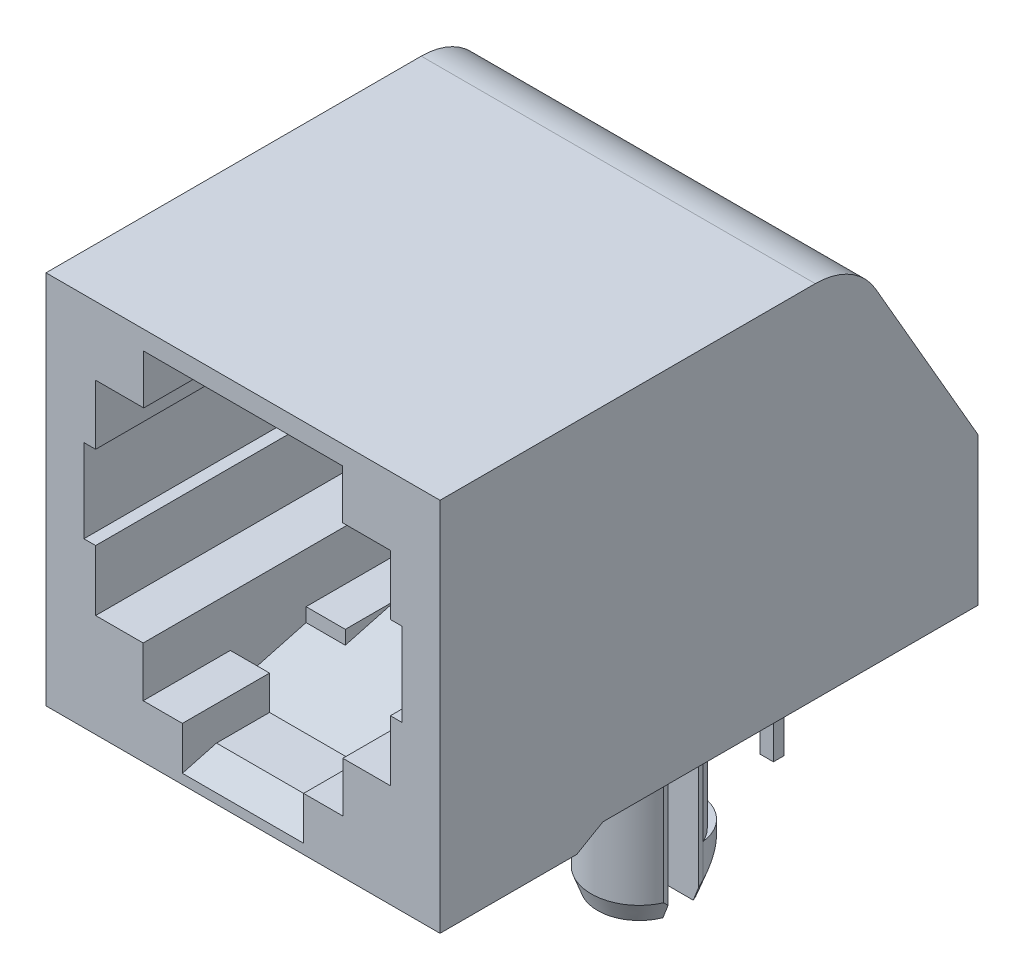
ISO-10303-21;
HEADER;
FILE_DESCRIPTION(('STEP AP214'),'2;1');
FILE_NAME('part.step','',(''),(''),'','','');
FILE_SCHEMA(('AUTOMOTIVE_DESIGN { 1 0 10303 214 1 1 1 1 }'));
ENDSEC;
DATA;
#1=APPLICATION_CONTEXT('core data for automotive mechanical design processes');
#2=APPLICATION_PROTOCOL_DEFINITION('international standard','automotive_design',2000,#1);
#3=PRODUCT_CONTEXT('',#1,'mechanical');
#4=PRODUCT('Part','Part','',(#3));
#5=PRODUCT_RELATED_PRODUCT_CATEGORY('part','',(#4));
#6=PRODUCT_DEFINITION_FORMATION('','',#4);
#7=PRODUCT_DEFINITION_CONTEXT('part definition',#1,'design');
#8=PRODUCT_DEFINITION('design','',#6,#7);
#9=PRODUCT_DEFINITION_SHAPE('','',#8);
#10=(LENGTH_UNIT() NAMED_UNIT(*) SI_UNIT(.MILLI.,.METRE.));
#11=(NAMED_UNIT(*) PLANE_ANGLE_UNIT() SI_UNIT($,.RADIAN.));
#12=(NAMED_UNIT(*) SI_UNIT($,.STERADIAN.) SOLID_ANGLE_UNIT());
#13=UNCERTAINTY_MEASURE_WITH_UNIT(LENGTH_MEASURE(1.E-05),#10,'distance_accuracy_value','');
#14=(GEOMETRIC_REPRESENTATION_CONTEXT(3) GLOBAL_UNCERTAINTY_ASSIGNED_CONTEXT((#13)) GLOBAL_UNIT_ASSIGNED_CONTEXT((#10,
#11,#12)) REPRESENTATION_CONTEXT('',''));
#15=CARTESIAN_POINT('',(0.,0.,0.));
#16=DIRECTION('',(0.,0.,1.));
#17=DIRECTION('',(1.,0.,0.));
#18=AXIS2_PLACEMENT_3D('',#15,#16,#17);
#19=CARTESIAN_POINT('',(-2.3114,6.5024,-12.7762));
#20=DIRECTION('',(0.,-0.889896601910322,0.456162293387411));
#21=DIRECTION('',(0.,-0.456162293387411,-0.889896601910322));
#22=AXIS2_PLACEMENT_3D('',#19,#20,#21);
#23=PLANE('',#22);
#24=DIRECTION('',(0.,0.456162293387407,0.889896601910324));
#25=VECTOR('',#24,1.);
#26=CARTESIAN_POINT('',(-2.3114,7.2836046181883,-11.2522));
#27=LINE('',#26,#25);
#28=CARTESIAN_POINT('',(-2.3114,7.2836046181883,-11.2522));
#29=VERTEX_POINT('',#28);
#30=CARTESIAN_POINT('',(-2.3114,10.287,-5.393076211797));
#31=VERTEX_POINT('',#30);
#32=EDGE_CURVE('E1353',#29,#31,#27,.T.);
#33=ORIENTED_EDGE('',*,*,#32,.T.);
#34=DIRECTION('',(1.,0.,0.));
#35=VECTOR('',#34,1.);
#36=CARTESIAN_POINT('',(-2.3114,10.287,-5.39307621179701));
#37=LINE('',#36,#35);
#38=CARTESIAN_POINT('',(-2.7686,10.287,-5.39307621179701));
#39=VERTEX_POINT('',#38);
#40=EDGE_CURVE('E1633',#31,#39,#37,.F.);
#41=ORIENTED_EDGE('',*,*,#40,.T.);
#42=DIRECTION('',(0.,0.456162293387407,0.889896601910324));
#43=VECTOR('',#42,1.);
#44=CARTESIAN_POINT('',(-2.7686,7.2836046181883,-11.2522));
#45=LINE('',#44,#43);
#46=CARTESIAN_POINT('',(-2.7686,7.2836046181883,-11.2522));
#47=VERTEX_POINT('',#46);
#48=EDGE_CURVE('E1349',#47,#39,#45,.T.);
#49=ORIENTED_EDGE('',*,*,#48,.F.);
#50=DIRECTION('',(1.,0.,0.));
#51=VECTOR('',#50,1.);
#52=CARTESIAN_POINT('',(-2.3114,7.2836046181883,-11.2522));
#53=LINE('',#52,#51);
#54=EDGE_CURVE('E1631',#47,#29,#53,.T.);
#55=ORIENTED_EDGE('',*,*,#54,.T.);
#56=EDGE_LOOP('',(#33,#41,#49,#55));
#57=FACE_BOUND('',#56,.T.);
#58=ADVANCED_FACE('F14',(#57),#23,.T.);
#59=CARTESIAN_POINT('',(-1.2954,6.5024,-12.7762));
#60=DIRECTION('',(0.,-0.889896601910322,0.456162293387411));
#61=DIRECTION('',(0.,-0.456162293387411,-0.889896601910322));
#62=AXIS2_PLACEMENT_3D('',#59,#60,#61);
#63=PLANE('',#62);
#64=DIRECTION('',(0.,0.456162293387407,0.889896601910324));
#65=VECTOR('',#64,1.);
#66=CARTESIAN_POINT('',(-1.2954,7.2836046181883,-11.2522));
#67=LINE('',#66,#65);
#68=CARTESIAN_POINT('',(-1.2954,7.2836046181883,-11.2522));
#69=VERTEX_POINT('',#68);
#70=CARTESIAN_POINT('',(-1.2954,10.287,-5.393076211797));
#71=VERTEX_POINT('',#70);
#72=EDGE_CURVE('E1339',#69,#71,#67,.T.);
#73=ORIENTED_EDGE('',*,*,#72,.T.);
#74=DIRECTION('',(1.,0.,0.));
#75=VECTOR('',#74,1.);
#76=CARTESIAN_POINT('',(-1.2954,10.287,-5.39307621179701));
#77=LINE('',#76,#75);
#78=CARTESIAN_POINT('',(-1.7526,10.287,-5.39307621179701));
#79=VERTEX_POINT('',#78);
#80=EDGE_CURVE('E2013',#71,#79,#77,.F.);
#81=ORIENTED_EDGE('',*,*,#80,.T.);
#82=DIRECTION('',(0.,0.456162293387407,0.889896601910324));
#83=VECTOR('',#82,1.);
#84=CARTESIAN_POINT('',(-1.7526,7.2836046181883,-11.2522));
#85=LINE('',#84,#83);
#86=CARTESIAN_POINT('',(-1.7526,7.2836046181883,-11.2522));
#87=VERTEX_POINT('',#86);
#88=EDGE_CURVE('E1335',#87,#79,#85,.T.);
#89=ORIENTED_EDGE('',*,*,#88,.F.);
#90=DIRECTION('',(1.,0.,0.));
#91=VECTOR('',#90,1.);
#92=CARTESIAN_POINT('',(-1.2954,7.2836046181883,-11.2522));
#93=LINE('',#92,#91);
#94=EDGE_CURVE('E2010',#87,#69,#93,.T.);
#95=ORIENTED_EDGE('',*,*,#94,.T.);
#96=EDGE_LOOP('',(#73,#81,#89,#95));
#97=FACE_BOUND('',#96,.T.);
#98=ADVANCED_FACE('F2119',(#97),#63,.T.);
#99=CARTESIAN_POINT('',(-0.2794,6.5024,-12.7762));
#100=DIRECTION('',(0.,-0.889896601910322,0.456162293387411));
#101=DIRECTION('',(0.,-0.456162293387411,-0.889896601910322));
#102=AXIS2_PLACEMENT_3D('',#99,#100,#101);
#103=PLANE('',#102);
#104=DIRECTION('',(0.,0.456162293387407,0.889896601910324));
#105=VECTOR('',#104,1.);
#106=CARTESIAN_POINT('',(-0.2794,7.2836046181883,-11.2522));
#107=LINE('',#106,#105);
#108=CARTESIAN_POINT('',(-0.2794,7.2836046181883,-11.2522));
#109=VERTEX_POINT('',#108);
#110=CARTESIAN_POINT('',(-0.2794,10.287,-5.393076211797));
#111=VERTEX_POINT('',#110);
#112=EDGE_CURVE('E1325',#109,#111,#107,.T.);
#113=ORIENTED_EDGE('',*,*,#112,.T.);
#114=DIRECTION('',(1.,0.,0.));
#115=VECTOR('',#114,1.);
#116=CARTESIAN_POINT('',(-0.2794,10.287,-5.39307621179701));
#117=LINE('',#116,#115);
#118=CARTESIAN_POINT('',(-0.7366,10.287,-5.39307621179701));
#119=VERTEX_POINT('',#118);
#120=EDGE_CURVE('E1397',#111,#119,#117,.F.);
#121=ORIENTED_EDGE('',*,*,#120,.T.);
#122=DIRECTION('',(0.,0.456162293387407,0.889896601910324));
#123=VECTOR('',#122,1.);
#124=CARTESIAN_POINT('',(-0.7366,7.2836046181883,-11.2522));
#125=LINE('',#124,#123);
#126=CARTESIAN_POINT('',(-0.7366,7.2836046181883,-11.2522));
#127=VERTEX_POINT('',#126);
#128=EDGE_CURVE('E1321',#127,#119,#125,.T.);
#129=ORIENTED_EDGE('',*,*,#128,.F.);
#130=DIRECTION('',(1.,0.,0.));
#131=VECTOR('',#130,1.);
#132=CARTESIAN_POINT('',(-0.2794,7.2836046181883,-11.2522));
#133=LINE('',#132,#131);
#134=EDGE_CURVE('E1400',#127,#109,#133,.T.);
#135=ORIENTED_EDGE('',*,*,#134,.T.);
#136=EDGE_LOOP('',(#113,#121,#129,#135));
#137=FACE_BOUND('',#136,.T.);
#138=ADVANCED_FACE('F2116',(#137),#103,.T.);
#139=CARTESIAN_POINT('',(0.7366,6.5024,-12.7762));
#140=DIRECTION('',(0.,-0.889896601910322,0.456162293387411));
#141=DIRECTION('',(0.,-0.456162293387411,-0.889896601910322));
#142=AXIS2_PLACEMENT_3D('',#139,#140,#141);
#143=PLANE('',#142);
#144=DIRECTION('',(0.,0.456162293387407,0.889896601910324));
#145=VECTOR('',#144,1.);
#146=CARTESIAN_POINT('',(0.7366,7.2836046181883,-11.2522));
#147=LINE('',#146,#145);
#148=CARTESIAN_POINT('',(0.7366,7.2836046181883,-11.2522));
#149=VERTEX_POINT('',#148);
#150=CARTESIAN_POINT('',(0.7366,10.287,-5.393076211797));
#151=VERTEX_POINT('',#150);
#152=EDGE_CURVE('E1311',#149,#151,#147,.T.);
#153=ORIENTED_EDGE('',*,*,#152,.T.);
#154=DIRECTION('',(1.,0.,0.));
#155=VECTOR('',#154,1.);
#156=CARTESIAN_POINT('',(0.7366,10.287,-5.39307621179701));
#157=LINE('',#156,#155);
#158=CARTESIAN_POINT('',(0.2794,10.287,-5.39307621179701));
#159=VERTEX_POINT('',#158);
#160=EDGE_CURVE('E2020',#151,#159,#157,.F.);
#161=ORIENTED_EDGE('',*,*,#160,.T.);
#162=DIRECTION('',(0.,0.456162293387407,0.889896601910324));
#163=VECTOR('',#162,1.);
#164=CARTESIAN_POINT('',(0.2794,7.2836046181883,-11.2522));
#165=LINE('',#164,#163);
#166=CARTESIAN_POINT('',(0.2794,7.2836046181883,-11.2522));
#167=VERTEX_POINT('',#166);
#168=EDGE_CURVE('E1307',#167,#159,#165,.T.);
#169=ORIENTED_EDGE('',*,*,#168,.F.);
#170=DIRECTION('',(1.,0.,0.));
#171=VECTOR('',#170,1.);
#172=CARTESIAN_POINT('',(0.7366,7.2836046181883,-11.2522));
#173=LINE('',#172,#171);
#174=EDGE_CURVE('E1399',#167,#149,#173,.T.);
#175=ORIENTED_EDGE('',*,*,#174,.T.);
#176=EDGE_LOOP('',(#153,#161,#169,#175));
#177=FACE_BOUND('',#176,.T.);
#178=ADVANCED_FACE('F2112',(#177),#143,.T.);
#179=CARTESIAN_POINT('',(1.7526,6.5024,-12.7762));
#180=DIRECTION('',(0.,-0.889896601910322,0.456162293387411));
#181=DIRECTION('',(0.,-0.456162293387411,-0.889896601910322));
#182=AXIS2_PLACEMENT_3D('',#179,#180,#181);
#183=PLANE('',#182);
#184=DIRECTION('',(0.,0.456162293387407,0.889896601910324));
#185=VECTOR('',#184,1.);
#186=CARTESIAN_POINT('',(1.7526,7.2836046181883,-11.2522));
#187=LINE('',#186,#185);
#188=CARTESIAN_POINT('',(1.7526,7.2836046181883,-11.2522));
#189=VERTEX_POINT('',#188);
#190=CARTESIAN_POINT('',(1.7526,10.287,-5.393076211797));
#191=VERTEX_POINT('',#190);
#192=EDGE_CURVE('E1297',#189,#191,#187,.T.);
#193=ORIENTED_EDGE('',*,*,#192,.T.);
#194=DIRECTION('',(1.,0.,0.));
#195=VECTOR('',#194,1.);
#196=CARTESIAN_POINT('',(1.7526,10.287,-5.39307621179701));
#197=LINE('',#196,#195);
#198=CARTESIAN_POINT('',(1.2954,10.287,-5.39307621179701));
#199=VERTEX_POINT('',#198);
#200=EDGE_CURVE('E1527',#191,#199,#197,.F.);
#201=ORIENTED_EDGE('',*,*,#200,.T.);
#202=DIRECTION('',(0.,0.456162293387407,0.889896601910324));
#203=VECTOR('',#202,1.);
#204=CARTESIAN_POINT('',(1.2954,7.2836046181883,-11.2522));
#205=LINE('',#204,#203);
#206=CARTESIAN_POINT('',(1.2954,7.2836046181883,-11.2522));
#207=VERTEX_POINT('',#206);
#208=EDGE_CURVE('E1293',#207,#199,#205,.T.);
#209=ORIENTED_EDGE('',*,*,#208,.F.);
#210=DIRECTION('',(1.,0.,0.));
#211=VECTOR('',#210,1.);
#212=CARTESIAN_POINT('',(1.7526,7.2836046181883,-11.2522));
#213=LINE('',#212,#211);
#214=EDGE_CURVE('E1579',#207,#189,#213,.T.);
#215=ORIENTED_EDGE('',*,*,#214,.T.);
#216=EDGE_LOOP('',(#193,#201,#209,#215));
#217=FACE_BOUND('',#216,.T.);
#218=ADVANCED_FACE('F2109',(#217),#183,.T.);
#219=CARTESIAN_POINT('',(2.7686,6.5024,-12.7762));
#220=DIRECTION('',(0.,-0.889896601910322,0.456162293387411));
#221=DIRECTION('',(0.,-0.456162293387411,-0.889896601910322));
#222=AXIS2_PLACEMENT_3D('',#219,#220,#221);
#223=PLANE('',#222);
#224=DIRECTION('',(0.,0.456162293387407,0.889896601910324));
#225=VECTOR('',#224,1.);
#226=CARTESIAN_POINT('',(2.7686,7.2836046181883,-11.2522));
#227=LINE('',#226,#225);
#228=CARTESIAN_POINT('',(2.7686,7.2836046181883,-11.2522));
#229=VERTEX_POINT('',#228);
#230=CARTESIAN_POINT('',(2.7686,10.287,-5.393076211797));
#231=VERTEX_POINT('',#230);
#232=EDGE_CURVE('E1283',#229,#231,#227,.T.);
#233=ORIENTED_EDGE('',*,*,#232,.T.);
#234=DIRECTION('',(1.,0.,0.));
#235=VECTOR('',#234,1.);
#236=CARTESIAN_POINT('',(2.7686,10.287,-5.39307621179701));
#237=LINE('',#236,#235);
#238=CARTESIAN_POINT('',(2.3114,10.287,-5.39307621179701));
#239=VERTEX_POINT('',#238);
#240=EDGE_CURVE('E1366',#231,#239,#237,.F.);
#241=ORIENTED_EDGE('',*,*,#240,.T.);
#242=DIRECTION('',(0.,0.456162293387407,0.889896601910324));
#243=VECTOR('',#242,1.);
#244=CARTESIAN_POINT('',(2.3114,7.2836046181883,-11.2522));
#245=LINE('',#244,#243);
#246=CARTESIAN_POINT('',(2.3114,7.2836046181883,-11.2522));
#247=VERTEX_POINT('',#246);
#248=EDGE_CURVE('E1279',#247,#239,#245,.T.);
#249=ORIENTED_EDGE('',*,*,#248,.F.);
#250=DIRECTION('',(1.,0.,0.));
#251=VECTOR('',#250,1.);
#252=CARTESIAN_POINT('',(2.7686,7.2836046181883,-11.2522));
#253=LINE('',#252,#251);
#254=EDGE_CURVE('E1526',#247,#229,#253,.T.);
#255=ORIENTED_EDGE('',*,*,#254,.T.);
#256=EDGE_LOOP('',(#233,#241,#249,#255));
#257=FACE_BOUND('',#256,.T.);
#258=ADVANCED_FACE('F2028',(#257),#223,.T.);
#259=CARTESIAN_POINT('',(-2.032,6.2865,0.));
#260=DIRECTION('',(-1.,0.,0.));
#261=DIRECTION('',(0.,0.,1.));
#262=AXIS2_PLACEMENT_3D('',#259,#260,#261);
#263=PLANE('',#262);
#264=DIRECTION('',(0.,0.,1.));
#265=VECTOR('',#264,1.);
#266=CARTESIAN_POINT('',(-2.032,1.778,0.));
#267=LINE('',#266,#265);
#268=CARTESIAN_POINT('',(-2.032,1.778,-5.461));
#269=VERTEX_POINT('',#268);
#270=CARTESIAN_POINT('',(-2.032,1.778,-7.18673407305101));
#271=VERTEX_POINT('',#270);
#272=EDGE_CURVE('E1363',#269,#271,#267,.F.);
#273=ORIENTED_EDGE('',*,*,#272,.F.);
#274=DIRECTION('',(0.,1.,0.));
#275=VECTOR('',#274,1.);
#276=CARTESIAN_POINT('',(-2.032,1.778,-5.461));
#277=LINE('',#276,#275);
#278=CARTESIAN_POINT('',(-2.032,1.31559094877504,-5.46099999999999));
#279=VERTEX_POINT('',#278);
#280=EDGE_CURVE('E1273',#269,#279,#277,.F.);
#281=ORIENTED_EDGE('',*,*,#280,.T.);
#282=DIRECTION('',(0.,0.258819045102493,-0.965925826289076));
#283=VECTOR('',#282,1.);
#284=CARTESIAN_POINT('',(-2.032,1.778,-7.186734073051));
#285=LINE('',#284,#283);
#286=EDGE_CURVE('E1182',#279,#271,#285,.T.);
#287=ORIENTED_EDGE('',*,*,#286,.T.);
#288=EDGE_LOOP('',(#273,#281,#287));
#289=FACE_BOUND('',#288,.T.);
#290=ADVANCED_FACE('F2102',(#289),#263,.F.);
#291=CARTESIAN_POINT('',(2.032,6.2865,0.));
#292=DIRECTION('',(-1.,0.,0.));
#293=DIRECTION('',(0.,0.,1.));
#294=AXIS2_PLACEMENT_3D('',#291,#292,#293);
#295=PLANE('',#294);
#296=DIRECTION('',(0.,0.258819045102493,-0.965925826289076));
#297=VECTOR('',#296,1.);
#298=CARTESIAN_POINT('',(2.032,1.778,-7.186734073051));
#299=LINE('',#298,#297);
#300=CARTESIAN_POINT('',(2.032,1.778,-7.18673407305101));
#301=VERTEX_POINT('',#300);
#302=CARTESIAN_POINT('',(2.032,1.31559094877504,-5.46099999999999));
#303=VERTEX_POINT('',#302);
#304=EDGE_CURVE('E1178',#301,#303,#299,.F.);
#305=ORIENTED_EDGE('',*,*,#304,.T.);
#306=DIRECTION('',(0.,1.,0.));
#307=VECTOR('',#306,1.);
#308=CARTESIAN_POINT('',(2.032,1.778,-5.461));
#309=LINE('',#308,#307);
#310=CARTESIAN_POINT('',(2.032,1.778,-5.461));
#311=VERTEX_POINT('',#310);
#312=EDGE_CURVE('E1264',#303,#311,#309,.T.);
#313=ORIENTED_EDGE('',*,*,#312,.T.);
#314=DIRECTION('',(0.,0.,1.));
#315=VECTOR('',#314,1.);
#316=CARTESIAN_POINT('',(2.032,1.778,0.));
#317=LINE('',#316,#315);
#318=EDGE_CURVE('E1360',#311,#301,#317,.F.);
#319=ORIENTED_EDGE('',*,*,#318,.T.);
#320=EDGE_LOOP('',(#305,#313,#319));
#321=FACE_BOUND('',#320,.T.);
#322=ADVANCED_FACE('F2098',(#321),#295,.T.);
#323=CARTESIAN_POINT('',(-2.3114,6.2865,0.));
#324=DIRECTION('',(-1.,0.,0.));
#325=DIRECTION('',(0.,0.,1.));
#326=AXIS2_PLACEMENT_3D('',#323,#324,#325);
#327=PLANE('',#326);
#328=DIRECTION('',(0.,1.,0.));
#329=VECTOR('',#328,1.);
#330=CARTESIAN_POINT('',(-2.3114,5.6134,-11.2522));
#331=LINE('',#330,#329);
#332=CARTESIAN_POINT('',(-2.3114,7.68320160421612,-11.2522000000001));
#333=VERTEX_POINT('',#332);
#334=EDGE_CURVE('E1163',#333,#29,#331,.F.);
#335=ORIENTED_EDGE('',*,*,#334,.F.);
#336=DIRECTION('',(0.,0.456162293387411,0.889896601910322));
#337=VECTOR('',#336,1.);
#338=CARTESIAN_POINT('',(-2.3114,10.795,-5.1816));
#339=LINE('',#338,#337);
#340=CARTESIAN_POINT('',(-2.3114,10.287,-6.17262332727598));
#341=VERTEX_POINT('',#340);
#342=EDGE_CURVE('E1125',#341,#333,#339,.F.);
#343=ORIENTED_EDGE('',*,*,#342,.F.);
#344=DIRECTION('',(0.,0.,1.));
#345=VECTOR('',#344,1.);
#346=CARTESIAN_POINT('',(-2.3114,10.287,0.));
#347=LINE('',#346,#345);
#348=EDGE_CURVE('E1357',#31,#341,#347,.F.);
#349=ORIENTED_EDGE('',*,*,#348,.F.);
#350=ORIENTED_EDGE('',*,*,#32,.F.);
#351=EDGE_LOOP('',(#335,#343,#349,#350));
#352=FACE_BOUND('',#351,.T.);
#353=ADVANCED_FACE('F2094',(#352),#327,.F.);
#354=CARTESIAN_POINT('',(-2.7686,6.2865,0.));
#355=DIRECTION('',(-1.,0.,0.));
#356=DIRECTION('',(0.,0.,1.));
#357=AXIS2_PLACEMENT_3D('',#354,#355,#356);
#358=PLANE('',#357);
#359=ORIENTED_EDGE('',*,*,#48,.T.);
#360=DIRECTION('',(0.,0.,1.));
#361=VECTOR('',#360,1.);
#362=CARTESIAN_POINT('',(-2.7686,10.287,0.));
#363=LINE('',#362,#361);
#364=CARTESIAN_POINT('',(-2.7686,10.287,-6.17262332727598));
#365=VERTEX_POINT('',#364);
#366=EDGE_CURVE('E1346',#39,#365,#363,.F.);
#367=ORIENTED_EDGE('',*,*,#366,.T.);
#368=DIRECTION('',(0.,0.456162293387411,0.889896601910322));
#369=VECTOR('',#368,1.);
#370=CARTESIAN_POINT('',(-2.7686,10.795,-5.1816));
#371=LINE('',#370,#369);
#372=CARTESIAN_POINT('',(-2.7686,7.68320160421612,-11.2522000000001));
#373=VERTEX_POINT('',#372);
#374=EDGE_CURVE('E1117',#373,#365,#371,.T.);
#375=ORIENTED_EDGE('',*,*,#374,.F.);
#376=DIRECTION('',(0.,1.,0.));
#377=VECTOR('',#376,1.);
#378=CARTESIAN_POINT('',(-2.7686,5.6134,-11.2522));
#379=LINE('',#378,#377);
#380=EDGE_CURVE('E1167',#47,#373,#379,.T.);
#381=ORIENTED_EDGE('',*,*,#380,.F.);
#382=EDGE_LOOP('',(#359,#367,#375,#381));
#383=FACE_BOUND('',#382,.T.);
#384=ADVANCED_FACE('F2090',(#383),#358,.T.);
#385=CARTESIAN_POINT('',(-1.2954,6.2865,0.));
#386=DIRECTION('',(-1.,0.,0.));
#387=DIRECTION('',(0.,0.,1.));
#388=AXIS2_PLACEMENT_3D('',#385,#386,#387);
#389=PLANE('',#388);
#390=DIRECTION('',(0.,1.,0.));
#391=VECTOR('',#390,1.);
#392=CARTESIAN_POINT('',(-1.2954,5.6134,-11.2522));
#393=LINE('',#392,#391);
#394=CARTESIAN_POINT('',(-1.2954,7.68320160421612,-11.2522000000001));
#395=VERTEX_POINT('',#394);
#396=EDGE_CURVE('E1156',#395,#69,#393,.F.);
#397=ORIENTED_EDGE('',*,*,#396,.F.);
#398=DIRECTION('',(0.,0.456162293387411,0.889896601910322));
#399=VECTOR('',#398,1.);
#400=CARTESIAN_POINT('',(-1.2954,10.795,-5.1816));
#401=LINE('',#400,#399);
#402=CARTESIAN_POINT('',(-1.2954,10.287,-6.17262332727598));
#403=VERTEX_POINT('',#402);
#404=EDGE_CURVE('E1114',#403,#395,#401,.F.);
#405=ORIENTED_EDGE('',*,*,#404,.F.);
#406=DIRECTION('',(0.,0.,1.));
#407=VECTOR('',#406,1.);
#408=CARTESIAN_POINT('',(-1.2954,10.287,0.));
#409=LINE('',#408,#407);
#410=EDGE_CURVE('E1343',#71,#403,#409,.F.);
#411=ORIENTED_EDGE('',*,*,#410,.F.);
#412=ORIENTED_EDGE('',*,*,#72,.F.);
#413=EDGE_LOOP('',(#397,#405,#411,#412));
#414=FACE_BOUND('',#413,.T.);
#415=ADVANCED_FACE('F2086',(#414),#389,.F.);
#416=CARTESIAN_POINT('',(-1.7526,6.2865,0.));
#417=DIRECTION('',(-1.,0.,0.));
#418=DIRECTION('',(0.,0.,1.));
#419=AXIS2_PLACEMENT_3D('',#416,#417,#418);
#420=PLANE('',#419);
#421=ORIENTED_EDGE('',*,*,#88,.T.);
#422=DIRECTION('',(0.,0.,1.));
#423=VECTOR('',#422,1.);
#424=CARTESIAN_POINT('',(-1.7526,10.287,0.));
#425=LINE('',#424,#423);
#426=CARTESIAN_POINT('',(-1.7526,10.287,-6.17262332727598));
#427=VERTEX_POINT('',#426);
#428=EDGE_CURVE('E1332',#79,#427,#425,.F.);
#429=ORIENTED_EDGE('',*,*,#428,.T.);
#430=DIRECTION('',(0.,0.456162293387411,0.889896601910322));
#431=VECTOR('',#430,1.);
#432=CARTESIAN_POINT('',(-1.7526,10.795,-5.1816));
#433=LINE('',#432,#431);
#434=CARTESIAN_POINT('',(-1.7526,7.68320160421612,-11.2522000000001));
#435=VERTEX_POINT('',#434);
#436=EDGE_CURVE('E1106',#435,#427,#433,.T.);
#437=ORIENTED_EDGE('',*,*,#436,.F.);
#438=DIRECTION('',(0.,1.,0.));
#439=VECTOR('',#438,1.);
#440=CARTESIAN_POINT('',(-1.7526,5.6134,-11.2522));
#441=LINE('',#440,#439);
#442=EDGE_CURVE('E1160',#87,#435,#441,.T.);
#443=ORIENTED_EDGE('',*,*,#442,.F.);
#444=EDGE_LOOP('',(#421,#429,#437,#443));
#445=FACE_BOUND('',#444,.T.);
#446=ADVANCED_FACE('F2082',(#445),#420,.T.);
#447=CARTESIAN_POINT('',(-0.2794,6.2865,0.));
#448=DIRECTION('',(-1.,0.,0.));
#449=DIRECTION('',(0.,0.,1.));
#450=AXIS2_PLACEMENT_3D('',#447,#448,#449);
#451=PLANE('',#450);
#452=DIRECTION('',(0.,1.,0.));
#453=VECTOR('',#452,1.);
#454=CARTESIAN_POINT('',(-0.2794,5.6134,-11.2522));
#455=LINE('',#454,#453);
#456=CARTESIAN_POINT('',(-0.2794,7.68320160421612,-11.2522000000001));
#457=VERTEX_POINT('',#456);
#458=EDGE_CURVE('E1149',#457,#109,#455,.F.);
#459=ORIENTED_EDGE('',*,*,#458,.F.);
#460=DIRECTION('',(0.,0.456162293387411,0.889896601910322));
#461=VECTOR('',#460,1.);
#462=CARTESIAN_POINT('',(-0.2794,10.795,-5.1816));
#463=LINE('',#462,#461);
#464=CARTESIAN_POINT('',(-0.2794,10.287,-6.17262332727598));
#465=VERTEX_POINT('',#464);
#466=EDGE_CURVE('E1103',#465,#457,#463,.F.);
#467=ORIENTED_EDGE('',*,*,#466,.F.);
#468=DIRECTION('',(0.,0.,1.));
#469=VECTOR('',#468,1.);
#470=CARTESIAN_POINT('',(-0.2794,10.287,0.));
#471=LINE('',#470,#469);
#472=EDGE_CURVE('E1329',#111,#465,#471,.F.);
#473=ORIENTED_EDGE('',*,*,#472,.F.);
#474=ORIENTED_EDGE('',*,*,#112,.F.);
#475=EDGE_LOOP('',(#459,#467,#473,#474));
#476=FACE_BOUND('',#475,.T.);
#477=ADVANCED_FACE('F2078',(#476),#451,.F.);
#478=CARTESIAN_POINT('',(-0.7366,6.2865,0.));
#479=DIRECTION('',(-1.,0.,0.));
#480=DIRECTION('',(0.,0.,1.));
#481=AXIS2_PLACEMENT_3D('',#478,#479,#480);
#482=PLANE('',#481);
#483=ORIENTED_EDGE('',*,*,#128,.T.);
#484=DIRECTION('',(0.,0.,1.));
#485=VECTOR('',#484,1.);
#486=CARTESIAN_POINT('',(-0.7366,10.287,0.));
#487=LINE('',#486,#485);
#488=CARTESIAN_POINT('',(-0.7366,10.287,-6.17262332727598));
#489=VERTEX_POINT('',#488);
#490=EDGE_CURVE('E1318',#119,#489,#487,.F.);
#491=ORIENTED_EDGE('',*,*,#490,.T.);
#492=DIRECTION('',(0.,0.456162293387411,0.889896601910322));
#493=VECTOR('',#492,1.);
#494=CARTESIAN_POINT('',(-0.7366,10.795,-5.1816));
#495=LINE('',#494,#493);
#496=CARTESIAN_POINT('',(-0.7366,7.68320160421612,-11.2522000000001));
#497=VERTEX_POINT('',#496);
#498=EDGE_CURVE('E1095',#497,#489,#495,.T.);
#499=ORIENTED_EDGE('',*,*,#498,.F.);
#500=DIRECTION('',(0.,1.,0.));
#501=VECTOR('',#500,1.);
#502=CARTESIAN_POINT('',(-0.7366,5.6134,-11.2522));
#503=LINE('',#502,#501);
#504=EDGE_CURVE('E1153',#127,#497,#503,.T.);
#505=ORIENTED_EDGE('',*,*,#504,.F.);
#506=EDGE_LOOP('',(#483,#491,#499,#505));
#507=FACE_BOUND('',#506,.T.);
#508=ADVANCED_FACE('F2074',(#507),#482,.T.);
#509=CARTESIAN_POINT('',(0.7366,6.2865,0.));
#510=DIRECTION('',(-1.,0.,0.));
#511=DIRECTION('',(0.,0.,1.));
#512=AXIS2_PLACEMENT_3D('',#509,#510,#511);
#513=PLANE('',#512);
#514=DIRECTION('',(0.,1.,0.));
#515=VECTOR('',#514,1.);
#516=CARTESIAN_POINT('',(0.7366,5.6134,-11.2522));
#517=LINE('',#516,#515);
#518=CARTESIAN_POINT('',(0.7366,7.68320160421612,-11.2522000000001));
#519=VERTEX_POINT('',#518);
#520=EDGE_CURVE('E1142',#519,#149,#517,.F.);
#521=ORIENTED_EDGE('',*,*,#520,.F.);
#522=DIRECTION('',(0.,0.456162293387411,0.889896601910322));
#523=VECTOR('',#522,1.);
#524=CARTESIAN_POINT('',(0.7366,10.795,-5.1816));
#525=LINE('',#524,#523);
#526=CARTESIAN_POINT('',(0.7366,10.287,-6.17262332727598));
#527=VERTEX_POINT('',#526);
#528=EDGE_CURVE('E1092',#527,#519,#525,.F.);
#529=ORIENTED_EDGE('',*,*,#528,.F.);
#530=DIRECTION('',(0.,0.,1.));
#531=VECTOR('',#530,1.);
#532=CARTESIAN_POINT('',(0.7366,10.287,0.));
#533=LINE('',#532,#531);
#534=EDGE_CURVE('E1315',#151,#527,#533,.F.);
#535=ORIENTED_EDGE('',*,*,#534,.F.);
#536=ORIENTED_EDGE('',*,*,#152,.F.);
#537=EDGE_LOOP('',(#521,#529,#535,#536));
#538=FACE_BOUND('',#537,.T.);
#539=ADVANCED_FACE('F2070',(#538),#513,.F.);
#540=CARTESIAN_POINT('',(0.2794,6.2865,0.));
#541=DIRECTION('',(-1.,0.,0.));
#542=DIRECTION('',(0.,0.,1.));
#543=AXIS2_PLACEMENT_3D('',#540,#541,#542);
#544=PLANE('',#543);
#545=ORIENTED_EDGE('',*,*,#168,.T.);
#546=DIRECTION('',(0.,0.,1.));
#547=VECTOR('',#546,1.);
#548=CARTESIAN_POINT('',(0.2794,10.287,0.));
#549=LINE('',#548,#547);
#550=CARTESIAN_POINT('',(0.2794,10.287,-6.17262332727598));
#551=VERTEX_POINT('',#550);
#552=EDGE_CURVE('E1304',#159,#551,#549,.F.);
#553=ORIENTED_EDGE('',*,*,#552,.T.);
#554=DIRECTION('',(0.,0.456162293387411,0.889896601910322));
#555=VECTOR('',#554,1.);
#556=CARTESIAN_POINT('',(0.2794,10.795,-5.1816));
#557=LINE('',#556,#555);
#558=CARTESIAN_POINT('',(0.2794,7.68320160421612,-11.2522000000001));
#559=VERTEX_POINT('',#558);
#560=EDGE_CURVE('E1084',#559,#551,#557,.T.);
#561=ORIENTED_EDGE('',*,*,#560,.F.);
#562=DIRECTION('',(0.,1.,0.));
#563=VECTOR('',#562,1.);
#564=CARTESIAN_POINT('',(0.2794,5.6134,-11.2522));
#565=LINE('',#564,#563);
#566=EDGE_CURVE('E1146',#167,#559,#565,.T.);
#567=ORIENTED_EDGE('',*,*,#566,.F.);
#568=EDGE_LOOP('',(#545,#553,#561,#567));
#569=FACE_BOUND('',#568,.T.);
#570=ADVANCED_FACE('F2066',(#569),#544,.T.);
#571=CARTESIAN_POINT('',(1.7526,6.2865,0.));
#572=DIRECTION('',(-1.,0.,0.));
#573=DIRECTION('',(0.,0.,1.));
#574=AXIS2_PLACEMENT_3D('',#571,#572,#573);
#575=PLANE('',#574);
#576=DIRECTION('',(0.,1.,0.));
#577=VECTOR('',#576,1.);
#578=CARTESIAN_POINT('',(1.7526,5.6134,-11.2522));
#579=LINE('',#578,#577);
#580=CARTESIAN_POINT('',(1.7526,7.68320160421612,-11.2522000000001));
#581=VERTEX_POINT('',#580);
#582=EDGE_CURVE('E1135',#581,#189,#579,.F.);
#583=ORIENTED_EDGE('',*,*,#582,.F.);
#584=DIRECTION('',(0.,0.456162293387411,0.889896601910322));
#585=VECTOR('',#584,1.);
#586=CARTESIAN_POINT('',(1.7526,10.795,-5.1816));
#587=LINE('',#586,#585);
#588=CARTESIAN_POINT('',(1.7526,10.287,-6.17262332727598));
#589=VERTEX_POINT('',#588);
#590=EDGE_CURVE('E1081',#589,#581,#587,.F.);
#591=ORIENTED_EDGE('',*,*,#590,.F.);
#592=DIRECTION('',(0.,0.,1.));
#593=VECTOR('',#592,1.);
#594=CARTESIAN_POINT('',(1.7526,10.287,0.));
#595=LINE('',#594,#593);
#596=EDGE_CURVE('E1301',#191,#589,#595,.F.);
#597=ORIENTED_EDGE('',*,*,#596,.F.);
#598=ORIENTED_EDGE('',*,*,#192,.F.);
#599=EDGE_LOOP('',(#583,#591,#597,#598));
#600=FACE_BOUND('',#599,.T.);
#601=ADVANCED_FACE('F2059',(#600),#575,.F.);
#602=CARTESIAN_POINT('',(1.2954,6.2865,0.));
#603=DIRECTION('',(-1.,0.,0.));
#604=DIRECTION('',(0.,0.,1.));
#605=AXIS2_PLACEMENT_3D('',#602,#603,#604);
#606=PLANE('',#605);
#607=ORIENTED_EDGE('',*,*,#208,.T.);
#608=DIRECTION('',(0.,0.,1.));
#609=VECTOR('',#608,1.);
#610=CARTESIAN_POINT('',(1.2954,10.287,0.));
#611=LINE('',#610,#609);
#612=CARTESIAN_POINT('',(1.2954,10.287,-6.17262332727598));
#613=VERTEX_POINT('',#612);
#614=EDGE_CURVE('E1290',#199,#613,#611,.F.);
#615=ORIENTED_EDGE('',*,*,#614,.T.);
#616=DIRECTION('',(0.,0.456162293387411,0.889896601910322));
#617=VECTOR('',#616,1.);
#618=CARTESIAN_POINT('',(1.2954,10.795,-5.1816));
#619=LINE('',#618,#617);
#620=CARTESIAN_POINT('',(1.2954,7.68320160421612,-11.2522000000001));
#621=VERTEX_POINT('',#620);
#622=EDGE_CURVE('E1073',#621,#613,#619,.T.);
#623=ORIENTED_EDGE('',*,*,#622,.F.);
#624=DIRECTION('',(0.,1.,0.));
#625=VECTOR('',#624,1.);
#626=CARTESIAN_POINT('',(1.2954,5.6134,-11.2522));
#627=LINE('',#626,#625);
#628=EDGE_CURVE('E1139',#207,#621,#627,.T.);
#629=ORIENTED_EDGE('',*,*,#628,.F.);
#630=EDGE_LOOP('',(#607,#615,#623,#629));
#631=FACE_BOUND('',#630,.T.);
#632=ADVANCED_FACE('F2050',(#631),#606,.T.);
#633=CARTESIAN_POINT('',(2.7686,6.2865,0.));
#634=DIRECTION('',(-1.,0.,0.));
#635=DIRECTION('',(0.,0.,1.));
#636=AXIS2_PLACEMENT_3D('',#633,#634,#635);
#637=PLANE('',#636);
#638=DIRECTION('',(0.,1.,0.));
#639=VECTOR('',#638,1.);
#640=CARTESIAN_POINT('',(2.7686,5.6134,-11.2522));
#641=LINE('',#640,#639);
#642=CARTESIAN_POINT('',(2.7686,7.68320160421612,-11.2522000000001));
#643=VERTEX_POINT('',#642);
#644=EDGE_CURVE('E1128',#643,#229,#641,.F.);
#645=ORIENTED_EDGE('',*,*,#644,.F.);
#646=DIRECTION('',(0.,0.456162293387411,0.889896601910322));
#647=VECTOR('',#646,1.);
#648=CARTESIAN_POINT('',(2.7686,10.795,-5.1816));
#649=LINE('',#648,#647);
#650=CARTESIAN_POINT('',(2.7686,10.287,-6.17262332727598));
#651=VERTEX_POINT('',#650);
#652=EDGE_CURVE('E1070',#651,#643,#649,.F.);
#653=ORIENTED_EDGE('',*,*,#652,.F.);
#654=DIRECTION('',(0.,0.,1.));
#655=VECTOR('',#654,1.);
#656=CARTESIAN_POINT('',(2.7686,10.287,0.));
#657=LINE('',#656,#655);
#658=EDGE_CURVE('E1287',#231,#651,#657,.F.);
#659=ORIENTED_EDGE('',*,*,#658,.F.);
#660=ORIENTED_EDGE('',*,*,#232,.F.);
#661=EDGE_LOOP('',(#645,#653,#659,#660));
#662=FACE_BOUND('',#661,.T.);
#663=ADVANCED_FACE('F2048',(#662),#637,.F.);
#664=CARTESIAN_POINT('',(2.3114,6.2865,0.));
#665=DIRECTION('',(-1.,0.,0.));
#666=DIRECTION('',(0.,0.,1.));
#667=AXIS2_PLACEMENT_3D('',#664,#665,#666);
#668=PLANE('',#667);
#669=ORIENTED_EDGE('',*,*,#248,.T.);
#670=DIRECTION('',(0.,0.,1.));
#671=VECTOR('',#670,1.);
#672=CARTESIAN_POINT('',(2.3114,10.287,0.));
#673=LINE('',#672,#671);
#674=CARTESIAN_POINT('',(2.3114,10.287,-6.17262332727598));
#675=VERTEX_POINT('',#674);
#676=EDGE_CURVE('E1276',#239,#675,#673,.F.);
#677=ORIENTED_EDGE('',*,*,#676,.T.);
#678=DIRECTION('',(0.,0.456162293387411,0.889896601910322));
#679=VECTOR('',#678,1.);
#680=CARTESIAN_POINT('',(2.3114,10.795,-5.1816));
#681=LINE('',#680,#679);
#682=CARTESIAN_POINT('',(2.3114,7.68320160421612,-11.2522000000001));
#683=VERTEX_POINT('',#682);
#684=EDGE_CURVE('E1062',#683,#675,#681,.T.);
#685=ORIENTED_EDGE('',*,*,#684,.F.);
#686=DIRECTION('',(0.,1.,0.));
#687=VECTOR('',#686,1.);
#688=CARTESIAN_POINT('',(2.3114,5.6134,-11.2522));
#689=LINE('',#688,#687);
#690=EDGE_CURVE('E1132',#247,#683,#689,.T.);
#691=ORIENTED_EDGE('',*,*,#690,.F.);
#692=EDGE_LOOP('',(#669,#677,#685,#691));
#693=FACE_BOUND('',#692,.T.);
#694=ADVANCED_FACE('F2034',(#693),#668,.T.);
#695=CARTESIAN_POINT('',(3.34645,1.778,-5.461));
#696=DIRECTION('',(0.,0.,-1.));
#697=DIRECTION('',(-1.,0.,0.));
#698=AXIS2_PLACEMENT_3D('',#695,#696,#697);
#699=PLANE('',#698);
#700=DIRECTION('',(1.,0.,0.));
#701=VECTOR('',#700,1.);
#702=CARTESIAN_POINT('',(2.032,1.31559094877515,-5.46099999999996));
#703=LINE('',#702,#701);
#704=CARTESIAN_POINT('',(-3.34645,1.31559094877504,-5.46099999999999));
#705=VERTEX_POINT('',#704);
#706=EDGE_CURVE('E1186',#705,#279,#703,.T.);
#707=ORIENTED_EDGE('',*,*,#706,.T.);
#708=ORIENTED_EDGE('',*,*,#280,.F.);
#709=DIRECTION('',(1.,0.,0.));
#710=VECTOR('',#709,1.);
#711=CARTESIAN_POINT('',(-3.34645,1.778,-5.461));
#712=LINE('',#711,#710);
#713=CARTESIAN_POINT('',(-3.34645,1.778,-5.461));
#714=VERTEX_POINT('',#713);
#715=EDGE_CURVE('E1058',#269,#714,#712,.F.);
#716=ORIENTED_EDGE('',*,*,#715,.T.);
#717=DIRECTION('',(0.,1.,0.));
#718=VECTOR('',#717,1.);
#719=CARTESIAN_POINT('',(-3.34645,1.778,-5.461));
#720=LINE('',#719,#718);
#721=EDGE_CURVE('E1270',#705,#714,#720,.T.);
#722=ORIENTED_EDGE('',*,*,#721,.F.);
#723=EDGE_LOOP('',(#707,#708,#716,#722));
#724=FACE_BOUND('',#723,.T.);
#725=ADVANCED_FACE('F2057',(#724),#699,.F.);
#726=CARTESIAN_POINT('',(3.34645,1.778,-5.461));
#727=DIRECTION('',(0.,0.,-1.));
#728=DIRECTION('',(-1.,0.,0.));
#729=AXIS2_PLACEMENT_3D('',#726,#727,#728);
#730=PLANE('',#729);
#731=DIRECTION('',(1.,0.,0.));
#732=VECTOR('',#731,1.);
#733=CARTESIAN_POINT('',(2.032,1.31559094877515,-5.46099999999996));
#734=LINE('',#733,#732);
#735=CARTESIAN_POINT('',(3.34645,1.31559094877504,-5.46099999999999));
#736=VERTEX_POINT('',#735);
#737=EDGE_CURVE('E1174',#303,#736,#734,.T.);
#738=ORIENTED_EDGE('',*,*,#737,.T.);
#739=DIRECTION('',(0.,1.,0.));
#740=VECTOR('',#739,1.);
#741=CARTESIAN_POINT('',(3.34645,1.778,-5.461));
#742=LINE('',#741,#740);
#743=CARTESIAN_POINT('',(3.34645,1.778,-5.461));
#744=VERTEX_POINT('',#743);
#745=EDGE_CURVE('E1268',#744,#736,#742,.F.);
#746=ORIENTED_EDGE('',*,*,#745,.F.);
#747=DIRECTION('',(1.,0.,0.));
#748=VECTOR('',#747,1.);
#749=CARTESIAN_POINT('',(-3.34645,1.778,-5.461));
#750=LINE('',#749,#748);
#751=EDGE_CURVE('E1054',#744,#311,#750,.F.);
#752=ORIENTED_EDGE('',*,*,#751,.T.);
#753=ORIENTED_EDGE('',*,*,#312,.F.);
#754=EDGE_LOOP('',(#738,#746,#752,#753));
#755=FACE_BOUND('',#754,.T.);
#756=ADVANCED_FACE('F2886',(#755),#730,.F.);
#757=CARTESIAN_POINT('',(-3.34645,1.778,0.));
#758=DIRECTION('',(0.,-1.,0.));
#759=DIRECTION('',(0.,0.,-1.));
#760=AXIS2_PLACEMENT_3D('',#757,#758,#759);
#761=PLANE('',#760);
#762=DIRECTION('',(1.,0.,0.));
#763=VECTOR('',#762,1.);
#764=CARTESIAN_POINT('',(-3.34645,1.778,0.));
#765=LINE('',#764,#763);
#766=CARTESIAN_POINT('',(3.34645,1.778,0.));
#767=VERTEX_POINT('',#766);
#768=CARTESIAN_POINT('',(2.032,1.778,0.));
#769=VERTEX_POINT('',#768);
#770=EDGE_CURVE('E1260',#767,#769,#765,.F.);
#771=ORIENTED_EDGE('',*,*,#770,.F.);
#772=DIRECTION('',(0.,0.,-1.));
#773=VECTOR('',#772,1.);
#774=CARTESIAN_POINT('',(3.34645,1.778,0.));
#775=LINE('',#774,#773);
#776=CARTESIAN_POINT('',(3.34645,1.778,-2.921));
#777=VERTEX_POINT('',#776);
#778=EDGE_CURVE('E1046',#767,#777,#775,.T.);
#779=ORIENTED_EDGE('',*,*,#778,.T.);
#780=DIRECTION('',(1.,0.,0.));
#781=VECTOR('',#780,1.);
#782=CARTESIAN_POINT('',(-3.34645,1.778,-2.921));
#783=LINE('',#782,#781);
#784=CARTESIAN_POINT('',(2.032,1.778,-2.921));
#785=VERTEX_POINT('',#784);
#786=EDGE_CURVE('E1256',#777,#785,#783,.F.);
#787=ORIENTED_EDGE('',*,*,#786,.T.);
#788=DIRECTION('',(0.,0.,1.));
#789=VECTOR('',#788,1.);
#790=CARTESIAN_POINT('',(2.032,1.778,0.));
#791=LINE('',#790,#789);
#792=EDGE_CURVE('E1211',#769,#785,#791,.F.);
#793=ORIENTED_EDGE('',*,*,#792,.F.);
#794=EDGE_LOOP('',(#771,#779,#787,#793));
#795=FACE_BOUND('',#794,.T.);
#796=ADVANCED_FACE('F2630',(#795),#761,.F.);
#797=CARTESIAN_POINT('',(-3.34645,1.778,-2.921));
#798=DIRECTION('',(0.,0.,1.));
#799=DIRECTION('',(1.,0.,0.));
#800=AXIS2_PLACEMENT_3D('',#797,#798,#799);
#801=PLANE('',#800);
#802=DIRECTION('',(1.,0.,0.));
#803=VECTOR('',#802,1.);
#804=CARTESIAN_POINT('',(2.032,0.635000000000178,-2.92099999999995));
#805=LINE('',#804,#803);
#806=CARTESIAN_POINT('',(3.34645,0.635000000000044,-2.92099999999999));
#807=VERTEX_POINT('',#806);
#808=CARTESIAN_POINT('',(2.032,0.635000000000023,-2.92099999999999));
#809=VERTEX_POINT('',#808);
#810=EDGE_CURVE('E1170',#807,#809,#805,.F.);
#811=ORIENTED_EDGE('',*,*,#810,.T.);
#812=DIRECTION('',(0.,1.,0.));
#813=VECTOR('',#812,1.);
#814=CARTESIAN_POINT('',(2.032,6.2865,-2.921));
#815=LINE('',#814,#813);
#816=EDGE_CURVE('E1209',#785,#809,#815,.F.);
#817=ORIENTED_EDGE('',*,*,#816,.F.);
#818=ORIENTED_EDGE('',*,*,#786,.F.);
#819=DIRECTION('',(0.,1.,0.));
#820=VECTOR('',#819,1.);
#821=CARTESIAN_POINT('',(3.34645,1.778,-2.921));
#822=LINE('',#821,#820);
#823=EDGE_CURVE('E1042',#777,#807,#822,.F.);
#824=ORIENTED_EDGE('',*,*,#823,.T.);
#825=EDGE_LOOP('',(#811,#817,#818,#824));
#826=FACE_BOUND('',#825,.T.);
#827=ADVANCED_FACE('F2868',(#826),#801,.F.);
#828=CARTESIAN_POINT('',(-3.34645,1.778,-2.921));
#829=DIRECTION('',(0.,0.,1.));
#830=DIRECTION('',(1.,0.,0.));
#831=AXIS2_PLACEMENT_3D('',#828,#829,#830);
#832=PLANE('',#831);
#833=DIRECTION('',(1.,0.,0.));
#834=VECTOR('',#833,1.);
#835=CARTESIAN_POINT('',(2.032,0.635000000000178,-2.92099999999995));
#836=LINE('',#835,#834);
#837=CARTESIAN_POINT('',(-2.032,0.635000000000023,-2.92099999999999));
#838=VERTEX_POINT('',#837);
#839=CARTESIAN_POINT('',(-3.34645,0.635000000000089,-2.92099999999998));
#840=VERTEX_POINT('',#839);
#841=EDGE_CURVE('E1190',#838,#840,#836,.F.);
#842=ORIENTED_EDGE('',*,*,#841,.T.);
#843=DIRECTION('',(0.,1.,0.));
#844=VECTOR('',#843,1.);
#845=CARTESIAN_POINT('',(-3.34645,3.4544,-2.921));
#846=LINE('',#845,#844);
#847=CARTESIAN_POINT('',(-3.34645,1.778,-2.921));
#848=VERTEX_POINT('',#847);
#849=EDGE_CURVE('E1001',#840,#848,#846,.T.);
#850=ORIENTED_EDGE('',*,*,#849,.T.);
#851=DIRECTION('',(1.,0.,0.));
#852=VECTOR('',#851,1.);
#853=CARTESIAN_POINT('',(-3.34645,1.778,-2.921));
#854=LINE('',#853,#852);
#855=CARTESIAN_POINT('',(-2.032,1.778,-2.921));
#856=VERTEX_POINT('',#855);
#857=EDGE_CURVE('E1252',#848,#856,#854,.T.);
#858=ORIENTED_EDGE('',*,*,#857,.T.);
#859=DIRECTION('',(0.,1.,0.));
#860=VECTOR('',#859,1.);
#861=CARTESIAN_POINT('',(-2.032,6.2865,-2.921));
#862=LINE('',#861,#860);
#863=EDGE_CURVE('E1205',#856,#838,#862,.F.);
#864=ORIENTED_EDGE('',*,*,#863,.T.);
#865=EDGE_LOOP('',(#842,#850,#858,#864));
#866=FACE_BOUND('',#865,.T.);
#867=ADVANCED_FACE('F2651',(#866),#832,.F.);
#868=CARTESIAN_POINT('',(-3.34645,1.778,0.));
#869=DIRECTION('',(0.,-1.,0.));
#870=DIRECTION('',(0.,0.,-1.));
#871=AXIS2_PLACEMENT_3D('',#868,#869,#870);
#872=PLANE('',#871);
#873=DIRECTION('',(1.,0.,0.));
#874=VECTOR('',#873,1.);
#875=CARTESIAN_POINT('',(-3.34645,1.778,0.));
#876=LINE('',#875,#874);
#877=CARTESIAN_POINT('',(-2.032,1.778,0.));
#878=VERTEX_POINT('',#877);
#879=CARTESIAN_POINT('',(-3.34645,1.778,0.));
#880=VERTEX_POINT('',#879);
#881=EDGE_CURVE('E1249',#878,#880,#876,.F.);
#882=ORIENTED_EDGE('',*,*,#881,.F.);
#883=DIRECTION('',(0.,0.,1.));
#884=VECTOR('',#883,1.);
#885=CARTESIAN_POINT('',(-2.032,1.778,0.));
#886=LINE('',#885,#884);
#887=EDGE_CURVE('E1193',#878,#856,#886,.F.);
#888=ORIENTED_EDGE('',*,*,#887,.T.);
#889=ORIENTED_EDGE('',*,*,#857,.F.);
#890=DIRECTION('',(0.,0.,1.));
#891=VECTOR('',#890,1.);
#892=CARTESIAN_POINT('',(-3.34645,1.778,0.));
#893=LINE('',#892,#891);
#894=EDGE_CURVE('E997',#848,#880,#893,.T.);
#895=ORIENTED_EDGE('',*,*,#894,.T.);
#896=EDGE_LOOP('',(#882,#888,#889,#895));
#897=FACE_BOUND('',#896,.T.);
#898=ADVANCED_FACE('F2643',(#897),#872,.F.);
#899=CARTESIAN_POINT('',(5.08,-1.71831,-8.7122));
#900=DIRECTION('',(0.,-1.,0.));
#901=DIRECTION('',(0.,0.,-1.));
#902=AXIS2_PLACEMENT_3D('',#899,#900,#901);
#903=CYLINDRICAL_SURFACE('',#902,1.4732);
#904=DIRECTION('',(0.,-1.,0.));
#905=VECTOR('',#904,1.);
#906=CARTESIAN_POINT('',(6.54331915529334,-1.71831,-8.88253875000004));
#907=LINE('',#906,#905);
#908=CARTESIAN_POINT('',(6.54331915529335,-1.8034,-8.88253875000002));
#909=VERTEX_POINT('',#908);
#910=CARTESIAN_POINT('',(6.54331915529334,-2.9120196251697,-8.88253875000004));
#911=VERTEX_POINT('',#910);
#912=EDGE_CURVE('E652',#909,#911,#907,.T.);
#913=ORIENTED_EDGE('',*,*,#912,.T.);
#914=CARTESIAN_POINT('',(3.61668084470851,-2.91201962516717,-8.88253875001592));
#915=CARTESIAN_POINT('',(3.62780870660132,-2.82898819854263,-8.97839252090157));
#916=CARTESIAN_POINT('',(3.64868688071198,-2.74758291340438,-9.07525872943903));
#917=CARTESIAN_POINT('',(3.71169495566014,-2.58990343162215,-9.26751579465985));
#918=CARTESIAN_POINT('',(3.75399473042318,-2.51367586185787,-9.36288847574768));
#919=CARTESIAN_POINT('',(3.84760139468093,-2.38823281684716,-9.52322384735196));
#920=CARTESIAN_POINT('',(3.89376747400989,-2.33712276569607,-9.58968311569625));
#921=CARTESIAN_POINT('',(3.99889399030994,-2.24104443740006,-9.71632499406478));
#922=CARTESIAN_POINT('',(4.0578093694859,-2.1960554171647,-9.77652863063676));
#923=CARTESIAN_POINT('',(4.17763528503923,-2.12038359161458,-9.87891415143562));
#924=CARTESIAN_POINT('',(4.23667773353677,-2.0885638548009,-9.9224356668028));
#925=CARTESIAN_POINT('',(4.36292978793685,-2.0313579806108,-10.0012538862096));
#926=CARTESIAN_POINT('',(4.43014122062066,-2.00597328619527,-10.0365487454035));
#927=CARTESIAN_POINT('',(4.57176479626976,-1.96263645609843,-10.0971115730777));
#928=CARTESIAN_POINT('',(4.64621978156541,-1.94473233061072,-10.1223147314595));
#929=CARTESIAN_POINT('',(4.79967817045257,-1.91757779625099,-10.1606393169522));
#930=CARTESIAN_POINT('',(4.87867790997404,-1.90832051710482,-10.1737703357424));
#931=CARTESIAN_POINT('',(5.02892646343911,-1.89954900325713,-10.1862138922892));
#932=CARTESIAN_POINT('',(5.10000113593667,-1.89902185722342,-10.1869630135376));
#933=CARTESIAN_POINT('',(5.24119489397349,-1.90515500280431,-10.1782601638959));
#934=CARTESIAN_POINT('',(5.31131421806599,-1.91181346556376,-10.1688107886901));
#935=CARTESIAN_POINT('',(5.44584506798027,-1.93159690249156,-10.1408414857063));
#936=CARTESIAN_POINT('',(5.51037248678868,-1.94446118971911,-10.1226873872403));
#937=CARTESIAN_POINT('',(5.63511224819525,-1.9759965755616,-10.0784179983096));
#938=CARTESIAN_POINT('',(5.69532386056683,-1.99466865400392,-10.0523013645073));
#939=CARTESIAN_POINT('',(5.8141878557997,-2.03859188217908,-9.99127981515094));
#940=CARTESIAN_POINT('',(5.87246359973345,-2.0642008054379,-9.95590229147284));
#941=CARTESIAN_POINT('',(5.98201315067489,-2.12043566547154,-9.87889632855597));
#942=CARTESIAN_POINT('',(6.03328413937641,-2.15106361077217,-9.83726538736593));
#943=CARTESIAN_POINT('',(6.13533478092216,-2.22128630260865,-9.74278095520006));
#944=CARTESIAN_POINT('',(6.18496354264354,-2.26153729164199,-9.68917557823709));
#945=CARTESIAN_POINT('',(6.27442969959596,-2.3464980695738,-9.57752290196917));
#946=CARTESIAN_POINT('',(6.31425951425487,-2.39121127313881,-9.51947220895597));
#947=CARTESIAN_POINT('',(6.39118119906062,-2.49327434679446,-9.38890409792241));
#948=CARTESIAN_POINT('',(6.42621904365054,-2.55138667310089,-9.31577555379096));
#949=CARTESIAN_POINT('',(6.48326324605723,-2.6713923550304,-9.167690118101));
#950=CARTESIAN_POINT('',(6.50527263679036,-2.73328482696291,-9.09273365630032));
#951=CARTESIAN_POINT('',(6.53073222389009,-2.83458590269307,-8.97261206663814));
#952=CARTESIAN_POINT('',(6.53808380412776,-2.87310727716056,-8.92749886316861));
#953=CARTESIAN_POINT('',(6.54331915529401,-2.91201962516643,-8.88253875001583));
#954=B_SPLINE_CURVE_WITH_KNOTS('',3,(#914,#915,#916,#917,#918,#919,#920,#921,#922,#923,#924,
#925,#926,#927,#928,#929,#930,#931,#932,#933,#934,#935,#936,#937,#938,#939,#940,#941,#942,#943,
#944,#945,#946,#947,#948,#949,#950,#951,#952,#953),.UNSPECIFIED.,.F.,.F.,(4,2,2,2,2,2,2,2,2,2,2,
2,2,2,2,2,2,2,2,4),(0.,0.382436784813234,0.767954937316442,1.0539927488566,1.33903570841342,
1.57791932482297,1.81685645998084,2.05730437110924,2.29756107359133,2.50971731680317,
2.7218195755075,2.92569948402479,3.12961380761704,3.34723017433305,3.56493384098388,
3.81422826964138,4.06371495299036,4.36192792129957,4.6600714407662,4.83920087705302),.UNSPECIFIED.);
#955=CARTESIAN_POINT('',(3.61668084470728,-2.9120196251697,-8.88253875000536));
#956=VERTEX_POINT('',#955);
#957=EDGE_CURVE('E619',#956,#911,#954,.T.);
#958=ORIENTED_EDGE('',*,*,#957,.F.);
#959=DIRECTION('',(0.,-1.,0.));
#960=VECTOR('',#959,1.);
#961=CARTESIAN_POINT('',(3.61668084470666,-1.71831,-8.88253875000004));
#962=LINE('',#961,#960);
#963=CARTESIAN_POINT('',(3.61668084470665,-1.8034,-8.88253875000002));
#964=VERTEX_POINT('',#963);
#965=EDGE_CURVE('E1246',#956,#964,#962,.F.);
#966=ORIENTED_EDGE('',*,*,#965,.T.);
#967=CARTESIAN_POINT('',(5.08,-1.8034,-8.7122));
#968=DIRECTION('',(0.,-1.,0.));
#969=DIRECTION('',(0.,0.,-1.));
#970=AXIS2_PLACEMENT_3D('',#967,#968,#969);
#971=CIRCLE('',#970,1.4732);
#972=EDGE_CURVE('E996',#964,#909,#971,.T.);
#973=ORIENTED_EDGE('',*,*,#972,.T.);
#974=EDGE_LOOP('',(#913,#958,#966,#973));
#975=FACE_BOUND('',#974,.T.);
#976=ADVANCED_FACE('F632',(#975),#903,.T.);
#977=CARTESIAN_POINT('',(5.08,-1.8904905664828,-8.2042));
#978=DIRECTION('',(0.,1.,0.));
#979=DIRECTION('',(0.,0.,1.));
#980=AXIS2_PLACEMENT_3D('',#977,#978,#979);
#981=CONICAL_SURFACE('',#980,1.98470617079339,0.349065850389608);
#982=CARTESIAN_POINT('',(5.08,-2.9120196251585,-8.2042));
#983=DIRECTION('',(0.,1.,0.));
#984=DIRECTION('',(0.,0.,1.));
#985=AXIS2_PLACEMENT_3D('',#982,#983,#984);
#986=CIRCLE('',#985,1.61290000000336);
#987=CARTESIAN_POINT('',(3.60679999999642,-2.91201962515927,-8.8608035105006));
#988=VERTEX_POINT('',#987);
#989=EDGE_CURVE('E613',#988,#956,#986,.F.);
#990=ORIENTED_EDGE('',*,*,#989,.T.);
#991=ORIENTED_EDGE('',*,*,#957,.T.);
#992=CARTESIAN_POINT('',(5.08,-2.9120196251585,-8.2042));
#993=DIRECTION('',(0.,1.,0.));
#994=DIRECTION('',(0.,0.,1.));
#995=AXIS2_PLACEMENT_3D('',#992,#993,#994);
#996=CIRCLE('',#995,1.61290000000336);
#997=CARTESIAN_POINT('',(6.55320000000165,-2.91201962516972,-8.86080351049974));
#998=VERTEX_POINT('',#997);
#999=EDGE_CURVE('E574',#911,#998,#996,.F.);
#1000=ORIENTED_EDGE('',*,*,#999,.T.);
#1001=CARTESIAN_POINT('',(6.55320000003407,-3.06195841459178,-8.71220000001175));
#1002=CARTESIAN_POINT('',(6.55320011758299,-3.05641010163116,-8.71839425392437));
#1003=CARTESIAN_POINT('',(6.55320017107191,-3.050811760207,-8.72454354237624));
#1004=CARTESIAN_POINT('',(6.55320020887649,-3.03943078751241,-8.73685319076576));
#1005=CARTESIAN_POINT('',(6.55320019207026,-3.03364664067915,-8.74301214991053));
#1006=CARTESIAN_POINT('',(6.55320014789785,-3.02189411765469,-8.75534232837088));
#1007=CARTESIAN_POINT('',(6.553200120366,-3.01592427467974,-8.76151214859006));
#1008=CARTESIAN_POINT('',(6.55320008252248,-3.00380028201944,-8.77386520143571));
#1009=CARTESIAN_POINT('',(6.5532000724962,-2.99764471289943,-8.78004704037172));
#1010=CARTESIAN_POINT('',(6.55320007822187,-2.98514922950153,-8.79242525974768));
#1011=CARTESIAN_POINT('',(6.55320009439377,-2.97880794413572,-8.79862025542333));
#1012=CARTESIAN_POINT('',(6.55320013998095,-2.9659409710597,-8.81102588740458));
#1013=CARTESIAN_POINT('',(6.55320016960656,-2.95941396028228,-8.8172351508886));
#1014=CARTESIAN_POINT('',(6.55320021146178,-2.94617551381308,-8.82967040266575));
#1015=CARTESIAN_POINT('',(6.55320022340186,-2.9394628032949,-8.83589503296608));
#1016=CARTESIAN_POINT('',(6.55320017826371,-2.9258528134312,-8.84836203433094));
#1017=CARTESIAN_POINT('',(6.55320012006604,-2.91895430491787,-8.85460306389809));
#1018=CARTESIAN_POINT('',(6.55320000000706,-2.91201962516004,-8.86080351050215));
#1019=B_SPLINE_CURVE_WITH_KNOTS('',3,(#1001,#1002,#1003,#1004,#1005,#1006,#1007,#1008,#1009,
#1010,#1011,#1012,#1013,#1014,#1015,#1016,#1017,#1018),.UNSPECIFIED.,.F.,.F.,(4,2,2,2,2,2,2,2,
4),(0.,0.0249469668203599,0.0502935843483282,0.0760482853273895,0.102219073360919,
0.128813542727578,0.155838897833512,0.183301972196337,0.211209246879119),.UNSPECIFIED.);
#1020=CARTESIAN_POINT('',(6.55320000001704,-3.06195841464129,-8.71220000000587));
#1021=VERTEX_POINT('',#1020);
#1022=EDGE_CURVE('E577',#998,#1021,#1019,.F.);
#1023=ORIENTED_EDGE('',*,*,#1022,.T.);
#1024=CARTESIAN_POINT('',(6.5532000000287,-3.06195841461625,-8.7122));
#1025=CARTESIAN_POINT('',(6.5247433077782,-3.13590289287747,-8.7122));
#1026=CARTESIAN_POINT('',(6.49619519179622,-3.20981192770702,-8.7122));
#1027=CARTESIAN_POINT('',(6.43891610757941,-3.35755912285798,-8.7122));
#1028=CARTESIAN_POINT('',(6.410185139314,-3.43139728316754,-8.7122));
#1029=CARTESIAN_POINT('',(6.38136274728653,-3.50520000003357,-8.7122));
#1030=B_SPLINE_CURVE_WITH_KNOTS('',3,(#1024,#1025,#1026,#1027,#1028,#1029),.UNSPECIFIED.,.F.,
.F.,(4,2,4),(0.,0.237692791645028,0.475385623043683),.UNSPECIFIED.);
#1031=CARTESIAN_POINT('',(6.38136274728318,-3.50520000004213,-8.7122));
#1032=VERTEX_POINT('',#1031);
#1033=EDGE_CURVE('E17',#1021,#1032,#1030,.T.);
#1034=ORIENTED_EDGE('',*,*,#1033,.T.);
#1035=CARTESIAN_POINT('',(5.08,-3.5052000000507,-8.2042));
#1036=DIRECTION('',(0.,1.,0.));
#1037=DIRECTION('',(0.,0.,1.));
#1038=AXIS2_PLACEMENT_3D('',#1035,#1036,#1037);
#1039=CIRCLE('',#1038,1.39700000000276);
#1040=CARTESIAN_POINT('',(3.77863725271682,-3.50520000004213,-8.7122));
#1041=VERTEX_POINT('',#1040);
#1042=EDGE_CURVE('E989',#1041,#1032,#1039,.F.);
#1043=ORIENTED_EDGE('',*,*,#1042,.F.);
#1044=CARTESIAN_POINT('',(3.77863725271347,-3.50520000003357,-8.7122));
#1045=CARTESIAN_POINT('',(3.74981487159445,-3.43139731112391,-8.7122));
#1046=CARTESIAN_POINT('',(3.72108391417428,-3.35755917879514,-8.7122));
#1047=CARTESIAN_POINT('',(3.66380485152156,-3.20981203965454,-8.7122));
#1048=CARTESIAN_POINT('',(3.63525674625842,-3.13590303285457,-8.7122));
#1049=CARTESIAN_POINT('',(3.60680006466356,-3.06195858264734,-8.7122));
#1050=B_SPLINE_CURVE_WITH_KNOTS('',3,(#1044,#1045,#1046,#1047,#1048,#1049),.UNSPECIFIED.,.F.,
.F.,(4,2,4),(0.,0.237692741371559,0.475385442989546),.UNSPECIFIED.);
#1051=CARTESIAN_POINT('',(3.60680003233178,-3.06195849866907,-8.7122));
#1052=VERTEX_POINT('',#1051);
#1053=EDGE_CURVE('E603',#1041,#1052,#1050,.T.);
#1054=ORIENTED_EDGE('',*,*,#1053,.T.);
#1055=CARTESIAN_POINT('',(3.60679999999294,-2.91201962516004,-8.86080351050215));
#1056=CARTESIAN_POINT('',(3.60679987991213,-2.91895430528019,-8.85460306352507));
#1057=CARTESIAN_POINT('',(3.60679982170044,-2.92585281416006,-8.84836203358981));
#1058=CARTESIAN_POINT('',(3.60679977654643,-2.93946280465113,-8.83589503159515));
#1059=CARTESIAN_POINT('',(3.60679978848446,-2.94617551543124,-8.8296704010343));
#1060=CARTESIAN_POINT('',(3.6067998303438,-2.95941396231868,-8.81723514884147));
#1061=CARTESIAN_POINT('',(3.60679985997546,-2.96594097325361,-8.81102588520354));
#1062=CARTESIAN_POINT('',(3.60679990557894,-2.97880794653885,-8.79862025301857));
#1063=CARTESIAN_POINT('',(3.60679992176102,-2.98514923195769,-8.79242525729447));
#1064=CARTESIAN_POINT('',(3.60679992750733,-2.99764471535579,-8.7800470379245));
#1065=CARTESIAN_POINT('',(3.6067999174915,-3.00380028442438,-8.77386519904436));
#1066=CARTESIAN_POINT('',(3.60679987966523,-3.01592427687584,-8.76151214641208));
#1067=CARTESIAN_POINT('',(3.60679985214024,-3.0218941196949,-8.75534232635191));
#1068=CARTESIAN_POINT('',(3.60679980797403,-3.03364664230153,-8.74301214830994));
#1069=CARTESIAN_POINT('',(3.60679979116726,-3.03943078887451,-8.73685318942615));
#1070=CARTESIAN_POINT('',(3.60679982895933,-3.0508117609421,-8.72454354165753));
#1071=CARTESIAN_POINT('',(3.60679988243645,-3.05641010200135,-8.71839425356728));
#1072=CARTESIAN_POINT('',(3.60679999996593,-3.06195841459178,-8.71220000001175));
#1073=B_SPLINE_CURVE_WITH_KNOTS('',3,(#1055,#1056,#1057,#1058,#1059,#1060,#1061,#1062,#1063,
#1064,#1065,#1066,#1067,#1068,#1069,#1070,#1071,#1072),.UNSPECIFIED.,.F.,.F.,(4,2,2,2,2,2,2,2,
4),(0.,0.0279072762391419,0.0553703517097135,0.0823957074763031,0.108990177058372,
0.135160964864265,0.160915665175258,0.186262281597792,0.211209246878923),.UNSPECIFIED.);
#1074=EDGE_CURVE('E608',#1052,#988,#1073,.F.);
#1075=ORIENTED_EDGE('',*,*,#1074,.T.);
#1076=EDGE_LOOP('',(#990,#991,#1000,#1023,#1034,#1043,#1054,#1075));
#1077=FACE_BOUND('',#1076,.T.);
#1078=ADVANCED_FACE('F579',(#1077),#981,.T.);
#1079=CARTESIAN_POINT('',(-5.08,-1.71831,-8.7122));
#1080=DIRECTION('',(0.,-1.,0.));
#1081=DIRECTION('',(0.,0.,-1.));
#1082=AXIS2_PLACEMENT_3D('',#1079,#1080,#1081);
#1083=CYLINDRICAL_SURFACE('',#1082,1.4732);
#1084=DIRECTION('',(0.,-1.,0.));
#1085=VECTOR('',#1084,1.);
#1086=CARTESIAN_POINT('',(-3.61668084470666,-1.71831,-8.88253875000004));
#1087=LINE('',#1086,#1085);
#1088=CARTESIAN_POINT('',(-3.61668084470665,-1.8034,-8.88253875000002));
#1089=VERTEX_POINT('',#1088);
#1090=CARTESIAN_POINT('',(-3.61668084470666,-2.9120196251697,-8.88253875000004));
#1091=VERTEX_POINT('',#1090);
#1092=EDGE_CURVE('E1238',#1089,#1091,#1087,.T.);
#1093=ORIENTED_EDGE('',*,*,#1092,.T.);
#1094=CARTESIAN_POINT('',(-6.5433191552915,-2.91201962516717,-8.88253875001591));
#1095=CARTESIAN_POINT('',(-6.53219129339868,-2.82898819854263,-8.97839252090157));
#1096=CARTESIAN_POINT('',(-6.51131311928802,-2.74758291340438,-9.07525872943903));
#1097=CARTESIAN_POINT('',(-6.44830504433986,-2.58990343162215,-9.26751579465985));
#1098=CARTESIAN_POINT('',(-6.40600526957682,-2.51367586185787,-9.36288847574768));
#1099=CARTESIAN_POINT('',(-6.31239860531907,-2.38823281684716,-9.52322384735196));
#1100=CARTESIAN_POINT('',(-6.26623252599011,-2.33712276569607,-9.58968311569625));
#1101=CARTESIAN_POINT('',(-6.16110600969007,-2.24104443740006,-9.71632499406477));
#1102=CARTESIAN_POINT('',(-6.1021906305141,-2.1960554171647,-9.77652863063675));
#1103=CARTESIAN_POINT('',(-5.98236471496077,-2.12038359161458,-9.87891415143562));
#1104=CARTESIAN_POINT('',(-5.92332226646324,-2.0885638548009,-9.9224356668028));
#1105=CARTESIAN_POINT('',(-5.79707021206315,-2.0313579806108,-10.0012538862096));
#1106=CARTESIAN_POINT('',(-5.72985877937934,-2.00597328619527,-10.0365487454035));
#1107=CARTESIAN_POINT('',(-5.58823520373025,-1.96263645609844,-10.0971115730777));
#1108=CARTESIAN_POINT('',(-5.51378021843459,-1.94473233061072,-10.1223147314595));
#1109=CARTESIAN_POINT('',(-5.36032182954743,-1.91757779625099,-10.1606393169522));
#1110=CARTESIAN_POINT('',(-5.28132209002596,-1.90832051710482,-10.1737703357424));
#1111=CARTESIAN_POINT('',(-5.1310735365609,-1.89954900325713,-10.1862138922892));
#1112=CARTESIAN_POINT('',(-5.05999886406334,-1.89902185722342,-10.1869630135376));
#1113=CARTESIAN_POINT('',(-4.91880510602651,-1.90515500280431,-10.1782601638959));
#1114=CARTESIAN_POINT('',(-4.84868578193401,-1.91181346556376,-10.1688107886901));
#1115=CARTESIAN_POINT('',(-4.71415493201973,-1.93159690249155,-10.1408414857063));
#1116=CARTESIAN_POINT('',(-4.64962751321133,-1.94446118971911,-10.1226873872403));
#1117=CARTESIAN_POINT('',(-4.52488775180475,-1.9759965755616,-10.0784179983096));
#1118=CARTESIAN_POINT('',(-4.46467613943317,-1.99466865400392,-10.0523013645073));
#1119=CARTESIAN_POINT('',(-4.34581214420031,-2.03859188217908,-9.99127981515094));
#1120=CARTESIAN_POINT('',(-4.28753640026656,-2.0642008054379,-9.95590229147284));
#1121=CARTESIAN_POINT('',(-4.17798684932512,-2.12043566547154,-9.87889632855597));
#1122=CARTESIAN_POINT('',(-4.12671586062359,-2.15106361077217,-9.83726538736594));
#1123=CARTESIAN_POINT('',(-4.02466521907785,-2.22128630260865,-9.74278095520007));
#1124=CARTESIAN_POINT('',(-3.97503645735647,-2.26153729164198,-9.68917557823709));
#1125=CARTESIAN_POINT('',(-3.88557030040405,-2.3464980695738,-9.57752290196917));
#1126=CARTESIAN_POINT('',(-3.84574048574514,-2.39121127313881,-9.51947220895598));
#1127=CARTESIAN_POINT('',(-3.76881880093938,-2.49327434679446,-9.38890409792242));
#1128=CARTESIAN_POINT('',(-3.73378095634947,-2.55138667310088,-9.31577555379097));
#1129=CARTESIAN_POINT('',(-3.67673675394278,-2.67139235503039,-9.16769011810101));
#1130=CARTESIAN_POINT('',(-3.65472736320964,-2.73328482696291,-9.09273365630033));
#1131=CARTESIAN_POINT('',(-3.62926777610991,-2.83458590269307,-8.97261206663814));
#1132=CARTESIAN_POINT('',(-3.62191619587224,-2.87310727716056,-8.92749886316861));
#1133=CARTESIAN_POINT('',(-3.61668084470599,-2.91201962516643,-8.88253875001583));
#1134=B_SPLINE_CURVE_WITH_KNOTS('',3,(#1094,#1095,#1096,#1097,#1098,#1099,#1100,#1101,#1102,
#1103,#1104,#1105,#1106,#1107,#1108,#1109,#1110,#1111,#1112,#1113,#1114,#1115,#1116,#1117,#1118,
#1119,#1120,#1121,#1122,#1123,#1124,#1125,#1126,#1127,#1128,#1129,#1130,#1131,#1132,#1133),
.UNSPECIFIED.,.F.,.F.,(4,2,2,2,2,2,2,2,2,2,2,2,2,2,2,2,2,2,2,4),(0.,0.382436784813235,
0.767954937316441,1.0539927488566,1.33903570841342,1.57791932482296,1.81685645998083,
2.05730437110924,2.29756107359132,2.50971731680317,2.72181957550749,2.92569948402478,
3.12961380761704,3.34723017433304,3.56493384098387,3.81422826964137,4.06371495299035,
4.36192792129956,4.66007144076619,4.83920087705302),.UNSPECIFIED.);
#1135=CARTESIAN_POINT('',(-6.54331915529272,-2.9120196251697,-8.88253875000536));
#1136=VERTEX_POINT('',#1135);
#1137=EDGE_CURVE('E680',#1136,#1091,#1134,.T.);
#1138=ORIENTED_EDGE('',*,*,#1137,.F.);
#1139=DIRECTION('',(0.,-1.,0.));
#1140=VECTOR('',#1139,1.);
#1141=CARTESIAN_POINT('',(-6.54331915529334,-1.71831,-8.88253875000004));
#1142=LINE('',#1141,#1140);
#1143=CARTESIAN_POINT('',(-6.54331915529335,-1.8034,-8.88253875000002));
#1144=VERTEX_POINT('',#1143);
#1145=EDGE_CURVE('E1241',#1136,#1144,#1142,.F.);
#1146=ORIENTED_EDGE('',*,*,#1145,.T.);
#1147=CARTESIAN_POINT('',(-5.08,-1.8034,-8.7122));
#1148=DIRECTION('',(0.,-1.,0.));
#1149=DIRECTION('',(0.,0.,-1.));
#1150=AXIS2_PLACEMENT_3D('',#1147,#1148,#1149);
#1151=CIRCLE('',#1150,1.4732);
#1152=EDGE_CURVE('E978',#1144,#1089,#1151,.T.);
#1153=ORIENTED_EDGE('',*,*,#1152,.T.);
#1154=EDGE_LOOP('',(#1093,#1138,#1146,#1153));
#1155=FACE_BOUND('',#1154,.T.);
#1156=ADVANCED_FACE('F631',(#1155),#1083,.T.);
#1157=CARTESIAN_POINT('',(-5.08,-1.8904905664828,-8.2042));
#1158=DIRECTION('',(0.,1.,0.));
#1159=DIRECTION('',(0.,0.,1.));
#1160=AXIS2_PLACEMENT_3D('',#1157,#1158,#1159);
#1161=CONICAL_SURFACE('',#1160,1.98470617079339,0.349065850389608);
#1162=CARTESIAN_POINT('',(-5.08,-2.9120196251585,-8.2042));
#1163=DIRECTION('',(0.,1.,0.));
#1164=DIRECTION('',(0.,0.,1.));
#1165=AXIS2_PLACEMENT_3D('',#1162,#1163,#1164);
#1166=CIRCLE('',#1165,1.61290000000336);
#1167=CARTESIAN_POINT('',(-6.55320000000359,-2.91201962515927,-8.8608035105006));
#1168=VERTEX_POINT('',#1167);
#1169=EDGE_CURVE('E1367',#1168,#1136,#1166,.F.);
#1170=ORIENTED_EDGE('',*,*,#1169,.T.);
#1171=ORIENTED_EDGE('',*,*,#1137,.T.);
#1172=CARTESIAN_POINT('',(-5.08,-2.9120196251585,-8.2042));
#1173=DIRECTION('',(0.,1.,0.));
#1174=DIRECTION('',(0.,0.,1.));
#1175=AXIS2_PLACEMENT_3D('',#1172,#1173,#1174);
#1176=CIRCLE('',#1175,1.61290000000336);
#1177=CARTESIAN_POINT('',(-3.60679999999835,-2.91201962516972,-8.86080351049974));
#1178=VERTEX_POINT('',#1177);
#1179=EDGE_CURVE('E659',#1091,#1178,#1176,.F.);
#1180=ORIENTED_EDGE('',*,*,#1179,.T.);
#1181=CARTESIAN_POINT('',(-3.60679999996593,-3.06195841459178,-8.71220000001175));
#1182=CARTESIAN_POINT('',(-3.60679988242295,-3.05641010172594,-8.71839425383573));
#1183=CARTESIAN_POINT('',(-3.60679982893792,-3.05081176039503,-8.72454354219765));
#1184=CARTESIAN_POINT('',(-3.6067997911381,-3.03943078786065,-8.73685319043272));
#1185=CARTESIAN_POINT('',(-3.60679980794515,-3.0336466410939,-8.74301214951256));
#1186=CARTESIAN_POINT('',(-3.60679985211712,-3.0218941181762,-8.75534232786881));
#1187=CARTESIAN_POINT('',(-3.60679987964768,-3.01592427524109,-8.76151214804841));
#1188=CARTESIAN_POINT('',(-3.60679991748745,-3.00380028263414,-8.77386520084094));
#1189=CARTESIAN_POINT('',(-3.60679992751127,-2.99764471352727,-8.78004703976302));
#1190=CARTESIAN_POINT('',(-3.60679992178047,-2.98514923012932,-8.79242525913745));
#1191=CARTESIAN_POINT('',(-3.6067999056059,-2.97880794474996,-8.79862025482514));
#1192=CARTESIAN_POINT('',(-3.60679986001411,-2.96594097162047,-8.81102588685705));
#1193=CARTESIAN_POINT('',(-3.60679983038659,-2.9594139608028,-8.81723515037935));
#1194=CARTESIAN_POINT('',(-3.60679978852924,-2.94617551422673,-8.82967040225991));
#1195=CARTESIAN_POINT('',(-3.60679977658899,-2.93946280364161,-8.83589503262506));
#1196=CARTESIAN_POINT('',(-3.60679982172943,-2.9258528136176,-8.84836203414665));
#1197=CARTESIAN_POINT('',(-3.60679987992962,-2.91895430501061,-8.85460306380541));
#1198=CARTESIAN_POINT('',(-3.60679999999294,-2.91201962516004,-8.86080351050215));
#1199=B_SPLINE_CURVE_WITH_KNOTS('',3,(#1181,#1182,#1183,#1184,#1185,#1186,#1187,#1188,#1189,
#1190,#1191,#1192,#1193,#1194,#1195,#1196,#1197,#1198),.UNSPECIFIED.,.F.,.F.,(4,2,2,2,2,2,2,2,
4),(0.,0.0249469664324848,0.0502935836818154,0.0760482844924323,0.102219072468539,
0.128813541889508,0.155838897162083,0.183301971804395,0.211209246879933),.UNSPECIFIED.);
#1200=CARTESIAN_POINT('',(-3.60679999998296,-3.06195841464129,-8.71220000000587));
#1201=VERTEX_POINT('',#1200);
#1202=EDGE_CURVE('E655',#1178,#1201,#1199,.F.);
#1203=ORIENTED_EDGE('',*,*,#1202,.T.);
#1204=CARTESIAN_POINT('',(-3.6067999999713,-3.06195841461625,-8.7122));
#1205=CARTESIAN_POINT('',(-3.6352566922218,-3.13590289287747,-8.7122));
#1206=CARTESIAN_POINT('',(-3.66380480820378,-3.20981192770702,-8.7122));
#1207=CARTESIAN_POINT('',(-3.72108389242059,-3.35755912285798,-8.7122));
#1208=CARTESIAN_POINT('',(-3.749814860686,-3.43139728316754,-8.7122));
#1209=CARTESIAN_POINT('',(-3.77863725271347,-3.50520000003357,-8.7122));
#1210=B_SPLINE_CURVE_WITH_KNOTS('',3,(#1204,#1205,#1206,#1207,#1208,#1209),.UNSPECIFIED.,.F.,
.F.,(4,2,4),(0.,0.237692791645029,0.475385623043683),.UNSPECIFIED.);
#1211=CARTESIAN_POINT('',(-3.77863725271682,-3.50520000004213,-8.7122));
#1212=VERTEX_POINT('',#1211);
#1213=EDGE_CURVE('E658',#1201,#1212,#1210,.T.);
#1214=ORIENTED_EDGE('',*,*,#1213,.T.);
#1215=CARTESIAN_POINT('',(-5.08,-3.5052000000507,-8.2042));
#1216=DIRECTION('',(0.,1.,0.));
#1217=DIRECTION('',(0.,0.,1.));
#1218=AXIS2_PLACEMENT_3D('',#1215,#1216,#1217);
#1219=CIRCLE('',#1218,1.39700000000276);
#1220=CARTESIAN_POINT('',(-6.38136274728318,-3.50520000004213,-8.7122));
#1221=VERTEX_POINT('',#1220);
#1222=EDGE_CURVE('E971',#1221,#1212,#1219,.F.);
#1223=ORIENTED_EDGE('',*,*,#1222,.F.);
#1224=CARTESIAN_POINT('',(-6.38136274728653,-3.50520000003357,-8.7122));
#1225=CARTESIAN_POINT('',(-6.41018512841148,-3.43139731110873,-8.7122));
#1226=CARTESIAN_POINT('',(-6.43891608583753,-3.35755917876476,-8.7122));
#1227=CARTESIAN_POINT('',(-6.49619514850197,-3.20981203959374,-8.7122));
#1228=CARTESIAN_POINT('',(-6.52474325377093,-3.13590303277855,-8.7122));
#1229=CARTESIAN_POINT('',(-6.55319993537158,-3.06195858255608,-8.7122));
#1230=B_SPLINE_CURVE_WITH_KNOTS('',3,(#1224,#1225,#1226,#1227,#1228,#1229),.UNSPECIFIED.,.F.,
.F.,(4,2,4),(0.,0.237692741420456,0.47538544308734),.UNSPECIFIED.);
#1231=CARTESIAN_POINT('',(-6.55319996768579,-3.06195849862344,-8.7122));
#1232=VERTEX_POINT('',#1231);
#1233=EDGE_CURVE('E686',#1221,#1232,#1230,.T.);
#1234=ORIENTED_EDGE('',*,*,#1233,.T.);
#1235=CARTESIAN_POINT('',(-6.55320000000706,-2.91201962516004,-8.86080351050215));
#1236=CARTESIAN_POINT('',(-6.55320012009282,-2.91895430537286,-8.85460306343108));
#1237=CARTESIAN_POINT('',(-6.55320017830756,-2.92585281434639,-8.848362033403));
#1238=CARTESIAN_POINT('',(-6.55320022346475,-2.93946280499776,-8.83589503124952));
#1239=CARTESIAN_POINT('',(-6.55320021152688,-2.94617551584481,-8.82967040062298));
#1240=CARTESIAN_POINT('',(-6.55320016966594,-2.95941396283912,-8.81723514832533));
#1241=CARTESIAN_POINT('',(-6.55320014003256,-2.96594097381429,-8.81102588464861));
#1242=CARTESIAN_POINT('',(-6.5532000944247,-2.978807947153,-8.79862025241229));
#1243=CARTESIAN_POINT('',(-6.55320007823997,-2.98514923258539,-8.79242525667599));
#1244=CARTESIAN_POINT('',(-6.55320007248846,-2.99764471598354,-8.78004703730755));
#1245=CARTESIAN_POINT('',(-6.55320008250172,-3.00380028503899,-8.77386519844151));
#1246=CARTESIAN_POINT('',(-6.55320012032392,-3.01592427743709,-8.76151214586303));
#1247=CARTESIAN_POINT('',(-6.55320014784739,-3.02189412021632,-8.75534232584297));
#1248=CARTESIAN_POINT('',(-6.55320019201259,-3.03364664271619,-8.7430121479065));
#1249=CARTESIAN_POINT('',(-6.55320020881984,-3.03943078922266,-8.73685318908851));
#1250=CARTESIAN_POINT('',(-6.55320017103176,-3.05081176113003,-8.72454354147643));
#1251=CARTESIAN_POINT('',(-6.55320011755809,-3.05641010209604,-8.71839425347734));
#1252=CARTESIAN_POINT('',(-6.55320000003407,-3.06195841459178,-8.71220000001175));
#1253=B_SPLINE_CURVE_WITH_KNOTS('',3,(#1235,#1236,#1237,#1238,#1239,#1240,#1241,#1242,#1243,
#1244,#1245,#1246,#1247,#1248,#1249,#1250,#1251,#1252),.UNSPECIFIED.,.F.,.F.,(4,2,2,2,2,2,2,2,
4),(0.,0.0279072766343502,0.0553703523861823,0.0823957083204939,0.108990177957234,
0.135160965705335,0.160915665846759,0.186262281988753,0.211209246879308),.UNSPECIFIED.);
#1254=EDGE_CURVE('E660',#1232,#1168,#1253,.F.);
#1255=ORIENTED_EDGE('',*,*,#1254,.T.);
#1256=EDGE_LOOP('',(#1170,#1171,#1180,#1203,#1214,#1223,#1234,#1255));
#1257=FACE_BOUND('',#1256,.T.);
#1258=ADVANCED_FACE('F663',(#1257),#1161,.T.);
#1259=CARTESIAN_POINT('',(-2.9464,-3.81,-16.9164));
#1260=DIRECTION('',(0.,0.,1.));
#1261=DIRECTION('',(1.,0.,0.));
#1262=AXIS2_PLACEMENT_3D('',#1259,#1260,#1261);
#1263=PLANE('',#1262);
#1264=DIRECTION('',(0.,1.,0.));
#1265=VECTOR('',#1264,1.);
#1266=CARTESIAN_POINT('',(-2.9464,-3.81,-16.9164));
#1267=LINE('',#1266,#1265);
#1268=CARTESIAN_POINT('',(-2.9464,0.508,-16.9164));
#1269=VERTEX_POINT('',#1268);
#1270=CARTESIAN_POINT('',(-2.9464,-3.81,-16.9164));
#1271=VERTEX_POINT('',#1270);
#1272=EDGE_CURVE('E887',#1269,#1271,#1267,.F.);
#1273=ORIENTED_EDGE('',*,*,#1272,.F.);
#1274=DIRECTION('',(1.,0.,0.));
#1275=VECTOR('',#1274,1.);
#1276=CARTESIAN_POINT('',(-2.9464,0.508,-16.9164));
#1277=LINE('',#1276,#1275);
#1278=CARTESIAN_POINT('',(-3.4036,0.508,-16.9164));
#1279=VERTEX_POINT('',#1278);
#1280=EDGE_CURVE('E1235',#1269,#1279,#1277,.F.);
#1281=ORIENTED_EDGE('',*,*,#1280,.T.);
#1282=DIRECTION('',(0.,1.,0.));
#1283=VECTOR('',#1282,1.);
#1284=CARTESIAN_POINT('',(-3.4036,-3.81,-16.9164));
#1285=LINE('',#1284,#1283);
#1286=CARTESIAN_POINT('',(-3.4036,-3.81,-16.9164));
#1287=VERTEX_POINT('',#1286);
#1288=EDGE_CURVE('E1506',#1287,#1279,#1285,.T.);
#1289=ORIENTED_EDGE('',*,*,#1288,.F.);
#1290=DIRECTION('',(1.,0.,0.));
#1291=VECTOR('',#1290,1.);
#1292=CARTESIAN_POINT('',(0.,-3.81,-16.9164));
#1293=LINE('',#1292,#1291);
#1294=EDGE_CURVE('E1465',#1271,#1287,#1293,.F.);
#1295=ORIENTED_EDGE('',*,*,#1294,.F.);
#1296=EDGE_LOOP('',(#1273,#1281,#1289,#1295));
#1297=FACE_BOUND('',#1296,.T.);
#1298=ADVANCED_FACE('F672',(#1297),#1263,.T.);
#1299=CARTESIAN_POINT('',(-1.6764,-3.81,-14.3764));
#1300=DIRECTION('',(0.,0.,1.));
#1301=DIRECTION('',(1.,0.,0.));
#1302=AXIS2_PLACEMENT_3D('',#1299,#1300,#1301);
#1303=PLANE('',#1302);
#1304=DIRECTION('',(0.,1.,0.));
#1305=VECTOR('',#1304,1.);
#1306=CARTESIAN_POINT('',(-1.6764,-3.81,-14.3764));
#1307=LINE('',#1306,#1305);
#1308=CARTESIAN_POINT('',(-1.6764,0.508,-14.3764));
#1309=VERTEX_POINT('',#1308);
#1310=CARTESIAN_POINT('',(-1.6764,-3.81,-14.3764));
#1311=VERTEX_POINT('',#1310);
#1312=EDGE_CURVE('E1505',#1309,#1311,#1307,.F.);
#1313=ORIENTED_EDGE('',*,*,#1312,.F.);
#1314=DIRECTION('',(1.,0.,0.));
#1315=VECTOR('',#1314,1.);
#1316=CARTESIAN_POINT('',(-1.6764,0.508,-14.3764));
#1317=LINE('',#1316,#1315);
#1318=CARTESIAN_POINT('',(-2.1336,0.508,-14.3764));
#1319=VERTEX_POINT('',#1318);
#1320=EDGE_CURVE('E1232',#1309,#1319,#1317,.F.);
#1321=ORIENTED_EDGE('',*,*,#1320,.T.);
#1322=DIRECTION('',(0.,1.,0.));
#1323=VECTOR('',#1322,1.);
#1324=CARTESIAN_POINT('',(-2.1336,-3.81,-14.3764));
#1325=LINE('',#1324,#1323);
#1326=CARTESIAN_POINT('',(-2.1336,-3.81,-14.3764));
#1327=VERTEX_POINT('',#1326);
#1328=EDGE_CURVE('E1570',#1327,#1319,#1325,.T.);
#1329=ORIENTED_EDGE('',*,*,#1328,.F.);
#1330=DIRECTION('',(1.,0.,0.));
#1331=VECTOR('',#1330,1.);
#1332=CARTESIAN_POINT('',(0.,-3.81,-14.3764));
#1333=LINE('',#1332,#1331);
#1334=EDGE_CURVE('E1676',#1311,#1327,#1333,.F.);
#1335=ORIENTED_EDGE('',*,*,#1334,.F.);
#1336=EDGE_LOOP('',(#1313,#1321,#1329,#1335));
#1337=FACE_BOUND('',#1336,.T.);
#1338=ADVANCED_FACE('F2811',(#1337),#1303,.T.);
#1339=CARTESIAN_POINT('',(-0.4064,-3.81,-16.9164));
#1340=DIRECTION('',(0.,0.,1.));
#1341=DIRECTION('',(1.,0.,0.));
#1342=AXIS2_PLACEMENT_3D('',#1339,#1340,#1341);
#1343=PLANE('',#1342);
#1344=DIRECTION('',(0.,1.,0.));
#1345=VECTOR('',#1344,1.);
#1346=CARTESIAN_POINT('',(-0.4064,-3.81,-16.9164));
#1347=LINE('',#1346,#1345);
#1348=CARTESIAN_POINT('',(-0.4064,0.508,-16.9164));
#1349=VERTEX_POINT('',#1348);
#1350=CARTESIAN_POINT('',(-0.4064,-3.81,-16.9164));
#1351=VERTEX_POINT('',#1350);
#1352=EDGE_CURVE('E1901',#1349,#1351,#1347,.F.);
#1353=ORIENTED_EDGE('',*,*,#1352,.F.);
#1354=DIRECTION('',(1.,0.,0.));
#1355=VECTOR('',#1354,1.);
#1356=CARTESIAN_POINT('',(-0.4064,0.508,-16.9164));
#1357=LINE('',#1356,#1355);
#1358=CARTESIAN_POINT('',(-0.8636,0.508,-16.9164));
#1359=VERTEX_POINT('',#1358);
#1360=EDGE_CURVE('E1229',#1349,#1359,#1357,.F.);
#1361=ORIENTED_EDGE('',*,*,#1360,.T.);
#1362=DIRECTION('',(0.,1.,0.));
#1363=VECTOR('',#1362,1.);
#1364=CARTESIAN_POINT('',(-0.8636,-3.81,-16.9164));
#1365=LINE('',#1364,#1363);
#1366=CARTESIAN_POINT('',(-0.8636,-3.81,-16.9164));
#1367=VERTEX_POINT('',#1366);
#1368=EDGE_CURVE('E1887',#1367,#1359,#1365,.T.);
#1369=ORIENTED_EDGE('',*,*,#1368,.F.);
#1370=DIRECTION('',(1.,0.,0.));
#1371=VECTOR('',#1370,1.);
#1372=CARTESIAN_POINT('',(2.54,-3.81,-16.9164));
#1373=LINE('',#1372,#1371);
#1374=EDGE_CURVE('E1460',#1351,#1367,#1373,.F.);
#1375=ORIENTED_EDGE('',*,*,#1374,.F.);
#1376=EDGE_LOOP('',(#1353,#1361,#1369,#1375));
#1377=FACE_BOUND('',#1376,.T.);
#1378=ADVANCED_FACE('F2489',(#1377),#1343,.T.);
#1379=CARTESIAN_POINT('',(0.8636,-3.81,-14.3764));
#1380=DIRECTION('',(0.,0.,1.));
#1381=DIRECTION('',(1.,0.,0.));
#1382=AXIS2_PLACEMENT_3D('',#1379,#1380,#1381);
#1383=PLANE('',#1382);
#1384=DIRECTION('',(0.,1.,0.));
#1385=VECTOR('',#1384,1.);
#1386=CARTESIAN_POINT('',(0.8636,-3.81,-14.3764));
#1387=LINE('',#1386,#1385);
#1388=CARTESIAN_POINT('',(0.8636,0.508,-14.3764));
#1389=VERTEX_POINT('',#1388);
#1390=CARTESIAN_POINT('',(0.8636,-3.81,-14.3764));
#1391=VERTEX_POINT('',#1390);
#1392=EDGE_CURVE('E1880',#1389,#1391,#1387,.F.);
#1393=ORIENTED_EDGE('',*,*,#1392,.F.);
#1394=DIRECTION('',(1.,0.,0.));
#1395=VECTOR('',#1394,1.);
#1396=CARTESIAN_POINT('',(0.8636,0.508,-14.3764));
#1397=LINE('',#1396,#1395);
#1398=CARTESIAN_POINT('',(0.4064,0.508,-14.3764));
#1399=VERTEX_POINT('',#1398);
#1400=EDGE_CURVE('E1226',#1389,#1399,#1397,.F.);
#1401=ORIENTED_EDGE('',*,*,#1400,.T.);
#1402=DIRECTION('',(0.,1.,0.));
#1403=VECTOR('',#1402,1.);
#1404=CARTESIAN_POINT('',(0.4064,-3.81,-14.3764));
#1405=LINE('',#1404,#1403);
#1406=CARTESIAN_POINT('',(0.4064,-3.81,-14.3764));
#1407=VERTEX_POINT('',#1406);
#1408=EDGE_CURVE('E1672',#1407,#1399,#1405,.T.);
#1409=ORIENTED_EDGE('',*,*,#1408,.F.);
#1410=DIRECTION('',(1.,0.,0.));
#1411=VECTOR('',#1410,1.);
#1412=CARTESIAN_POINT('',(2.54,-3.81,-14.3764));
#1413=LINE('',#1412,#1411);
#1414=EDGE_CURVE('E1565',#1391,#1407,#1413,.F.);
#1415=ORIENTED_EDGE('',*,*,#1414,.F.);
#1416=EDGE_LOOP('',(#1393,#1401,#1409,#1415));
#1417=FACE_BOUND('',#1416,.T.);
#1418=ADVANCED_FACE('F2797',(#1417),#1383,.T.);
#1419=CARTESIAN_POINT('',(2.1336,-3.81,-16.9164));
#1420=DIRECTION('',(0.,0.,1.));
#1421=DIRECTION('',(1.,0.,0.));
#1422=AXIS2_PLACEMENT_3D('',#1419,#1420,#1421);
#1423=PLANE('',#1422);
#1424=DIRECTION('',(0.,1.,0.));
#1425=VECTOR('',#1424,1.);
#1426=CARTESIAN_POINT('',(2.1336,-3.81,-16.9164));
#1427=LINE('',#1426,#1425);
#1428=CARTESIAN_POINT('',(2.1336,0.508,-16.9164));
#1429=VERTEX_POINT('',#1428);
#1430=CARTESIAN_POINT('',(2.1336,-3.81,-16.9164));
#1431=VERTEX_POINT('',#1430);
#1432=EDGE_CURVE('E1668',#1429,#1431,#1427,.F.);
#1433=ORIENTED_EDGE('',*,*,#1432,.F.);
#1434=DIRECTION('',(1.,0.,0.));
#1435=VECTOR('',#1434,1.);
#1436=CARTESIAN_POINT('',(2.1336,0.508,-16.9164));
#1437=LINE('',#1436,#1435);
#1438=CARTESIAN_POINT('',(1.6764,0.508,-16.9164));
#1439=VERTEX_POINT('',#1438);
#1440=EDGE_CURVE('E1223',#1429,#1439,#1437,.F.);
#1441=ORIENTED_EDGE('',*,*,#1440,.T.);
#1442=DIRECTION('',(0.,1.,0.));
#1443=VECTOR('',#1442,1.);
#1444=CARTESIAN_POINT('',(1.6764,-3.81,-16.9164));
#1445=LINE('',#1444,#1443);
#1446=CARTESIAN_POINT('',(1.6764,-3.81,-16.9164));
#1447=VERTEX_POINT('',#1446);
#1448=EDGE_CURVE('E1613',#1447,#1439,#1445,.T.);
#1449=ORIENTED_EDGE('',*,*,#1448,.F.);
#1450=DIRECTION('',(1.,0.,0.));
#1451=VECTOR('',#1450,1.);
#1452=CARTESIAN_POINT('',(5.08,-3.81,-16.9164));
#1453=LINE('',#1452,#1451);
#1454=EDGE_CURVE('E1614',#1431,#1447,#1453,.F.);
#1455=ORIENTED_EDGE('',*,*,#1454,.F.);
#1456=EDGE_LOOP('',(#1433,#1441,#1449,#1455));
#1457=FACE_BOUND('',#1456,.T.);
#1458=ADVANCED_FACE('F2801',(#1457),#1423,.T.);
#1459=CARTESIAN_POINT('',(3.4036,-3.81,-14.3764));
#1460=DIRECTION('',(0.,0.,1.));
#1461=DIRECTION('',(1.,0.,0.));
#1462=AXIS2_PLACEMENT_3D('',#1459,#1460,#1461);
#1463=PLANE('',#1462);
#1464=DIRECTION('',(0.,1.,0.));
#1465=VECTOR('',#1464,1.);
#1466=CARTESIAN_POINT('',(3.4036,-3.81,-14.3764));
#1467=LINE('',#1466,#1465);
#1468=CARTESIAN_POINT('',(3.4036,0.508,-14.3764));
#1469=VERTEX_POINT('',#1468);
#1470=CARTESIAN_POINT('',(3.4036,-3.81,-14.3764));
#1471=VERTEX_POINT('',#1470);
#1472=EDGE_CURVE('E1851',#1469,#1471,#1467,.F.);
#1473=ORIENTED_EDGE('',*,*,#1472,.F.);
#1474=DIRECTION('',(1.,0.,0.));
#1475=VECTOR('',#1474,1.);
#1476=CARTESIAN_POINT('',(3.4036,0.508,-14.3764));
#1477=LINE('',#1476,#1475);
#1478=CARTESIAN_POINT('',(2.9464,0.508,-14.3764));
#1479=VERTEX_POINT('',#1478);
#1480=EDGE_CURVE('E1220',#1469,#1479,#1477,.F.);
#1481=ORIENTED_EDGE('',*,*,#1480,.T.);
#1482=DIRECTION('',(0.,1.,0.));
#1483=VECTOR('',#1482,1.);
#1484=CARTESIAN_POINT('',(2.9464,-3.81,-14.3764));
#1485=LINE('',#1484,#1483);
#1486=CARTESIAN_POINT('',(2.9464,-3.81,-14.3764));
#1487=VERTEX_POINT('',#1486);
#1488=EDGE_CURVE('E1442',#1487,#1479,#1485,.T.);
#1489=ORIENTED_EDGE('',*,*,#1488,.F.);
#1490=DIRECTION('',(1.,0.,0.));
#1491=VECTOR('',#1490,1.);
#1492=CARTESIAN_POINT('',(5.08,-3.81,-14.3764));
#1493=LINE('',#1492,#1491);
#1494=EDGE_CURVE('E1443',#1471,#1487,#1493,.F.);
#1495=ORIENTED_EDGE('',*,*,#1494,.F.);
#1496=EDGE_LOOP('',(#1473,#1481,#1489,#1495));
#1497=FACE_BOUND('',#1496,.T.);
#1498=ADVANCED_FACE('F2808',(#1497),#1463,.T.);
#1499=CARTESIAN_POINT('',(2.032,6.2865,0.));
#1500=DIRECTION('',(-1.,0.,0.));
#1501=DIRECTION('',(0.,0.,1.));
#1502=AXIS2_PLACEMENT_3D('',#1499,#1500,#1501);
#1503=PLANE('',#1502);
#1504=ORIENTED_EDGE('',*,*,#792,.T.);
#1505=ORIENTED_EDGE('',*,*,#816,.T.);
#1506=DIRECTION('',(0.,0.,-1.));
#1507=VECTOR('',#1506,1.);
#1508=CARTESIAN_POINT('',(2.032,0.635,-2.921));
#1509=LINE('',#1508,#1507);
#1510=CARTESIAN_POINT('',(2.032,0.635,-1.143));
#1511=VERTEX_POINT('',#1510);
#1512=EDGE_CURVE('E1628',#809,#1511,#1509,.F.);
#1513=ORIENTED_EDGE('',*,*,#1512,.T.);
#1514=DIRECTION('',(0.,-0.2588190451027,0.96592582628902));
#1515=VECTOR('',#1514,1.);
#1516=CARTESIAN_POINT('',(2.032,0.635,-1.143));
#1517=LINE('',#1516,#1515);
#1518=CARTESIAN_POINT('',(2.032,0.328734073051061,0.));
#1519=VERTEX_POINT('',#1518);
#1520=EDGE_CURVE('E1217',#1511,#1519,#1517,.T.);
#1521=ORIENTED_EDGE('',*,*,#1520,.T.);
#1522=DIRECTION('',(0.,1.,0.));
#1523=VECTOR('',#1522,1.);
#1524=CARTESIAN_POINT('',(2.032,6.2865,0.));
#1525=LINE('',#1524,#1523);
#1526=EDGE_CURVE('E1214',#1519,#769,#1525,.T.);
#1527=ORIENTED_EDGE('',*,*,#1526,.T.);
#1528=EDGE_LOOP('',(#1504,#1505,#1513,#1521,#1527));
#1529=FACE_BOUND('',#1528,.T.);
#1530=ADVANCED_FACE('F2633',(#1529),#1503,.T.);
#1531=CARTESIAN_POINT('',(-2.032,6.2865,0.));
#1532=DIRECTION('',(-1.,0.,0.));
#1533=DIRECTION('',(0.,0.,1.));
#1534=AXIS2_PLACEMENT_3D('',#1531,#1532,#1533);
#1535=PLANE('',#1534);
#1536=DIRECTION('',(0.,1.,0.));
#1537=VECTOR('',#1536,1.);
#1538=CARTESIAN_POINT('',(-2.032,6.2865,0.));
#1539=LINE('',#1538,#1537);
#1540=CARTESIAN_POINT('',(-2.032,0.328734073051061,0.));
#1541=VERTEX_POINT('',#1540);
#1542=EDGE_CURVE('E1197',#1541,#878,#1539,.T.);
#1543=ORIENTED_EDGE('',*,*,#1542,.F.);
#1544=DIRECTION('',(0.,-0.2588190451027,0.96592582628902));
#1545=VECTOR('',#1544,1.);
#1546=CARTESIAN_POINT('',(-2.032,0.635,-1.143));
#1547=LINE('',#1546,#1545);
#1548=CARTESIAN_POINT('',(-2.032,0.635,-1.143));
#1549=VERTEX_POINT('',#1548);
#1550=EDGE_CURVE('E1201',#1549,#1541,#1547,.T.);
#1551=ORIENTED_EDGE('',*,*,#1550,.F.);
#1552=DIRECTION('',(0.,0.,-1.));
#1553=VECTOR('',#1552,1.);
#1554=CARTESIAN_POINT('',(-2.032,0.635,-2.921));
#1555=LINE('',#1554,#1553);
#1556=EDGE_CURVE('E1625',#1549,#838,#1555,.T.);
#1557=ORIENTED_EDGE('',*,*,#1556,.T.);
#1558=ORIENTED_EDGE('',*,*,#863,.F.);
#1559=ORIENTED_EDGE('',*,*,#887,.F.);
#1560=EDGE_LOOP('',(#1543,#1551,#1557,#1558,#1559));
#1561=FACE_BOUND('',#1560,.T.);
#1562=ADVANCED_FACE('F2640',(#1561),#1535,.F.);
#1563=CARTESIAN_POINT('',(2.032,1.778,-7.186734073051));
#1564=DIRECTION('',(0.,-0.965925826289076,-0.258819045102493));
#1565=DIRECTION('',(0.,0.258819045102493,-0.965925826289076));
#1566=AXIS2_PLACEMENT_3D('',#1563,#1564,#1565);
#1567=PLANE('',#1566);
#1568=DIRECTION('',(0.,0.258819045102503,-0.965925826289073));
#1569=VECTOR('',#1568,1.);
#1570=CARTESIAN_POINT('',(3.34645,0.635,-2.921));
#1571=LINE('',#1570,#1569);
#1572=EDGE_CURVE('E1038',#807,#736,#1571,.T.);
#1573=ORIENTED_EDGE('',*,*,#1572,.T.);
#1574=ORIENTED_EDGE('',*,*,#737,.F.);
#1575=ORIENTED_EDGE('',*,*,#304,.F.);
#1576=DIRECTION('',(1.,0.,0.));
#1577=VECTOR('',#1576,1.);
#1578=CARTESIAN_POINT('',(-3.34645,1.778,-7.186734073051));
#1579=LINE('',#1578,#1577);
#1580=EDGE_CURVE('E1050',#301,#271,#1579,.F.);
#1581=ORIENTED_EDGE('',*,*,#1580,.T.);
#1582=ORIENTED_EDGE('',*,*,#286,.F.);
#1583=ORIENTED_EDGE('',*,*,#706,.F.);
#1584=DIRECTION('',(0.,-0.258819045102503,0.965925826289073));
#1585=VECTOR('',#1584,1.);
#1586=CARTESIAN_POINT('',(-3.34645,1.315590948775,-5.461));
#1587=LINE('',#1586,#1585);
#1588=EDGE_CURVE('E1005',#705,#840,#1587,.T.);
#1589=ORIENTED_EDGE('',*,*,#1588,.T.);
#1590=ORIENTED_EDGE('',*,*,#841,.F.);
#1591=DIRECTION('',(1.,0.,0.));
#1592=VECTOR('',#1591,1.);
#1593=CARTESIAN_POINT('',(2.032,0.635,-2.921));
#1594=LINE('',#1593,#1592);
#1595=EDGE_CURVE('E1627',#838,#809,#1594,.T.);
#1596=ORIENTED_EDGE('',*,*,#1595,.T.);
#1597=ORIENTED_EDGE('',*,*,#810,.F.);
#1598=EDGE_LOOP('',(#1573,#1574,#1575,#1581,#1582,#1583,#1589,#1590,#1596,#1597));
#1599=FACE_BOUND('',#1598,.T.);
#1600=ADVANCED_FACE('F2654',(#1599),#1567,.F.);
#1601=CARTESIAN_POINT('',(3.3274,5.6134,-11.2522));
#1602=DIRECTION('',(0.,0.,1.));
#1603=DIRECTION('',(1.,0.,0.));
#1604=AXIS2_PLACEMENT_3D('',#1601,#1602,#1603);
#1605=PLANE('',#1604);
#1606=DIRECTION('',(1.,0.,0.));
#1607=VECTOR('',#1606,1.);
#1608=CARTESIAN_POINT('',(2.7686,7.68320160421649,-11.2522000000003));
#1609=LINE('',#1608,#1607);
#1610=EDGE_CURVE('E1066',#643,#683,#1609,.F.);
#1611=ORIENTED_EDGE('',*,*,#1610,.F.);
#1612=ORIENTED_EDGE('',*,*,#644,.T.);
#1613=ORIENTED_EDGE('',*,*,#254,.F.);
#1614=ORIENTED_EDGE('',*,*,#690,.T.);
#1615=EDGE_LOOP('',(#1611,#1612,#1613,#1614));
#1616=FACE_BOUND('',#1615,.T.);
#1617=DIRECTION('',(1.,0.,0.));
#1618=VECTOR('',#1617,1.);
#1619=CARTESIAN_POINT('',(1.7526,7.68320160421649,-11.2522000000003));
#1620=LINE('',#1619,#1618);
#1621=EDGE_CURVE('E1077',#581,#621,#1620,.F.);
#1622=ORIENTED_EDGE('',*,*,#1621,.F.);
#1623=ORIENTED_EDGE('',*,*,#582,.T.);
#1624=ORIENTED_EDGE('',*,*,#214,.F.);
#1625=ORIENTED_EDGE('',*,*,#628,.T.);
#1626=EDGE_LOOP('',(#1622,#1623,#1624,#1625));
#1627=FACE_BOUND('',#1626,.T.);
#1628=DIRECTION('',(1.,0.,0.));
#1629=VECTOR('',#1628,1.);
#1630=CARTESIAN_POINT('',(0.7366,7.68320160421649,-11.2522000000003));
#1631=LINE('',#1630,#1629);
#1632=EDGE_CURVE('E1088',#519,#559,#1631,.F.);
#1633=ORIENTED_EDGE('',*,*,#1632,.F.);
#1634=ORIENTED_EDGE('',*,*,#520,.T.);
#1635=ORIENTED_EDGE('',*,*,#174,.F.);
#1636=ORIENTED_EDGE('',*,*,#566,.T.);
#1637=EDGE_LOOP('',(#1633,#1634,#1635,#1636));
#1638=FACE_BOUND('',#1637,.T.);
#1639=DIRECTION('',(1.,0.,0.));
#1640=VECTOR('',#1639,1.);
#1641=CARTESIAN_POINT('',(-0.2794,7.68320160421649,-11.2522000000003));
#1642=LINE('',#1641,#1640);
#1643=EDGE_CURVE('E1099',#457,#497,#1642,.F.);
#1644=ORIENTED_EDGE('',*,*,#1643,.F.);
#1645=ORIENTED_EDGE('',*,*,#458,.T.);
#1646=ORIENTED_EDGE('',*,*,#134,.F.);
#1647=ORIENTED_EDGE('',*,*,#504,.T.);
#1648=EDGE_LOOP('',(#1644,#1645,#1646,#1647));
#1649=FACE_BOUND('',#1648,.T.);
#1650=DIRECTION('',(1.,0.,0.));
#1651=VECTOR('',#1650,1.);
#1652=CARTESIAN_POINT('',(-1.2954,7.68320160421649,-11.2522000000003));
#1653=LINE('',#1652,#1651);
#1654=EDGE_CURVE('E1110',#395,#435,#1653,.F.);
#1655=ORIENTED_EDGE('',*,*,#1654,.F.);
#1656=ORIENTED_EDGE('',*,*,#396,.T.);
#1657=ORIENTED_EDGE('',*,*,#94,.F.);
#1658=ORIENTED_EDGE('',*,*,#442,.T.);
#1659=EDGE_LOOP('',(#1655,#1656,#1657,#1658));
#1660=FACE_BOUND('',#1659,.T.);
#1661=DIRECTION('',(1.,0.,0.));
#1662=VECTOR('',#1661,1.);
#1663=CARTESIAN_POINT('',(-2.3114,7.68320160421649,-11.2522000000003));
#1664=LINE('',#1663,#1662);
#1665=EDGE_CURVE('E1121',#333,#373,#1664,.F.);
#1666=ORIENTED_EDGE('',*,*,#1665,.F.);
#1667=ORIENTED_EDGE('',*,*,#334,.T.);
#1668=ORIENTED_EDGE('',*,*,#54,.F.);
#1669=ORIENTED_EDGE('',*,*,#380,.T.);
#1670=EDGE_LOOP('',(#1666,#1667,#1668,#1669));
#1671=FACE_BOUND('',#1670,.T.);
#1672=DIRECTION('',(0.,1.,0.));
#1673=VECTOR('',#1672,1.);
#1674=CARTESIAN_POINT('',(3.3274,10.287,-11.2522));
#1675=LINE('',#1674,#1673);
#1676=CARTESIAN_POINT('',(3.3274,10.287,-11.2522));
#1677=VERTEX_POINT('',#1676);
#1678=CARTESIAN_POINT('',(3.3274,5.6134,-11.2522));
#1679=VERTEX_POINT('',#1678);
#1680=EDGE_CURVE('E1027',#1677,#1679,#1675,.F.);
#1681=ORIENTED_EDGE('',*,*,#1680,.F.);
#1682=DIRECTION('',(1.,0.,0.));
#1683=VECTOR('',#1682,1.);
#1684=CARTESIAN_POINT('',(4.9403,10.287,-11.2522));
#1685=LINE('',#1684,#1683);
#1686=CARTESIAN_POINT('',(-3.3274,10.287,-11.2522));
#1687=VERTEX_POINT('',#1686);
#1688=EDGE_CURVE('E1457',#1677,#1687,#1685,.F.);
#1689=ORIENTED_EDGE('',*,*,#1688,.T.);
#1690=DIRECTION('',(0.,1.,0.));
#1691=VECTOR('',#1690,1.);
#1692=CARTESIAN_POINT('',(-3.3274,11.938,-11.2522));
#1693=LINE('',#1692,#1691);
#1694=CARTESIAN_POINT('',(-3.3274,5.6134,-11.2522));
#1695=VERTEX_POINT('',#1694);
#1696=EDGE_CURVE('E1013',#1695,#1687,#1693,.T.);
#1697=ORIENTED_EDGE('',*,*,#1696,.F.);
#1698=DIRECTION('',(1.,0.,0.));
#1699=VECTOR('',#1698,1.);
#1700=CARTESIAN_POINT('',(3.3274,5.6134,-11.2522));
#1701=LINE('',#1700,#1699);
#1702=EDGE_CURVE('E1020',#1679,#1695,#1701,.F.);
#1703=ORIENTED_EDGE('',*,*,#1702,.F.);
#1704=EDGE_LOOP('',(#1681,#1689,#1697,#1703));
#1705=FACE_BOUND('',#1704,.T.);
#1706=ADVANCED_FACE('F2045',(#1616,#1627,#1638,#1649,#1660,#1671,#1705),#1605,.T.);
#1707=CARTESIAN_POINT('',(-2.3114,10.795,-5.1816));
#1708=DIRECTION('',(0.,0.889896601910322,-0.456162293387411));
#1709=DIRECTION('',(0.,0.456162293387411,0.889896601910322));
#1710=AXIS2_PLACEMENT_3D('',#1707,#1708,#1709);
#1711=PLANE('',#1710);
#1712=ORIENTED_EDGE('',*,*,#374,.T.);
#1713=DIRECTION('',(1.,0.,0.));
#1714=VECTOR('',#1713,1.);
#1715=CARTESIAN_POINT('',(4.9403,10.287,-6.172623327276));
#1716=LINE('',#1715,#1714);
#1717=EDGE_CURVE('E1772',#365,#341,#1716,.T.);
#1718=ORIENTED_EDGE('',*,*,#1717,.T.);
#1719=ORIENTED_EDGE('',*,*,#342,.T.);
#1720=ORIENTED_EDGE('',*,*,#1665,.T.);
#1721=EDGE_LOOP('',(#1712,#1718,#1719,#1720));
#1722=FACE_BOUND('',#1721,.T.);
#1723=ADVANCED_FACE('F4084',(#1722),#1711,.T.);
#1724=CARTESIAN_POINT('',(-1.2954,10.795,-5.1816));
#1725=DIRECTION('',(0.,0.889896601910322,-0.456162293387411));
#1726=DIRECTION('',(0.,0.456162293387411,0.889896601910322));
#1727=AXIS2_PLACEMENT_3D('',#1724,#1725,#1726);
#1728=PLANE('',#1727);
#1729=ORIENTED_EDGE('',*,*,#436,.T.);
#1730=DIRECTION('',(1.,0.,0.));
#1731=VECTOR('',#1730,1.);
#1732=CARTESIAN_POINT('',(4.9403,10.287,-6.172623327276));
#1733=LINE('',#1732,#1731);
#1734=EDGE_CURVE('E1523',#427,#403,#1733,.T.);
#1735=ORIENTED_EDGE('',*,*,#1734,.T.);
#1736=ORIENTED_EDGE('',*,*,#404,.T.);
#1737=ORIENTED_EDGE('',*,*,#1654,.T.);
#1738=EDGE_LOOP('',(#1729,#1735,#1736,#1737));
#1739=FACE_BOUND('',#1738,.T.);
#1740=ADVANCED_FACE('F2139',(#1739),#1728,.T.);
#1741=CARTESIAN_POINT('',(-0.2794,10.795,-5.1816));
#1742=DIRECTION('',(0.,0.889896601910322,-0.456162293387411));
#1743=DIRECTION('',(0.,0.456162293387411,0.889896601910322));
#1744=AXIS2_PLACEMENT_3D('',#1741,#1742,#1743);
#1745=PLANE('',#1744);
#1746=ORIENTED_EDGE('',*,*,#498,.T.);
#1747=DIRECTION('',(1.,0.,0.));
#1748=VECTOR('',#1747,1.);
#1749=CARTESIAN_POINT('',(4.9403,10.287,-6.172623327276));
#1750=LINE('',#1749,#1748);
#1751=EDGE_CURVE('E1520',#489,#465,#1750,.T.);
#1752=ORIENTED_EDGE('',*,*,#1751,.T.);
#1753=ORIENTED_EDGE('',*,*,#466,.T.);
#1754=ORIENTED_EDGE('',*,*,#1643,.T.);
#1755=EDGE_LOOP('',(#1746,#1752,#1753,#1754));
#1756=FACE_BOUND('',#1755,.T.);
#1757=ADVANCED_FACE('F4057',(#1756),#1745,.T.);
#1758=CARTESIAN_POINT('',(0.7366,10.795,-5.1816));
#1759=DIRECTION('',(0.,0.889896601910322,-0.456162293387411));
#1760=DIRECTION('',(0.,0.456162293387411,0.889896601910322));
#1761=AXIS2_PLACEMENT_3D('',#1758,#1759,#1760);
#1762=PLANE('',#1761);
#1763=ORIENTED_EDGE('',*,*,#560,.T.);
#1764=DIRECTION('',(1.,0.,0.));
#1765=VECTOR('',#1764,1.);
#1766=CARTESIAN_POINT('',(4.9403,10.287,-6.172623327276));
#1767=LINE('',#1766,#1765);
#1768=EDGE_CURVE('E1522',#551,#527,#1767,.T.);
#1769=ORIENTED_EDGE('',*,*,#1768,.T.);
#1770=ORIENTED_EDGE('',*,*,#528,.T.);
#1771=ORIENTED_EDGE('',*,*,#1632,.T.);
#1772=EDGE_LOOP('',(#1763,#1769,#1770,#1771));
#1773=FACE_BOUND('',#1772,.T.);
#1774=ADVANCED_FACE('F4043',(#1773),#1762,.T.);
#1775=CARTESIAN_POINT('',(1.7526,10.795,-5.1816));
#1776=DIRECTION('',(0.,0.889896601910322,-0.456162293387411));
#1777=DIRECTION('',(0.,0.456162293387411,0.889896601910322));
#1778=AXIS2_PLACEMENT_3D('',#1775,#1776,#1777);
#1779=PLANE('',#1778);
#1780=ORIENTED_EDGE('',*,*,#622,.T.);
#1781=DIRECTION('',(1.,0.,0.));
#1782=VECTOR('',#1781,1.);
#1783=CARTESIAN_POINT('',(4.9403,10.287,-6.172623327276));
#1784=LINE('',#1783,#1782);
#1785=EDGE_CURVE('E1762',#613,#589,#1784,.T.);
#1786=ORIENTED_EDGE('',*,*,#1785,.T.);
#1787=ORIENTED_EDGE('',*,*,#590,.T.);
#1788=ORIENTED_EDGE('',*,*,#1621,.T.);
#1789=EDGE_LOOP('',(#1780,#1786,#1787,#1788));
#1790=FACE_BOUND('',#1789,.T.);
#1791=ADVANCED_FACE('F4030',(#1790),#1779,.T.);
#1792=CARTESIAN_POINT('',(2.7686,10.795,-5.1816));
#1793=DIRECTION('',(0.,0.889896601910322,-0.456162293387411));
#1794=DIRECTION('',(0.,0.456162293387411,0.889896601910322));
#1795=AXIS2_PLACEMENT_3D('',#1792,#1793,#1794);
#1796=PLANE('',#1795);
#1797=ORIENTED_EDGE('',*,*,#684,.T.);
#1798=DIRECTION('',(1.,0.,0.));
#1799=VECTOR('',#1798,1.);
#1800=CARTESIAN_POINT('',(4.9403,10.287,-6.172623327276));
#1801=LINE('',#1800,#1799);
#1802=EDGE_CURVE('E1758',#675,#651,#1801,.T.);
#1803=ORIENTED_EDGE('',*,*,#1802,.T.);
#1804=ORIENTED_EDGE('',*,*,#652,.T.);
#1805=ORIENTED_EDGE('',*,*,#1610,.T.);
#1806=EDGE_LOOP('',(#1797,#1803,#1804,#1805));
#1807=FACE_BOUND('',#1806,.T.);
#1808=ADVANCED_FACE('F2041',(#1807),#1796,.T.);
#1809=CARTESIAN_POINT('',(-3.34645,1.778,0.));
#1810=DIRECTION('',(0.,-1.,0.));
#1811=DIRECTION('',(0.,0.,-1.));
#1812=AXIS2_PLACEMENT_3D('',#1809,#1810,#1811);
#1813=PLANE('',#1812);
#1814=ORIENTED_EDGE('',*,*,#1580,.F.);
#1815=ORIENTED_EDGE('',*,*,#318,.F.);
#1816=ORIENTED_EDGE('',*,*,#751,.F.);
#1817=DIRECTION('',(0.,0.,-1.));
#1818=VECTOR('',#1817,1.);
#1819=CARTESIAN_POINT('',(3.34645,1.778,0.));
#1820=LINE('',#1819,#1818);
#1821=CARTESIAN_POINT('',(3.34645,1.778,-12.7762));
#1822=VERTEX_POINT('',#1821);
#1823=EDGE_CURVE('E1034',#744,#1822,#1820,.T.);
#1824=ORIENTED_EDGE('',*,*,#1823,.T.);
#1825=DIRECTION('',(1.,0.,0.));
#1826=VECTOR('',#1825,1.);
#1827=CARTESIAN_POINT('',(0.,1.778,-12.7762));
#1828=LINE('',#1827,#1826);
#1829=CARTESIAN_POINT('',(-3.34645,1.778,-12.7762));
#1830=VERTEX_POINT('',#1829);
#1831=EDGE_CURVE('E1755',#1830,#1822,#1828,.T.);
#1832=ORIENTED_EDGE('',*,*,#1831,.F.);
#1833=DIRECTION('',(0.,0.,1.));
#1834=VECTOR('',#1833,1.);
#1835=CARTESIAN_POINT('',(-3.34645,1.778,0.));
#1836=LINE('',#1835,#1834);
#1837=EDGE_CURVE('E1009',#1830,#714,#1836,.T.);
#1838=ORIENTED_EDGE('',*,*,#1837,.T.);
#1839=ORIENTED_EDGE('',*,*,#715,.F.);
#1840=ORIENTED_EDGE('',*,*,#272,.T.);
#1841=EDGE_LOOP('',(#1814,#1815,#1816,#1824,#1832,#1838,#1839,#1840));
#1842=FACE_BOUND('',#1841,.T.);
#1843=ADVANCED_FACE('F2664',(#1842),#1813,.F.);
#1844=CARTESIAN_POINT('',(3.34645,1.778,0.));
#1845=DIRECTION('',(1.,0.,0.));
#1846=DIRECTION('',(0.,0.,-1.));
#1847=AXIS2_PLACEMENT_3D('',#1844,#1845,#1846);
#1848=PLANE('',#1847);
#1849=DIRECTION('',(0.,0.,-1.));
#1850=VECTOR('',#1849,1.);
#1851=CARTESIAN_POINT('',(3.34645,3.4544,0.));
#1852=LINE('',#1851,#1850);
#1853=CARTESIAN_POINT('',(3.34645,3.4544,0.));
#1854=VERTEX_POINT('',#1853);
#1855=CARTESIAN_POINT('',(3.34645,3.4544,-9.6774));
#1856=VERTEX_POINT('',#1855);
#1857=EDGE_CURVE('E1607',#1854,#1856,#1852,.T.);
#1858=ORIENTED_EDGE('',*,*,#1857,.T.);
#1859=DIRECTION('',(0.,1.,0.));
#1860=VECTOR('',#1859,1.);
#1861=CARTESIAN_POINT('',(3.34645,6.2865,-9.6774));
#1862=LINE('',#1861,#1860);
#1863=CARTESIAN_POINT('',(3.34645,4.5974,-9.6774));
#1864=VERTEX_POINT('',#1863);
#1865=EDGE_CURVE('E1518',#1864,#1856,#1862,.F.);
#1866=ORIENTED_EDGE('',*,*,#1865,.F.);
#1867=DIRECTION('',(0.,0.,1.));
#1868=VECTOR('',#1867,1.);
#1869=CARTESIAN_POINT('',(3.34645,4.5974,-12.7762));
#1870=LINE('',#1869,#1868);
#1871=CARTESIAN_POINT('',(3.34645,4.5974,-12.7762));
#1872=VERTEX_POINT('',#1871);
#1873=EDGE_CURVE('E1515',#1872,#1864,#1870,.T.);
#1874=ORIENTED_EDGE('',*,*,#1873,.F.);
#1875=DIRECTION('',(0.,1.,0.));
#1876=VECTOR('',#1875,1.);
#1877=CARTESIAN_POINT('',(3.34645,6.2865,-12.7762));
#1878=LINE('',#1877,#1876);
#1879=EDGE_CURVE('E1752',#1822,#1872,#1878,.T.);
#1880=ORIENTED_EDGE('',*,*,#1879,.F.);
#1881=ORIENTED_EDGE('',*,*,#1823,.F.);
#1882=ORIENTED_EDGE('',*,*,#745,.T.);
#1883=ORIENTED_EDGE('',*,*,#1572,.F.);
#1884=ORIENTED_EDGE('',*,*,#823,.F.);
#1885=ORIENTED_EDGE('',*,*,#778,.F.);
#1886=DIRECTION('',(0.,1.,0.));
#1887=VECTOR('',#1886,1.);
#1888=CARTESIAN_POINT('',(3.34645,1.778,0.));
#1889=LINE('',#1888,#1887);
#1890=EDGE_CURVE('E1030',#1854,#767,#1889,.F.);
#1891=ORIENTED_EDGE('',*,*,#1890,.F.);
#1892=EDGE_LOOP('',(#1858,#1866,#1874,#1880,#1881,#1882,#1883,#1884,#1885,#1891));
#1893=FACE_BOUND('',#1892,.T.);
#1894=ADVANCED_FACE('F2622',(#1893),#1848,.F.);
#1895=CARTESIAN_POINT('',(3.3274,10.287,0.));
#1896=DIRECTION('',(1.,0.,0.));
#1897=DIRECTION('',(0.,0.,-1.));
#1898=AXIS2_PLACEMENT_3D('',#1895,#1896,#1897);
#1899=PLANE('',#1898);
#1900=DIRECTION('',(0.,0.,-1.));
#1901=VECTOR('',#1900,1.);
#1902=CARTESIAN_POINT('',(3.3274,5.6134,-12.7762));
#1903=LINE('',#1902,#1901);
#1904=CARTESIAN_POINT('',(3.3274,5.6134,-12.7762));
#1905=VERTEX_POINT('',#1904);
#1906=EDGE_CURVE('E1023',#1905,#1679,#1903,.F.);
#1907=ORIENTED_EDGE('',*,*,#1906,.F.);
#1908=DIRECTION('',(0.,1.,0.));
#1909=VECTOR('',#1908,1.);
#1910=CARTESIAN_POINT('',(3.3274,6.2865,-12.7762));
#1911=LINE('',#1910,#1909);
#1912=CARTESIAN_POINT('',(3.3274,10.287,-12.7762));
#1913=VERTEX_POINT('',#1912);
#1914=EDGE_CURVE('E1741',#1913,#1905,#1911,.F.);
#1915=ORIENTED_EDGE('',*,*,#1914,.F.);
#1916=DIRECTION('',(0.,0.,1.));
#1917=VECTOR('',#1916,1.);
#1918=CARTESIAN_POINT('',(3.3274,10.287,0.));
#1919=LINE('',#1918,#1917);
#1920=EDGE_CURVE('E1798',#1913,#1677,#1919,.T.);
#1921=ORIENTED_EDGE('',*,*,#1920,.T.);
#1922=ORIENTED_EDGE('',*,*,#1680,.T.);
#1923=EDGE_LOOP('',(#1907,#1915,#1921,#1922));
#1924=FACE_BOUND('',#1923,.T.);
#1925=ADVANCED_FACE('F3979',(#1924),#1899,.T.);
#1926=CARTESIAN_POINT('',(3.3274,5.6134,-12.7762));
#1927=DIRECTION('',(0.,-1.,0.));
#1928=DIRECTION('',(0.,0.,-1.));
#1929=AXIS2_PLACEMENT_3D('',#1926,#1927,#1928);
#1930=PLANE('',#1929);
#1931=DIRECTION('',(0.,0.,1.));
#1932=VECTOR('',#1931,1.);
#1933=CARTESIAN_POINT('',(-3.3274,5.6134,0.));
#1934=LINE('',#1933,#1932);
#1935=CARTESIAN_POINT('',(-3.3274,5.6134,-12.7762));
#1936=VERTEX_POINT('',#1935);
#1937=EDGE_CURVE('E1016',#1936,#1695,#1934,.T.);
#1938=ORIENTED_EDGE('',*,*,#1937,.F.);
#1939=DIRECTION('',(1.,0.,0.));
#1940=VECTOR('',#1939,1.);
#1941=CARTESIAN_POINT('',(0.,5.6134,-12.7762));
#1942=LINE('',#1941,#1940);
#1943=EDGE_CURVE('E1738',#1905,#1936,#1942,.F.);
#1944=ORIENTED_EDGE('',*,*,#1943,.F.);
#1945=ORIENTED_EDGE('',*,*,#1906,.T.);
#1946=ORIENTED_EDGE('',*,*,#1702,.T.);
#1947=EDGE_LOOP('',(#1938,#1944,#1945,#1946));
#1948=FACE_BOUND('',#1947,.T.);
#1949=ADVANCED_FACE('F3965',(#1948),#1930,.T.);
#1950=CARTESIAN_POINT('',(-3.3274,11.938,0.));
#1951=DIRECTION('',(-1.,0.,0.));
#1952=DIRECTION('',(0.,0.,1.));
#1953=AXIS2_PLACEMENT_3D('',#1950,#1951,#1952);
#1954=PLANE('',#1953);
#1955=DIRECTION('',(0.,0.,1.));
#1956=VECTOR('',#1955,1.);
#1957=CARTESIAN_POINT('',(-3.3274,10.287,0.));
#1958=LINE('',#1957,#1956);
#1959=CARTESIAN_POINT('',(-3.3274,10.287,-12.7762));
#1960=VERTEX_POINT('',#1959);
#1961=EDGE_CURVE('E1454',#1687,#1960,#1958,.F.);
#1962=ORIENTED_EDGE('',*,*,#1961,.T.);
#1963=DIRECTION('',(0.,1.,0.));
#1964=VECTOR('',#1963,1.);
#1965=CARTESIAN_POINT('',(-3.3274,6.2865,-12.7762));
#1966=LINE('',#1965,#1964);
#1967=EDGE_CURVE('E1735',#1936,#1960,#1966,.T.);
#1968=ORIENTED_EDGE('',*,*,#1967,.F.);
#1969=ORIENTED_EDGE('',*,*,#1937,.T.);
#1970=ORIENTED_EDGE('',*,*,#1696,.T.);
#1971=EDGE_LOOP('',(#1962,#1968,#1969,#1970));
#1972=FACE_BOUND('',#1971,.T.);
#1973=ADVANCED_FACE('F3952',(#1972),#1954,.T.);
#1974=CARTESIAN_POINT('',(-3.34645,3.4544,0.));
#1975=DIRECTION('',(-1.,0.,0.));
#1976=DIRECTION('',(0.,0.,1.));
#1977=AXIS2_PLACEMENT_3D('',#1974,#1975,#1976);
#1978=PLANE('',#1977);
#1979=DIRECTION('',(0.,0.,1.));
#1980=VECTOR('',#1979,1.);
#1981=CARTESIAN_POINT('',(-3.34645,4.5974,-12.7762));
#1982=LINE('',#1981,#1980);
#1983=CARTESIAN_POINT('',(-3.34645,4.5974,-9.6774));
#1984=VERTEX_POINT('',#1983);
#1985=CARTESIAN_POINT('',(-3.34645,4.5974,-12.7762));
#1986=VERTEX_POINT('',#1985);
#1987=EDGE_CURVE('E1494',#1984,#1986,#1982,.F.);
#1988=ORIENTED_EDGE('',*,*,#1987,.F.);
#1989=DIRECTION('',(0.,1.,0.));
#1990=VECTOR('',#1989,1.);
#1991=CARTESIAN_POINT('',(-3.34645,6.2865,-9.6774));
#1992=LINE('',#1991,#1990);
#1993=CARTESIAN_POINT('',(-3.34645,3.4544,-9.6774));
#1994=VERTEX_POINT('',#1993);
#1995=EDGE_CURVE('E1681',#1994,#1984,#1992,.T.);
#1996=ORIENTED_EDGE('',*,*,#1995,.F.);
#1997=DIRECTION('',(0.,0.,-1.));
#1998=VECTOR('',#1997,1.);
#1999=CARTESIAN_POINT('',(-3.34645,3.4544,0.));
#2000=LINE('',#1999,#1998);
#2001=CARTESIAN_POINT('',(-3.34645,3.4544,0.));
#2002=VERTEX_POINT('',#2001);
#2003=EDGE_CURVE('E1619',#1994,#2002,#2000,.F.);
#2004=ORIENTED_EDGE('',*,*,#2003,.T.);
#2005=DIRECTION('',(0.,1.,0.));
#2006=VECTOR('',#2005,1.);
#2007=CARTESIAN_POINT('',(-3.34645,3.4544,0.));
#2008=LINE('',#2007,#2006);
#2009=EDGE_CURVE('E993',#880,#2002,#2008,.T.);
#2010=ORIENTED_EDGE('',*,*,#2009,.F.);
#2011=ORIENTED_EDGE('',*,*,#894,.F.);
#2012=ORIENTED_EDGE('',*,*,#849,.F.);
#2013=ORIENTED_EDGE('',*,*,#1588,.F.);
#2014=ORIENTED_EDGE('',*,*,#721,.T.);
#2015=ORIENTED_EDGE('',*,*,#1837,.F.);
#2016=DIRECTION('',(0.,1.,0.));
#2017=VECTOR('',#2016,1.);
#2018=CARTESIAN_POINT('',(-3.34645,6.2865,-12.7762));
#2019=LINE('',#2018,#2017);
#2020=EDGE_CURVE('E1495',#1986,#1830,#2019,.F.);
#2021=ORIENTED_EDGE('',*,*,#2020,.F.);
#2022=EDGE_LOOP('',(#1988,#1996,#2004,#2010,#2011,#2012,#2013,#2014,#2015,#2021));
#2023=FACE_BOUND('',#2022,.T.);
#2024=ADVANCED_FACE('F2648',(#2023),#1978,.F.);
#2025=CARTESIAN_POINT('',(5.08,-1.8034,-8.7122));
#2026=DIRECTION('',(0.,-1.,0.));
#2027=DIRECTION('',(0.,0.,-1.));
#2028=AXIS2_PLACEMENT_3D('',#2025,#2026,#2027);
#2029=PLANE('',#2028);
#2030=CARTESIAN_POINT('',(5.08,-1.8034,-8.2042));
#2031=DIRECTION('',(0.,-1.,0.));
#2032=DIRECTION('',(0.,0.,-1.));
#2033=AXIS2_PLACEMENT_3D('',#2030,#2031,#2032);
#2034=CIRCLE('',#2033,1.6129);
#2035=EDGE_CURVE('E1509',#909,#964,#2034,.F.);
#2036=ORIENTED_EDGE('',*,*,#2035,.F.);
#2037=ORIENTED_EDGE('',*,*,#972,.F.);
#2038=EDGE_LOOP('',(#2036,#2037));
#2039=FACE_BOUND('',#2038,.T.);
#2040=ADVANCED_FACE('F1701',(#2039),#2029,.F.);
#2041=CARTESIAN_POINT('',(5.08,-3.5052,-8.2042));
#2042=DIRECTION('',(0.,-1.,0.));
#2043=DIRECTION('',(0.,0.,-1.));
#2044=AXIS2_PLACEMENT_3D('',#2041,#2042,#2043);
#2045=PLANE('',#2044);
#2046=DIRECTION('',(-1.,0.,0.));
#2047=VECTOR('',#2046,1.);
#2048=CARTESIAN_POINT('',(3.6068,-3.5052,-8.7122));
#2049=LINE('',#2048,#2047);
#2050=EDGE_CURVE('E601',#1032,#1041,#2049,.T.);
#2051=ORIENTED_EDGE('',*,*,#2050,.T.);
#2052=ORIENTED_EDGE('',*,*,#1042,.T.);
#2053=EDGE_LOOP('',(#2051,#2052));
#2054=FACE_BOUND('',#2053,.T.);
#2055=ADVANCED_FACE('F3913',(#2054),#2045,.T.);
#2056=CARTESIAN_POINT('',(3.6068,0.508,-18.034));
#2057=DIRECTION('',(1.,0.,0.));
#2058=DIRECTION('',(0.,0.,-1.));
#2059=AXIS2_PLACEMENT_3D('',#2056,#2057,#2058);
#2060=PLANE('',#2059);
#2061=DIRECTION('',(0.,0.,-1.));
#2062=VECTOR('',#2061,1.);
#2063=CARTESIAN_POINT('',(3.6068,0.508,-18.034));
#2064=LINE('',#2063,#2062);
#2065=CARTESIAN_POINT('',(3.60679999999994,0.508,-8.86080351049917));
#2066=VERTEX_POINT('',#2065);
#2067=CARTESIAN_POINT('',(3.6068,0.508,-8.7122));
#2068=VERTEX_POINT('',#2067);
#2069=EDGE_CURVE('E979',#2066,#2068,#2064,.F.);
#2070=ORIENTED_EDGE('',*,*,#2069,.F.);
#2071=DIRECTION('',(0.,-1.,0.));
#2072=VECTOR('',#2071,1.);
#2073=CARTESIAN_POINT('',(3.60679999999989,0.70866,-8.86080351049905));
#2074=LINE('',#2073,#2072);
#2075=EDGE_CURVE('E1511',#988,#2066,#2074,.F.);
#2076=ORIENTED_EDGE('',*,*,#2075,.F.);
#2077=ORIENTED_EDGE('',*,*,#1074,.F.);
#2078=DIRECTION('',(0.,1.,0.));
#2079=VECTOR('',#2078,1.);
#2080=CARTESIAN_POINT('',(3.6068,0.508,-8.7122));
#2081=LINE('',#2080,#2079);
#2082=EDGE_CURVE('E596',#1052,#2068,#2081,.T.);
#2083=ORIENTED_EDGE('',*,*,#2082,.T.);
#2084=EDGE_LOOP('',(#2070,#2076,#2077,#2083));
#2085=FACE_BOUND('',#2084,.T.);
#2086=ADVANCED_FACE('F3900',(#2085),#2060,.F.);
#2087=CARTESIAN_POINT('',(6.5532,-3.5052,-18.034));
#2088=DIRECTION('',(-1.,0.,0.));
#2089=DIRECTION('',(0.,0.,1.));
#2090=AXIS2_PLACEMENT_3D('',#2087,#2088,#2089);
#2091=PLANE('',#2090);
#2092=DIRECTION('',(0.,0.,1.));
#2093=VECTOR('',#2092,1.);
#2094=CARTESIAN_POINT('',(6.5532,0.508,-18.034));
#2095=LINE('',#2094,#2093);
#2096=CARTESIAN_POINT('',(6.5532,0.508,-8.7122));
#2097=VERTEX_POINT('',#2096);
#2098=CARTESIAN_POINT('',(6.55320000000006,0.508,-8.86080351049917));
#2099=VERTEX_POINT('',#2098);
#2100=EDGE_CURVE('E590',#2097,#2099,#2095,.F.);
#2101=ORIENTED_EDGE('',*,*,#2100,.F.);
#2102=DIRECTION('',(0.,1.,0.));
#2103=VECTOR('',#2102,1.);
#2104=CARTESIAN_POINT('',(6.5532,0.508,-8.7122));
#2105=LINE('',#2104,#2103);
#2106=EDGE_CURVE('E588',#2097,#1021,#2105,.F.);
#2107=ORIENTED_EDGE('',*,*,#2106,.T.);
#2108=ORIENTED_EDGE('',*,*,#1022,.F.);
#2109=DIRECTION('',(0.,-1.,0.));
#2110=VECTOR('',#2109,1.);
#2111=CARTESIAN_POINT('',(6.55320000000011,0.70866,-8.86080351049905));
#2112=LINE('',#2111,#2110);
#2113=EDGE_CURVE('E992',#2099,#998,#2112,.T.);
#2114=ORIENTED_EDGE('',*,*,#2113,.F.);
#2115=EDGE_LOOP('',(#2101,#2107,#2108,#2114));
#2116=FACE_BOUND('',#2115,.T.);
#2117=ADVANCED_FACE('F589',(#2116),#2091,.F.);
#2118=CARTESIAN_POINT('',(-5.08,-1.8034,-8.7122));
#2119=DIRECTION('',(0.,-1.,0.));
#2120=DIRECTION('',(0.,0.,-1.));
#2121=AXIS2_PLACEMENT_3D('',#2118,#2119,#2120);
#2122=PLANE('',#2121);
#2123=CARTESIAN_POINT('',(-5.08,-1.8034,-8.2042));
#2124=DIRECTION('',(0.,-1.,0.));
#2125=DIRECTION('',(0.,0.,-1.));
#2126=AXIS2_PLACEMENT_3D('',#2123,#2124,#2125);
#2127=CIRCLE('',#2126,1.6129);
#2128=EDGE_CURVE('E595',#1089,#1144,#2127,.F.);
#2129=ORIENTED_EDGE('',*,*,#2128,.F.);
#2130=ORIENTED_EDGE('',*,*,#1152,.F.);
#2131=EDGE_LOOP('',(#2129,#2130));
#2132=FACE_BOUND('',#2131,.T.);
#2133=ADVANCED_FACE('F3874',(#2132),#2122,.F.);
#2134=CARTESIAN_POINT('',(-5.08,-3.5052,-8.2042));
#2135=DIRECTION('',(0.,-1.,0.));
#2136=DIRECTION('',(0.,0.,-1.));
#2137=AXIS2_PLACEMENT_3D('',#2134,#2135,#2136);
#2138=PLANE('',#2137);
#2139=DIRECTION('',(-1.,0.,0.));
#2140=VECTOR('',#2139,1.);
#2141=CARTESIAN_POINT('',(-6.5532,-3.5052,-8.7122));
#2142=LINE('',#2141,#2140);
#2143=EDGE_CURVE('E968',#1212,#1221,#2142,.T.);
#2144=ORIENTED_EDGE('',*,*,#2143,.T.);
#2145=ORIENTED_EDGE('',*,*,#1222,.T.);
#2146=EDGE_LOOP('',(#2144,#2145));
#2147=FACE_BOUND('',#2146,.T.);
#2148=ADVANCED_FACE('F3861',(#2147),#2138,.T.);
#2149=CARTESIAN_POINT('',(-6.5532,0.508,-18.034));
#2150=DIRECTION('',(1.,0.,0.));
#2151=DIRECTION('',(0.,0.,-1.));
#2152=AXIS2_PLACEMENT_3D('',#2149,#2150,#2151);
#2153=PLANE('',#2152);
#2154=DIRECTION('',(0.,0.,-1.));
#2155=VECTOR('',#2154,1.);
#2156=CARTESIAN_POINT('',(-6.5532,0.508,-18.034));
#2157=LINE('',#2156,#2155);
#2158=CARTESIAN_POINT('',(-6.55320000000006,0.508,-8.86080351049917));
#2159=VERTEX_POINT('',#2158);
#2160=CARTESIAN_POINT('',(-6.5532,0.508,-8.7122));
#2161=VERTEX_POINT('',#2160);
#2162=EDGE_CURVE('E959',#2159,#2161,#2157,.F.);
#2163=ORIENTED_EDGE('',*,*,#2162,.F.);
#2164=DIRECTION('',(0.,-1.,0.));
#2165=VECTOR('',#2164,1.);
#2166=CARTESIAN_POINT('',(-6.55320000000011,0.70866,-8.86080351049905));
#2167=LINE('',#2166,#2165);
#2168=EDGE_CURVE('E1381',#1168,#2159,#2167,.F.);
#2169=ORIENTED_EDGE('',*,*,#2168,.F.);
#2170=ORIENTED_EDGE('',*,*,#1254,.F.);
#2171=DIRECTION('',(0.,1.,0.));
#2172=VECTOR('',#2171,1.);
#2173=CARTESIAN_POINT('',(-6.5532,0.508,-8.7122));
#2174=LINE('',#2173,#2172);
#2175=EDGE_CURVE('E954',#1232,#2161,#2174,.T.);
#2176=ORIENTED_EDGE('',*,*,#2175,.T.);
#2177=EDGE_LOOP('',(#2163,#2169,#2170,#2176));
#2178=FACE_BOUND('',#2177,.T.);
#2179=ADVANCED_FACE('F3849',(#2178),#2153,.F.);
#2180=CARTESIAN_POINT('',(-3.6068,-3.5052,-18.034));
#2181=DIRECTION('',(-1.,0.,0.));
#2182=DIRECTION('',(0.,0.,1.));
#2183=AXIS2_PLACEMENT_3D('',#2180,#2181,#2182);
#2184=PLANE('',#2183);
#2185=DIRECTION('',(0.,0.,1.));
#2186=VECTOR('',#2185,1.);
#2187=CARTESIAN_POINT('',(-3.6068,0.508,-18.034));
#2188=LINE('',#2187,#2186);
#2189=CARTESIAN_POINT('',(-3.6068,0.508,-8.7122));
#2190=VERTEX_POINT('',#2189);
#2191=CARTESIAN_POINT('',(-3.60679999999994,0.508,-8.86080351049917));
#2192=VERTEX_POINT('',#2191);
#2193=EDGE_CURVE('E955',#2190,#2192,#2188,.F.);
#2194=ORIENTED_EDGE('',*,*,#2193,.F.);
#2195=DIRECTION('',(0.,1.,0.));
#2196=VECTOR('',#2195,1.);
#2197=CARTESIAN_POINT('',(-3.6068,0.508,-8.7122));
#2198=LINE('',#2197,#2196);
#2199=EDGE_CURVE('E949',#2190,#1201,#2198,.F.);
#2200=ORIENTED_EDGE('',*,*,#2199,.T.);
#2201=ORIENTED_EDGE('',*,*,#1202,.F.);
#2202=DIRECTION('',(0.,-1.,0.));
#2203=VECTOR('',#2202,1.);
#2204=CARTESIAN_POINT('',(-3.60679999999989,0.70866,-8.86080351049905));
#2205=LINE('',#2204,#2203);
#2206=EDGE_CURVE('E974',#2192,#1178,#2205,.T.);
#2207=ORIENTED_EDGE('',*,*,#2206,.F.);
#2208=EDGE_LOOP('',(#2194,#2200,#2201,#2207));
#2209=FACE_BOUND('',#2208,.T.);
#2210=ADVANCED_FACE('F1383',(#2209),#2184,.F.);
#2211=CARTESIAN_POINT('',(-5.08,-2.91201962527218,-8.2042));
#2212=DIRECTION('',(0.,1.,0.));
#2213=DIRECTION('',(0.,0.,1.));
#2214=AXIS2_PLACEMENT_3D('',#2211,#2212,#2213);
#2215=CONICAL_SURFACE('',#2214,1.61289999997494,0.349065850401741);
#2216=CARTESIAN_POINT('',(-6.55320000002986,-3.06195841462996,-7.6962));
#2217=CARTESIAN_POINT('',(-6.52474330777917,-3.1359028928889,-7.6962));
#2218=CARTESIAN_POINT('',(-6.496195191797,-3.20981192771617,-7.6962));
#2219=CARTESIAN_POINT('',(-6.4389161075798,-3.35755912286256,-7.6962));
#2220=CARTESIAN_POINT('',(-6.41018513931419,-3.43139728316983,-7.6962));
#2221=CARTESIAN_POINT('',(-6.38136274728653,-3.50520000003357,-7.6962));
#2222=B_SPLINE_CURVE_WITH_KNOTS('',3,(#2216,#2217,#2218,#2219,#2220,#2221),.UNSPECIFIED.,.F.,
.F.,(4,2,4),(0.,0.237692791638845,0.475385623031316),.UNSPECIFIED.);
#2223=CARTESIAN_POINT('',(-6.55320000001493,-3.06195841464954,-7.69619999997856));
#2224=VERTEX_POINT('',#2223);
#2225=CARTESIAN_POINT('',(-6.38136274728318,-3.50520000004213,-7.6962));
#2226=VERTEX_POINT('',#2225);
#2227=EDGE_CURVE('E1452',#2224,#2226,#2222,.T.);
#2228=ORIENTED_EDGE('',*,*,#2227,.T.);
#2229=CARTESIAN_POINT('',(-5.08,-3.5052000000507,-8.2042));
#2230=DIRECTION('',(0.,1.,0.));
#2231=DIRECTION('',(0.,0.,1.));
#2232=AXIS2_PLACEMENT_3D('',#2229,#2230,#2231);
#2233=CIRCLE('',#2232,1.39700000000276);
#2234=CARTESIAN_POINT('',(-3.77863725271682,-3.50520000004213,-7.6962));
#2235=VERTEX_POINT('',#2234);
#2236=EDGE_CURVE('E837',#2235,#2226,#2233,.F.);
#2237=ORIENTED_EDGE('',*,*,#2236,.F.);
#2238=CARTESIAN_POINT('',(-3.77863725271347,-3.50520000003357,-7.6962));
#2239=CARTESIAN_POINT('',(-3.74981487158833,-3.43139731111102,-7.6962));
#2240=CARTESIAN_POINT('',(-3.72108391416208,-3.35755917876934,-7.6962));
#2241=CARTESIAN_POINT('',(-3.66380485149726,-3.20981203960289,-7.6962));
#2242=CARTESIAN_POINT('',(-3.63525674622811,-3.13590303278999,-7.6962));
#2243=CARTESIAN_POINT('',(-3.60680006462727,-3.0619585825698,-7.6962));
#2244=B_SPLINE_CURVE_WITH_KNOTS('',3,(#2238,#2239,#2240,#2241,#2242,#2243),.UNSPECIFIED.,.F.,
.F.,(4,2,4),(0.,0.237692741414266,0.475385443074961),.UNSPECIFIED.);
#2245=CARTESIAN_POINT('',(-3.60680003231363,-3.06195853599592,-7.69620004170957));
#2246=VERTEX_POINT('',#2245);
#2247=EDGE_CURVE('E958',#2235,#2246,#2244,.T.);
#2248=ORIENTED_EDGE('',*,*,#2247,.T.);
#2249=CARTESIAN_POINT('',(-3.6068,-3.06195848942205,-7.69620008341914));
#2250=CARTESIAN_POINT('',(-3.6068,-3.05020882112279,-7.68308375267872));
#2251=CARTESIAN_POINT('',(-3.6068,-3.03823709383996,-7.67016901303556));
#2252=CARTESIAN_POINT('',(-3.6068,-3.01391192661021,-7.64472254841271));
#2253=CARTESIAN_POINT('',(-3.6068,-3.00155878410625,-7.63219053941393));
#2254=CARTESIAN_POINT('',(-3.6068,-2.97651599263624,-7.60747033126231));
#2255=CARTESIAN_POINT('',(-3.6068,-2.96382636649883,-7.59528210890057));
#2256=CARTESIAN_POINT('',(-3.6068,-2.93814060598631,-7.57121288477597));
#2257=CARTESIAN_POINT('',(-3.6068,-2.92514424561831,-7.55933212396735));
#2258=CARTESIAN_POINT('',(-3.6068,-2.91201962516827,-7.54759648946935));
#2259=B_SPLINE_CURVE_WITH_KNOTS('',3,(#2249,#2250,#2251,#2252,#2253,#2254,#2255,#2256,#2257,
#2258),.UNSPECIFIED.,.F.,.F.,(4,2,2,2,4),(0.,0.0528229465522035,0.105605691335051,
0.158384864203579,0.21120421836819),.UNSPECIFIED.);
#2260=CARTESIAN_POINT('',(-3.60679999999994,-2.91201962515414,-7.54759648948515));
#2261=VERTEX_POINT('',#2260);
#2262=EDGE_CURVE('E945',#2246,#2261,#2259,.T.);
#2263=ORIENTED_EDGE('',*,*,#2262,.T.);
#2264=CARTESIAN_POINT('',(-5.08,-2.91201962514,-8.2042));
#2265=DIRECTION('',(0.,-1.,0.));
#2266=DIRECTION('',(0.,0.,-1.));
#2267=AXIS2_PLACEMENT_3D('',#2264,#2265,#2266);
#2268=CIRCLE('',#2267,1.6129);
#2269=CARTESIAN_POINT('',(-6.55320000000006,-2.91201962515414,-7.54759648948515));
#2270=VERTEX_POINT('',#2269);
#2271=EDGE_CURVE('E941',#2270,#2261,#2268,.F.);
#2272=ORIENTED_EDGE('',*,*,#2271,.F.);
#2273=CARTESIAN_POINT('',(-6.5532,-2.91201962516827,-7.54759648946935));
#2274=CARTESIAN_POINT('',(-6.5532,-2.92514423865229,-7.55933211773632));
#2275=CARTESIAN_POINT('',(-6.5532,-2.938140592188,-7.57121287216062));
#2276=CARTESIAN_POINT('',(-6.5532,-2.96382633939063,-7.595282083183));
#2277=CARTESIAN_POINT('',(-6.5532,-2.97651595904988,-7.60747029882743));
#2278=CARTESIAN_POINT('',(-6.5532,-3.00155873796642,-7.63219049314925));
#2279=CARTESIAN_POINT('',(-6.5532,-3.01391187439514,-7.64472249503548));
#2280=CARTESIAN_POINT('',(-6.5532,-3.03823702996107,-7.67016894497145));
#2281=CARTESIAN_POINT('',(-6.5532,-3.05020875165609,-7.68308367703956));
#2282=CARTESIAN_POINT('',(-6.5532,-3.06195841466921,-7.69619999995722));
#2283=B_SPLINE_CURVE_WITH_KNOTS('',3,(#2273,#2274,#2275,#2276,#2277,#2278,#2279,#2280,#2281,
#2282),.UNSPECIFIED.,.F.,.F.,(4,2,2,2,4),(0.,0.0528193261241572,0.105598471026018,
0.158381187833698,0.211204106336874),.UNSPECIFIED.);
#2284=EDGE_CURVE('E932',#2270,#2224,#2283,.T.);
#2285=ORIENTED_EDGE('',*,*,#2284,.T.);
#2286=EDGE_LOOP('',(#2228,#2237,#2248,#2263,#2272,#2285));
#2287=FACE_BOUND('',#2286,.T.);
#2288=ADVANCED_FACE('F2558',(#2287),#2215,.T.);
#2289=CARTESIAN_POINT('',(-3.6068,-3.5052,-18.034));
#2290=DIRECTION('',(-1.,0.,0.));
#2291=DIRECTION('',(0.,0.,1.));
#2292=AXIS2_PLACEMENT_3D('',#2289,#2290,#2291);
#2293=PLANE('',#2292);
#2294=DIRECTION('',(0.,0.,1.));
#2295=VECTOR('',#2294,1.);
#2296=CARTESIAN_POINT('',(-3.6068,0.508,-18.034));
#2297=LINE('',#2296,#2295);
#2298=CARTESIAN_POINT('',(-3.60679999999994,0.508,-7.54759648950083));
#2299=VERTEX_POINT('',#2298);
#2300=CARTESIAN_POINT('',(-3.6068,0.508,-7.6962));
#2301=VERTEX_POINT('',#2300);
#2302=EDGE_CURVE('E942',#2299,#2301,#2297,.F.);
#2303=ORIENTED_EDGE('',*,*,#2302,.F.);
#2304=DIRECTION('',(0.,-1.,0.));
#2305=VECTOR('',#2304,1.);
#2306=CARTESIAN_POINT('',(-3.60679999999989,0.70866,-7.54759648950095));
#2307=LINE('',#2306,#2305);
#2308=EDGE_CURVE('E953',#2261,#2299,#2307,.F.);
#2309=ORIENTED_EDGE('',*,*,#2308,.F.);
#2310=ORIENTED_EDGE('',*,*,#2262,.F.);
#2311=DIRECTION('',(0.,1.,0.));
#2312=VECTOR('',#2311,1.);
#2313=CARTESIAN_POINT('',(-3.6068,-3.5052,-7.6962));
#2314=LINE('',#2313,#2312);
#2315=EDGE_CURVE('E928',#2246,#2301,#2314,.T.);
#2316=ORIENTED_EDGE('',*,*,#2315,.T.);
#2317=EDGE_LOOP('',(#2303,#2309,#2310,#2316));
#2318=FACE_BOUND('',#2317,.T.);
#2319=ADVANCED_FACE('F2562',(#2318),#2293,.F.);
#2320=CARTESIAN_POINT('',(-6.5532,0.508,-18.034));
#2321=DIRECTION('',(1.,0.,0.));
#2322=DIRECTION('',(0.,0.,-1.));
#2323=AXIS2_PLACEMENT_3D('',#2320,#2321,#2322);
#2324=PLANE('',#2323);
#2325=DIRECTION('',(0.,0.,-1.));
#2326=VECTOR('',#2325,1.);
#2327=CARTESIAN_POINT('',(-6.5532,0.508,-18.034));
#2328=LINE('',#2327,#2326);
#2329=CARTESIAN_POINT('',(-6.5532,0.508,-7.6962));
#2330=VERTEX_POINT('',#2329);
#2331=CARTESIAN_POINT('',(-6.55320000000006,0.508,-7.54759648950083));
#2332=VERTEX_POINT('',#2331);
#2333=EDGE_CURVE('E929',#2330,#2332,#2328,.F.);
#2334=ORIENTED_EDGE('',*,*,#2333,.F.);
#2335=DIRECTION('',(0.,1.,0.));
#2336=VECTOR('',#2335,1.);
#2337=CARTESIAN_POINT('',(-6.5532,-3.5052,-7.6962));
#2338=LINE('',#2337,#2336);
#2339=EDGE_CURVE('E924',#2330,#2224,#2338,.F.);
#2340=ORIENTED_EDGE('',*,*,#2339,.T.);
#2341=ORIENTED_EDGE('',*,*,#2284,.F.);
#2342=DIRECTION('',(0.,-1.,0.));
#2343=VECTOR('',#2342,1.);
#2344=CARTESIAN_POINT('',(-6.55320000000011,0.70866,-7.54759648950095));
#2345=LINE('',#2344,#2343);
#2346=EDGE_CURVE('E948',#2332,#2270,#2345,.T.);
#2347=ORIENTED_EDGE('',*,*,#2346,.F.);
#2348=EDGE_LOOP('',(#2334,#2340,#2341,#2347));
#2349=FACE_BOUND('',#2348,.T.);
#2350=ADVANCED_FACE('F2574',(#2349),#2324,.F.);
#2351=CARTESIAN_POINT('',(-5.08,-3.5052,-8.2042));
#2352=DIRECTION('',(0.,-1.,0.));
#2353=DIRECTION('',(0.,0.,-1.));
#2354=AXIS2_PLACEMENT_3D('',#2351,#2352,#2353);
#2355=PLANE('',#2354);
#2356=DIRECTION('',(1.,0.,0.));
#2357=VECTOR('',#2356,1.);
#2358=CARTESIAN_POINT('',(-6.5532,-3.5052,-7.6962));
#2359=LINE('',#2358,#2357);
#2360=EDGE_CURVE('E920',#2226,#2235,#2359,.T.);
#2361=ORIENTED_EDGE('',*,*,#2360,.T.);
#2362=ORIENTED_EDGE('',*,*,#2236,.T.);
#2363=EDGE_LOOP('',(#2361,#2362));
#2364=FACE_BOUND('',#2363,.T.);
#2365=ADVANCED_FACE('F845',(#2364),#2355,.T.);
#2366=CARTESIAN_POINT('',(5.08,-2.91201962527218,-8.2042));
#2367=DIRECTION('',(0.,1.,0.));
#2368=DIRECTION('',(0.,0.,1.));
#2369=AXIS2_PLACEMENT_3D('',#2366,#2367,#2368);
#2370=CONICAL_SURFACE('',#2369,1.61289999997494,0.349065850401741);
#2371=CARTESIAN_POINT('',(3.60679999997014,-3.06195841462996,-7.6962));
#2372=CARTESIAN_POINT('',(3.63525669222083,-3.1359028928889,-7.6962));
#2373=CARTESIAN_POINT('',(3.663804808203,-3.20981192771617,-7.6962));
#2374=CARTESIAN_POINT('',(3.7210838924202,-3.35755912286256,-7.6962));
#2375=CARTESIAN_POINT('',(3.74981486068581,-3.43139728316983,-7.6962));
#2376=CARTESIAN_POINT('',(3.77863725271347,-3.50520000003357,-7.6962));
#2377=B_SPLINE_CURVE_WITH_KNOTS('',3,(#2371,#2372,#2373,#2374,#2375,#2376),.UNSPECIFIED.,.F.,
.F.,(4,2,4),(0.,0.237692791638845,0.475385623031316),.UNSPECIFIED.);
#2378=CARTESIAN_POINT('',(3.60679999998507,-3.06195841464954,-7.69619999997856));
#2379=VERTEX_POINT('',#2378);
#2380=CARTESIAN_POINT('',(3.77863725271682,-3.50520000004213,-7.6962));
#2381=VERTEX_POINT('',#2380);
#2382=EDGE_CURVE('E824',#2379,#2381,#2377,.T.);
#2383=ORIENTED_EDGE('',*,*,#2382,.T.);
#2384=CARTESIAN_POINT('',(5.08,-3.5052000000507,-8.2042));
#2385=DIRECTION('',(0.,1.,0.));
#2386=DIRECTION('',(0.,0.,1.));
#2387=AXIS2_PLACEMENT_3D('',#2384,#2385,#2386);
#2388=CIRCLE('',#2387,1.39700000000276);
#2389=CARTESIAN_POINT('',(6.38136274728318,-3.50520000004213,-7.6962));
#2390=VERTEX_POINT('',#2389);
#2391=EDGE_CURVE('E878',#2390,#2381,#2388,.F.);
#2392=ORIENTED_EDGE('',*,*,#2391,.F.);
#2393=CARTESIAN_POINT('',(6.38136274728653,-3.50520000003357,-7.6962));
#2394=CARTESIAN_POINT('',(6.41018512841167,-3.43139731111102,-7.6962));
#2395=CARTESIAN_POINT('',(6.43891608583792,-3.35755917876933,-7.6962));
#2396=CARTESIAN_POINT('',(6.49619514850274,-3.20981203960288,-7.6962));
#2397=CARTESIAN_POINT('',(6.5247432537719,-3.13590303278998,-7.6962));
#2398=CARTESIAN_POINT('',(6.55319993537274,-3.06195858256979,-7.6962));
#2399=B_SPLINE_CURVE_WITH_KNOTS('',3,(#2393,#2394,#2395,#2396,#2397,#2398),.UNSPECIFIED.,.F.,
.F.,(4,2,4),(0.,0.237692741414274,0.475385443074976),.UNSPECIFIED.);
#2400=CARTESIAN_POINT('',(6.55319996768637,-3.06195853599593,-7.69620004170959));
#2401=VERTEX_POINT('',#2400);
#2402=EDGE_CURVE('E831',#2390,#2401,#2399,.T.);
#2403=ORIENTED_EDGE('',*,*,#2402,.T.);
#2404=CARTESIAN_POINT('',(6.5532,-3.06195848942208,-7.69620008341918));
#2405=CARTESIAN_POINT('',(6.5532,-3.05020882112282,-7.68308375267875));
#2406=CARTESIAN_POINT('',(6.5532,-3.03823709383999,-7.67016901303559));
#2407=CARTESIAN_POINT('',(6.5532,-3.01391192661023,-7.64472254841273));
#2408=CARTESIAN_POINT('',(6.5532,-3.00155878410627,-7.63219053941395));
#2409=CARTESIAN_POINT('',(6.5532,-2.97651599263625,-7.60747033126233));
#2410=CARTESIAN_POINT('',(6.5532,-2.96382636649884,-7.59528210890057));
#2411=CARTESIAN_POINT('',(6.5532,-2.93814060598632,-7.57121288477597));
#2412=CARTESIAN_POINT('',(6.5532,-2.92514424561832,-7.55933212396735));
#2413=CARTESIAN_POINT('',(6.5532,-2.91201962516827,-7.54759648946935));
#2414=B_SPLINE_CURVE_WITH_KNOTS('',3,(#2404,#2405,#2406,#2407,#2408,#2409,#2410,#2411,#2412,
#2413),.UNSPECIFIED.,.F.,.F.,(4,2,2,2,4),(0.,0.0528229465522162,0.105605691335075,
0.158384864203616,0.211204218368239),.UNSPECIFIED.);
#2415=CARTESIAN_POINT('',(6.55320000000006,-2.91201962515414,-7.54759648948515));
#2416=VERTEX_POINT('',#2415);
#2417=EDGE_CURVE('E859',#2401,#2416,#2414,.T.);
#2418=ORIENTED_EDGE('',*,*,#2417,.T.);
#2419=CARTESIAN_POINT('',(5.08,-2.91201962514,-8.2042));
#2420=DIRECTION('',(0.,-1.,0.));
#2421=DIRECTION('',(0.,0.,-1.));
#2422=AXIS2_PLACEMENT_3D('',#2419,#2420,#2421);
#2423=CIRCLE('',#2422,1.6129);
#2424=CARTESIAN_POINT('',(3.60679999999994,-2.91201962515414,-7.54759648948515));
#2425=VERTEX_POINT('',#2424);
#2426=EDGE_CURVE('E915',#2425,#2416,#2423,.F.);
#2427=ORIENTED_EDGE('',*,*,#2426,.F.);
#2428=CARTESIAN_POINT('',(3.6068,-2.91201962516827,-7.54759648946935));
#2429=CARTESIAN_POINT('',(3.6068,-2.92514423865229,-7.55933211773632));
#2430=CARTESIAN_POINT('',(3.6068,-2.938140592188,-7.57121287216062));
#2431=CARTESIAN_POINT('',(3.6068,-2.96382633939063,-7.595282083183));
#2432=CARTESIAN_POINT('',(3.6068,-2.97651595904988,-7.60747029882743));
#2433=CARTESIAN_POINT('',(3.6068,-3.00155873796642,-7.63219049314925));
#2434=CARTESIAN_POINT('',(3.6068,-3.01391187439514,-7.64472249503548));
#2435=CARTESIAN_POINT('',(3.6068,-3.03823702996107,-7.67016894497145));
#2436=CARTESIAN_POINT('',(3.6068,-3.05020875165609,-7.68308367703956));
#2437=CARTESIAN_POINT('',(3.6068,-3.06195841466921,-7.69619999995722));
#2438=B_SPLINE_CURVE_WITH_KNOTS('',3,(#2428,#2429,#2430,#2431,#2432,#2433,#2434,#2435,#2436,
#2437),.UNSPECIFIED.,.F.,.F.,(4,2,2,2,4),(0.,0.0528193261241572,0.105598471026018,
0.158381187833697,0.211204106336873),.UNSPECIFIED.);
#2439=EDGE_CURVE('E854',#2425,#2379,#2438,.T.);
#2440=ORIENTED_EDGE('',*,*,#2439,.T.);
#2441=EDGE_LOOP('',(#2383,#2392,#2403,#2418,#2427,#2440));
#2442=FACE_BOUND('',#2441,.T.);
#2443=ADVANCED_FACE('F839',(#2442),#2370,.T.);
#2444=CARTESIAN_POINT('',(6.5532,-3.5052,-18.034));
#2445=DIRECTION('',(-1.,0.,0.));
#2446=DIRECTION('',(0.,0.,1.));
#2447=AXIS2_PLACEMENT_3D('',#2444,#2445,#2446);
#2448=PLANE('',#2447);
#2449=DIRECTION('',(0.,0.,1.));
#2450=VECTOR('',#2449,1.);
#2451=CARTESIAN_POINT('',(6.5532,0.508,-18.034));
#2452=LINE('',#2451,#2450);
#2453=CARTESIAN_POINT('',(6.55320000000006,0.508,-7.54759648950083));
#2454=VERTEX_POINT('',#2453);
#2455=CARTESIAN_POINT('',(6.5532,0.508,-7.6962));
#2456=VERTEX_POINT('',#2455);
#2457=EDGE_CURVE('E864',#2454,#2456,#2452,.F.);
#2458=ORIENTED_EDGE('',*,*,#2457,.F.);
#2459=DIRECTION('',(0.,-1.,0.));
#2460=VECTOR('',#2459,1.);
#2461=CARTESIAN_POINT('',(6.55320000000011,0.70866,-7.54759648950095));
#2462=LINE('',#2461,#2460);
#2463=EDGE_CURVE('E923',#2416,#2454,#2462,.F.);
#2464=ORIENTED_EDGE('',*,*,#2463,.F.);
#2465=ORIENTED_EDGE('',*,*,#2417,.F.);
#2466=DIRECTION('',(0.,1.,0.));
#2467=VECTOR('',#2466,1.);
#2468=CARTESIAN_POINT('',(6.5532,-3.5052,-7.6962));
#2469=LINE('',#2468,#2467);
#2470=EDGE_CURVE('E900',#2401,#2456,#2469,.T.);
#2471=ORIENTED_EDGE('',*,*,#2470,.T.);
#2472=EDGE_LOOP('',(#2458,#2464,#2465,#2471));
#2473=FACE_BOUND('',#2472,.T.);
#2474=ADVANCED_FACE('F844',(#2473),#2448,.F.);
#2475=CARTESIAN_POINT('',(3.6068,0.508,-18.034));
#2476=DIRECTION('',(1.,0.,0.));
#2477=DIRECTION('',(0.,0.,-1.));
#2478=AXIS2_PLACEMENT_3D('',#2475,#2476,#2477);
#2479=PLANE('',#2478);
#2480=DIRECTION('',(0.,0.,-1.));
#2481=VECTOR('',#2480,1.);
#2482=CARTESIAN_POINT('',(3.6068,0.508,-18.034));
#2483=LINE('',#2482,#2481);
#2484=CARTESIAN_POINT('',(3.6068,0.508,-7.6962));
#2485=VERTEX_POINT('',#2484);
#2486=CARTESIAN_POINT('',(3.60679999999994,0.508,-7.54759648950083));
#2487=VERTEX_POINT('',#2486);
#2488=EDGE_CURVE('E888',#2485,#2487,#2483,.F.);
#2489=ORIENTED_EDGE('',*,*,#2488,.F.);
#2490=DIRECTION('',(0.,1.,0.));
#2491=VECTOR('',#2490,1.);
#2492=CARTESIAN_POINT('',(3.6068,-3.5052,-7.6962));
#2493=LINE('',#2492,#2491);
#2494=EDGE_CURVE('E892',#2485,#2379,#2493,.F.);
#2495=ORIENTED_EDGE('',*,*,#2494,.T.);
#2496=ORIENTED_EDGE('',*,*,#2439,.F.);
#2497=DIRECTION('',(0.,-1.,0.));
#2498=VECTOR('',#2497,1.);
#2499=CARTESIAN_POINT('',(3.60679999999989,0.70866,-7.54759648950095));
#2500=LINE('',#2499,#2498);
#2501=EDGE_CURVE('E919',#2487,#2425,#2500,.T.);
#2502=ORIENTED_EDGE('',*,*,#2501,.F.);
#2503=EDGE_LOOP('',(#2489,#2495,#2496,#2502));
#2504=FACE_BOUND('',#2503,.T.);
#2505=ADVANCED_FACE('F2519',(#2504),#2479,.F.);
#2506=CARTESIAN_POINT('',(5.08,-3.5052,-8.2042));
#2507=DIRECTION('',(0.,-1.,0.));
#2508=DIRECTION('',(0.,0.,-1.));
#2509=AXIS2_PLACEMENT_3D('',#2506,#2507,#2508);
#2510=PLANE('',#2509);
#2511=DIRECTION('',(1.,0.,0.));
#2512=VECTOR('',#2511,1.);
#2513=CARTESIAN_POINT('',(3.6068,-3.5052,-7.6962));
#2514=LINE('',#2513,#2512);
#2515=EDGE_CURVE('E885',#2381,#2390,#2514,.T.);
#2516=ORIENTED_EDGE('',*,*,#2515,.T.);
#2517=ORIENTED_EDGE('',*,*,#2391,.T.);
#2518=EDGE_LOOP('',(#2516,#2517));
#2519=FACE_BOUND('',#2518,.T.);
#2520=ADVANCED_FACE('F884',(#2519),#2510,.T.);
#2521=CARTESIAN_POINT('',(-2.9464,-3.81,-17.272));
#2522=DIRECTION('',(1.,0.,0.));
#2523=DIRECTION('',(0.,0.,-1.));
#2524=AXIS2_PLACEMENT_3D('',#2521,#2522,#2523);
#2525=PLANE('',#2524);
#2526=DIRECTION('',(0.,1.,0.));
#2527=VECTOR('',#2526,1.);
#2528=CARTESIAN_POINT('',(-2.9464,-3.81,-17.272));
#2529=LINE('',#2528,#2527);
#2530=CARTESIAN_POINT('',(-2.9464,0.508,-17.272));
#2531=VERTEX_POINT('',#2530);
#2532=CARTESIAN_POINT('',(-2.9464,-3.81,-17.272));
#2533=VERTEX_POINT('',#2532);
#2534=EDGE_CURVE('E1412',#2531,#2533,#2529,.F.);
#2535=ORIENTED_EDGE('',*,*,#2534,.F.);
#2536=DIRECTION('',(0.,0.,-1.));
#2537=VECTOR('',#2536,1.);
#2538=CARTESIAN_POINT('',(-2.9464,0.508,-17.272));
#2539=LINE('',#2538,#2537);
#2540=EDGE_CURVE('E1576',#2531,#1269,#2539,.F.);
#2541=ORIENTED_EDGE('',*,*,#2540,.T.);
#2542=ORIENTED_EDGE('',*,*,#1272,.T.);
#2543=DIRECTION('',(0.,0.,-1.));
#2544=VECTOR('',#2543,1.);
#2545=CARTESIAN_POINT('',(-2.9464,-3.81,0.));
#2546=LINE('',#2545,#2544);
#2547=EDGE_CURVE('E1467',#2533,#1271,#2546,.F.);
#2548=ORIENTED_EDGE('',*,*,#2547,.F.);
#2549=EDGE_LOOP('',(#2535,#2541,#2542,#2548));
#2550=FACE_BOUND('',#2549,.T.);
#2551=ADVANCED_FACE('F1928',(#2550),#2525,.T.);
#2552=CARTESIAN_POINT('',(0.,-3.81,0.));
#2553=DIRECTION('',(0.,-1.,0.));
#2554=DIRECTION('',(0.,0.,-1.));
#2555=AXIS2_PLACEMENT_3D('',#2552,#2553,#2554);
#2556=PLANE('',#2555);
#2557=DIRECTION('',(0.,0.,1.));
#2558=VECTOR('',#2557,1.);
#2559=CARTESIAN_POINT('',(-3.4036,-3.81,-16.9164));
#2560=LINE('',#2559,#2558);
#2561=CARTESIAN_POINT('',(-3.4036,-3.81,-17.272));
#2562=VERTEX_POINT('',#2561);
#2563=EDGE_CURVE('E1466',#2562,#1287,#2560,.T.);
#2564=ORIENTED_EDGE('',*,*,#2563,.F.);
#2565=DIRECTION('',(-1.,0.,0.));
#2566=VECTOR('',#2565,1.);
#2567=CARTESIAN_POINT('',(-3.4036,-3.81,-17.272));
#2568=LINE('',#2567,#2566);
#2569=EDGE_CURVE('E1954',#2533,#2562,#2568,.T.);
#2570=ORIENTED_EDGE('',*,*,#2569,.F.);
#2571=ORIENTED_EDGE('',*,*,#2547,.T.);
#2572=ORIENTED_EDGE('',*,*,#1294,.T.);
#2573=EDGE_LOOP('',(#2564,#2570,#2571,#2572));
#2574=FACE_BOUND('',#2573,.T.);
#2575=ADVANCED_FACE('F1940',(#2574),#2556,.T.);
#2576=CARTESIAN_POINT('',(-3.4036,-3.81,-16.9164));
#2577=DIRECTION('',(-1.,0.,0.));
#2578=DIRECTION('',(0.,0.,1.));
#2579=AXIS2_PLACEMENT_3D('',#2576,#2577,#2578);
#2580=PLANE('',#2579);
#2581=ORIENTED_EDGE('',*,*,#1288,.T.);
#2582=DIRECTION('',(0.,0.,1.));
#2583=VECTOR('',#2582,1.);
#2584=CARTESIAN_POINT('',(-3.4036,0.508,-16.9164));
#2585=LINE('',#2584,#2583);
#2586=CARTESIAN_POINT('',(-3.4036,0.508,-17.272));
#2587=VERTEX_POINT('',#2586);
#2588=EDGE_CURVE('E1503',#1279,#2587,#2585,.F.);
#2589=ORIENTED_EDGE('',*,*,#2588,.T.);
#2590=DIRECTION('',(0.,1.,0.));
#2591=VECTOR('',#2590,1.);
#2592=CARTESIAN_POINT('',(-3.4036,-3.81,-17.272));
#2593=LINE('',#2592,#2591);
#2594=EDGE_CURVE('E1948',#2562,#2587,#2593,.T.);
#2595=ORIENTED_EDGE('',*,*,#2594,.F.);
#2596=ORIENTED_EDGE('',*,*,#2563,.T.);
#2597=EDGE_LOOP('',(#2581,#2589,#2595,#2596));
#2598=FACE_BOUND('',#2597,.T.);
#2599=ADVANCED_FACE('F1945',(#2598),#2580,.T.);
#2600=CARTESIAN_POINT('',(-1.6764,-3.81,-14.732));
#2601=DIRECTION('',(1.,0.,0.));
#2602=DIRECTION('',(0.,0.,-1.));
#2603=AXIS2_PLACEMENT_3D('',#2600,#2601,#2602);
#2604=PLANE('',#2603);
#2605=DIRECTION('',(0.,1.,0.));
#2606=VECTOR('',#2605,1.);
#2607=CARTESIAN_POINT('',(-1.6764,-3.81,-14.732));
#2608=LINE('',#2607,#2606);
#2609=CARTESIAN_POINT('',(-1.6764,0.508,-14.732));
#2610=VERTEX_POINT('',#2609);
#2611=CARTESIAN_POINT('',(-1.6764,-3.81,-14.732));
#2612=VERTEX_POINT('',#2611);
#2613=EDGE_CURVE('E1953',#2610,#2612,#2608,.F.);
#2614=ORIENTED_EDGE('',*,*,#2613,.F.);
#2615=DIRECTION('',(0.,0.,-1.));
#2616=VECTOR('',#2615,1.);
#2617=CARTESIAN_POINT('',(-1.6764,0.508,-14.732));
#2618=LINE('',#2617,#2616);
#2619=EDGE_CURVE('E1677',#2610,#1309,#2618,.F.);
#2620=ORIENTED_EDGE('',*,*,#2619,.T.);
#2621=ORIENTED_EDGE('',*,*,#1312,.T.);
#2622=DIRECTION('',(0.,0.,-1.));
#2623=VECTOR('',#2622,1.);
#2624=CARTESIAN_POINT('',(-1.6764,-3.81,0.));
#2625=LINE('',#2624,#2623);
#2626=EDGE_CURVE('E1674',#2612,#1311,#2625,.F.);
#2627=ORIENTED_EDGE('',*,*,#2626,.F.);
#2628=EDGE_LOOP('',(#2614,#2620,#2621,#2627));
#2629=FACE_BOUND('',#2628,.T.);
#2630=ADVANCED_FACE('F2508',(#2629),#2604,.T.);
#2631=CARTESIAN_POINT('',(0.,-3.81,0.));
#2632=DIRECTION('',(0.,-1.,0.));
#2633=DIRECTION('',(0.,0.,-1.));
#2634=AXIS2_PLACEMENT_3D('',#2631,#2632,#2633);
#2635=PLANE('',#2634);
#2636=DIRECTION('',(0.,0.,1.));
#2637=VECTOR('',#2636,1.);
#2638=CARTESIAN_POINT('',(-2.1336,-3.81,-14.3764));
#2639=LINE('',#2638,#2637);
#2640=CARTESIAN_POINT('',(-2.1336,-3.81,-14.732));
#2641=VERTEX_POINT('',#2640);
#2642=EDGE_CURVE('E1574',#2641,#1327,#2639,.T.);
#2643=ORIENTED_EDGE('',*,*,#2642,.F.);
#2644=DIRECTION('',(-1.,0.,0.));
#2645=VECTOR('',#2644,1.);
#2646=CARTESIAN_POINT('',(-2.1336,-3.81,-14.732));
#2647=LINE('',#2646,#2645);
#2648=EDGE_CURVE('E1959',#2612,#2641,#2647,.T.);
#2649=ORIENTED_EDGE('',*,*,#2648,.F.);
#2650=ORIENTED_EDGE('',*,*,#2626,.T.);
#2651=ORIENTED_EDGE('',*,*,#1334,.T.);
#2652=EDGE_LOOP('',(#2643,#2649,#2650,#2651));
#2653=FACE_BOUND('',#2652,.T.);
#2654=ADVANCED_FACE('F2328',(#2653),#2635,.T.);
#2655=CARTESIAN_POINT('',(-2.1336,-3.81,-14.3764));
#2656=DIRECTION('',(-1.,0.,0.));
#2657=DIRECTION('',(0.,0.,1.));
#2658=AXIS2_PLACEMENT_3D('',#2655,#2656,#2657);
#2659=PLANE('',#2658);
#2660=ORIENTED_EDGE('',*,*,#1328,.T.);
#2661=DIRECTION('',(0.,0.,1.));
#2662=VECTOR('',#2661,1.);
#2663=CARTESIAN_POINT('',(-2.1336,0.508,-14.3764));
#2664=LINE('',#2663,#2662);
#2665=CARTESIAN_POINT('',(-2.1336,0.508,-14.732));
#2666=VERTEX_POINT('',#2665);
#2667=EDGE_CURVE('E1573',#1319,#2666,#2664,.F.);
#2668=ORIENTED_EDGE('',*,*,#2667,.T.);
#2669=DIRECTION('',(0.,1.,0.));
#2670=VECTOR('',#2669,1.);
#2671=CARTESIAN_POINT('',(-2.1336,-3.81,-14.732));
#2672=LINE('',#2671,#2670);
#2673=EDGE_CURVE('E1501',#2641,#2666,#2672,.T.);
#2674=ORIENTED_EDGE('',*,*,#2673,.F.);
#2675=ORIENTED_EDGE('',*,*,#2642,.T.);
#2676=EDGE_LOOP('',(#2660,#2668,#2674,#2675));
#2677=FACE_BOUND('',#2676,.T.);
#2678=ADVANCED_FACE('F2332',(#2677),#2659,.T.);
#2679=CARTESIAN_POINT('',(-0.4064,-3.81,-17.272));
#2680=DIRECTION('',(1.,0.,0.));
#2681=DIRECTION('',(0.,0.,-1.));
#2682=AXIS2_PLACEMENT_3D('',#2679,#2680,#2681);
#2683=PLANE('',#2682);
#2684=DIRECTION('',(0.,1.,0.));
#2685=VECTOR('',#2684,1.);
#2686=CARTESIAN_POINT('',(-0.4064,-3.81,-17.272));
#2687=LINE('',#2686,#2685);
#2688=CARTESIAN_POINT('',(-0.4064,0.508,-17.272));
#2689=VERTEX_POINT('',#2688);
#2690=CARTESIAN_POINT('',(-0.4064,-3.81,-17.272));
#2691=VERTEX_POINT('',#2690);
#2692=EDGE_CURVE('E1497',#2689,#2691,#2687,.F.);
#2693=ORIENTED_EDGE('',*,*,#2692,.F.);
#2694=DIRECTION('',(0.,0.,-1.));
#2695=VECTOR('',#2694,1.);
#2696=CARTESIAN_POINT('',(-0.4064,0.508,-17.272));
#2697=LINE('',#2696,#2695);
#2698=EDGE_CURVE('E1897',#2689,#1349,#2697,.F.);
#2699=ORIENTED_EDGE('',*,*,#2698,.T.);
#2700=ORIENTED_EDGE('',*,*,#1352,.T.);
#2701=DIRECTION('',(0.,0.,-1.));
#2702=VECTOR('',#2701,1.);
#2703=CARTESIAN_POINT('',(-0.4064,-3.81,0.));
#2704=LINE('',#2703,#2702);
#2705=EDGE_CURVE('E1463',#2691,#1351,#2704,.F.);
#2706=ORIENTED_EDGE('',*,*,#2705,.F.);
#2707=EDGE_LOOP('',(#2693,#2699,#2700,#2706));
#2708=FACE_BOUND('',#2707,.T.);
#2709=ADVANCED_FACE('F2480',(#2708),#2683,.T.);
#2710=CARTESIAN_POINT('',(2.54,-3.81,0.));
#2711=DIRECTION('',(0.,-1.,0.));
#2712=DIRECTION('',(0.,0.,-1.));
#2713=AXIS2_PLACEMENT_3D('',#2710,#2711,#2712);
#2714=PLANE('',#2713);
#2715=DIRECTION('',(0.,0.,1.));
#2716=VECTOR('',#2715,1.);
#2717=CARTESIAN_POINT('',(-0.8636,-3.81,-16.9164));
#2718=LINE('',#2717,#2716);
#2719=CARTESIAN_POINT('',(-0.8636,-3.81,-17.272));
#2720=VERTEX_POINT('',#2719);
#2721=EDGE_CURVE('E1462',#2720,#1367,#2718,.T.);
#2722=ORIENTED_EDGE('',*,*,#2721,.F.);
#2723=DIRECTION('',(-1.,0.,0.));
#2724=VECTOR('',#2723,1.);
#2725=CARTESIAN_POINT('',(-0.8636,-3.81,-17.272));
#2726=LINE('',#2725,#2724);
#2727=EDGE_CURVE('E1500',#2691,#2720,#2726,.T.);
#2728=ORIENTED_EDGE('',*,*,#2727,.F.);
#2729=ORIENTED_EDGE('',*,*,#2705,.T.);
#2730=ORIENTED_EDGE('',*,*,#1374,.T.);
#2731=EDGE_LOOP('',(#2722,#2728,#2729,#2730));
#2732=FACE_BOUND('',#2731,.T.);
#2733=ADVANCED_FACE('F2491',(#2732),#2714,.T.);
#2734=CARTESIAN_POINT('',(-0.8636,-3.81,-16.9164));
#2735=DIRECTION('',(-1.,0.,0.));
#2736=DIRECTION('',(0.,0.,1.));
#2737=AXIS2_PLACEMENT_3D('',#2734,#2735,#2736);
#2738=PLANE('',#2737);
#2739=ORIENTED_EDGE('',*,*,#1368,.T.);
#2740=DIRECTION('',(0.,0.,1.));
#2741=VECTOR('',#2740,1.);
#2742=CARTESIAN_POINT('',(-0.8636,0.508,-16.9164));
#2743=LINE('',#2742,#2741);
#2744=CARTESIAN_POINT('',(-0.8636,0.508,-17.272));
#2745=VERTEX_POINT('',#2744);
#2746=EDGE_CURVE('E1883',#1359,#2745,#2743,.F.);
#2747=ORIENTED_EDGE('',*,*,#2746,.T.);
#2748=DIRECTION('',(0.,1.,0.));
#2749=VECTOR('',#2748,1.);
#2750=CARTESIAN_POINT('',(-0.8636,-3.81,-17.272));
#2751=LINE('',#2750,#2749);
#2752=EDGE_CURVE('E1559',#2720,#2745,#2751,.T.);
#2753=ORIENTED_EDGE('',*,*,#2752,.F.);
#2754=ORIENTED_EDGE('',*,*,#2721,.T.);
#2755=EDGE_LOOP('',(#2739,#2747,#2753,#2754));
#2756=FACE_BOUND('',#2755,.T.);
#2757=ADVANCED_FACE('F2485',(#2756),#2738,.T.);
#2758=CARTESIAN_POINT('',(0.8636,-3.81,-14.732));
#2759=DIRECTION('',(1.,0.,0.));
#2760=DIRECTION('',(0.,0.,-1.));
#2761=AXIS2_PLACEMENT_3D('',#2758,#2759,#2760);
#2762=PLANE('',#2761);
#2763=DIRECTION('',(0.,1.,0.));
#2764=VECTOR('',#2763,1.);
#2765=CARTESIAN_POINT('',(0.8636,-3.81,-14.732));
#2766=LINE('',#2765,#2764);
#2767=CARTESIAN_POINT('',(0.8636,0.508,-14.732));
#2768=VERTEX_POINT('',#2767);
#2769=CARTESIAN_POINT('',(0.8636,-3.81,-14.732));
#2770=VERTEX_POINT('',#2769);
#2771=EDGE_CURVE('E2307',#2768,#2770,#2766,.F.);
#2772=ORIENTED_EDGE('',*,*,#2771,.F.);
#2773=DIRECTION('',(0.,0.,-1.));
#2774=VECTOR('',#2773,1.);
#2775=CARTESIAN_POINT('',(0.8636,0.508,-14.732));
#2776=LINE('',#2775,#2774);
#2777=EDGE_CURVE('E1876',#2768,#1389,#2776,.F.);
#2778=ORIENTED_EDGE('',*,*,#2777,.T.);
#2779=ORIENTED_EDGE('',*,*,#1392,.T.);
#2780=DIRECTION('',(0.,0.,-1.));
#2781=VECTOR('',#2780,1.);
#2782=CARTESIAN_POINT('',(0.8636,-3.81,0.));
#2783=LINE('',#2782,#2781);
#2784=EDGE_CURVE('E1568',#2770,#1391,#2783,.F.);
#2785=ORIENTED_EDGE('',*,*,#2784,.F.);
#2786=EDGE_LOOP('',(#2772,#2778,#2779,#2785));
#2787=FACE_BOUND('',#2786,.T.);
#2788=ADVANCED_FACE('F2499',(#2787),#2762,.T.);
#2789=CARTESIAN_POINT('',(2.54,-3.81,0.));
#2790=DIRECTION('',(0.,-1.,0.));
#2791=DIRECTION('',(0.,0.,-1.));
#2792=AXIS2_PLACEMENT_3D('',#2789,#2790,#2791);
#2793=PLANE('',#2792);
#2794=DIRECTION('',(0.,0.,1.));
#2795=VECTOR('',#2794,1.);
#2796=CARTESIAN_POINT('',(0.4064,-3.81,-14.3764));
#2797=LINE('',#2796,#2795);
#2798=CARTESIAN_POINT('',(0.4064,-3.81,-14.732));
#2799=VERTEX_POINT('',#2798);
#2800=EDGE_CURVE('E1567',#2799,#1407,#2797,.T.);
#2801=ORIENTED_EDGE('',*,*,#2800,.F.);
#2802=DIRECTION('',(-1.,0.,0.));
#2803=VECTOR('',#2802,1.);
#2804=CARTESIAN_POINT('',(0.4064,-3.81,-14.732));
#2805=LINE('',#2804,#2803);
#2806=EDGE_CURVE('E2303',#2770,#2799,#2805,.T.);
#2807=ORIENTED_EDGE('',*,*,#2806,.F.);
#2808=ORIENTED_EDGE('',*,*,#2784,.T.);
#2809=ORIENTED_EDGE('',*,*,#1414,.T.);
#2810=EDGE_LOOP('',(#2801,#2807,#2808,#2809));
#2811=FACE_BOUND('',#2810,.T.);
#2812=ADVANCED_FACE('F2778',(#2811),#2793,.T.);
#2813=CARTESIAN_POINT('',(0.4064,-3.81,-14.3764));
#2814=DIRECTION('',(-1.,0.,0.));
#2815=DIRECTION('',(0.,0.,1.));
#2816=AXIS2_PLACEMENT_3D('',#2813,#2814,#2815);
#2817=PLANE('',#2816);
#2818=ORIENTED_EDGE('',*,*,#1408,.T.);
#2819=DIRECTION('',(0.,0.,1.));
#2820=VECTOR('',#2819,1.);
#2821=CARTESIAN_POINT('',(0.4064,0.508,-14.3764));
#2822=LINE('',#2821,#2820);
#2823=CARTESIAN_POINT('',(0.4064,0.508,-14.732));
#2824=VERTEX_POINT('',#2823);
#2825=EDGE_CURVE('E1866',#1399,#2824,#2822,.F.);
#2826=ORIENTED_EDGE('',*,*,#2825,.T.);
#2827=DIRECTION('',(0.,1.,0.));
#2828=VECTOR('',#2827,1.);
#2829=CARTESIAN_POINT('',(0.4064,-3.81,-14.732));
#2830=LINE('',#2829,#2828);
#2831=EDGE_CURVE('E2299',#2799,#2824,#2830,.T.);
#2832=ORIENTED_EDGE('',*,*,#2831,.F.);
#2833=ORIENTED_EDGE('',*,*,#2800,.T.);
#2834=EDGE_LOOP('',(#2818,#2826,#2832,#2833));
#2835=FACE_BOUND('',#2834,.T.);
#2836=ADVANCED_FACE('F2774',(#2835),#2817,.T.);
#2837=CARTESIAN_POINT('',(2.1336,-3.81,-17.272));
#2838=DIRECTION('',(1.,0.,0.));
#2839=DIRECTION('',(0.,0.,-1.));
#2840=AXIS2_PLACEMENT_3D('',#2837,#2838,#2839);
#2841=PLANE('',#2840);
#2842=DIRECTION('',(0.,1.,0.));
#2843=VECTOR('',#2842,1.);
#2844=CARTESIAN_POINT('',(2.1336,-3.81,-17.272));
#2845=LINE('',#2844,#2843);
#2846=CARTESIAN_POINT('',(2.1336,0.508,-17.272));
#2847=VERTEX_POINT('',#2846);
#2848=CARTESIAN_POINT('',(2.1336,-3.81,-17.272));
#2849=VERTEX_POINT('',#2848);
#2850=EDGE_CURVE('E2295',#2847,#2849,#2845,.F.);
#2851=ORIENTED_EDGE('',*,*,#2850,.F.);
#2852=DIRECTION('',(0.,0.,-1.));
#2853=VECTOR('',#2852,1.);
#2854=CARTESIAN_POINT('',(2.1336,0.508,-17.272));
#2855=LINE('',#2854,#2853);
#2856=EDGE_CURVE('E1664',#2847,#1429,#2855,.F.);
#2857=ORIENTED_EDGE('',*,*,#2856,.T.);
#2858=ORIENTED_EDGE('',*,*,#1432,.T.);
#2859=DIRECTION('',(0.,0.,-1.));
#2860=VECTOR('',#2859,1.);
#2861=CARTESIAN_POINT('',(2.1336,-3.81,0.));
#2862=LINE('',#2861,#2860);
#2863=EDGE_CURVE('E1667',#2849,#1431,#2862,.F.);
#2864=ORIENTED_EDGE('',*,*,#2863,.F.);
#2865=EDGE_LOOP('',(#2851,#2857,#2858,#2864));
#2866=FACE_BOUND('',#2865,.T.);
#2867=ADVANCED_FACE('F2770',(#2866),#2841,.T.);
#2868=CARTESIAN_POINT('',(5.08,-3.81,0.));
#2869=DIRECTION('',(0.,-1.,0.));
#2870=DIRECTION('',(0.,0.,-1.));
#2871=AXIS2_PLACEMENT_3D('',#2868,#2869,#2870);
#2872=PLANE('',#2871);
#2873=DIRECTION('',(0.,0.,1.));
#2874=VECTOR('',#2873,1.);
#2875=CARTESIAN_POINT('',(1.6764,-3.81,-16.9164));
#2876=LINE('',#2875,#2874);
#2877=CARTESIAN_POINT('',(1.6764,-3.81,-17.272));
#2878=VERTEX_POINT('',#2877);
#2879=EDGE_CURVE('E1610',#2878,#1447,#2876,.T.);
#2880=ORIENTED_EDGE('',*,*,#2879,.F.);
#2881=DIRECTION('',(-1.,0.,0.));
#2882=VECTOR('',#2881,1.);
#2883=CARTESIAN_POINT('',(1.6764,-3.81,-17.272));
#2884=LINE('',#2883,#2882);
#2885=EDGE_CURVE('E1662',#2849,#2878,#2884,.T.);
#2886=ORIENTED_EDGE('',*,*,#2885,.F.);
#2887=ORIENTED_EDGE('',*,*,#2863,.T.);
#2888=ORIENTED_EDGE('',*,*,#1454,.T.);
#2889=EDGE_LOOP('',(#2880,#2886,#2887,#2888));
#2890=FACE_BOUND('',#2889,.T.);
#2891=ADVANCED_FACE('F2766',(#2890),#2872,.T.);
#2892=CARTESIAN_POINT('',(1.6764,-3.81,-16.9164));
#2893=DIRECTION('',(-1.,0.,0.));
#2894=DIRECTION('',(0.,0.,1.));
#2895=AXIS2_PLACEMENT_3D('',#2892,#2893,#2894);
#2896=PLANE('',#2895);
#2897=ORIENTED_EDGE('',*,*,#1448,.T.);
#2898=DIRECTION('',(0.,0.,1.));
#2899=VECTOR('',#2898,1.);
#2900=CARTESIAN_POINT('',(1.6764,0.508,-16.9164));
#2901=LINE('',#2900,#2899);
#2902=CARTESIAN_POINT('',(1.6764,0.508,-17.272));
#2903=VERTEX_POINT('',#2902);
#2904=EDGE_CURVE('E1853',#1439,#2903,#2901,.F.);
#2905=ORIENTED_EDGE('',*,*,#2904,.T.);
#2906=DIRECTION('',(0.,1.,0.));
#2907=VECTOR('',#2906,1.);
#2908=CARTESIAN_POINT('',(1.6764,-3.81,-17.272));
#2909=LINE('',#2908,#2907);
#2910=EDGE_CURVE('E1659',#2878,#2903,#2909,.T.);
#2911=ORIENTED_EDGE('',*,*,#2910,.F.);
#2912=ORIENTED_EDGE('',*,*,#2879,.T.);
#2913=EDGE_LOOP('',(#2897,#2905,#2911,#2912));
#2914=FACE_BOUND('',#2913,.T.);
#2915=ADVANCED_FACE('F2762',(#2914),#2896,.T.);
#2916=CARTESIAN_POINT('',(3.4036,-3.81,-14.732));
#2917=DIRECTION('',(1.,0.,0.));
#2918=DIRECTION('',(0.,0.,-1.));
#2919=AXIS2_PLACEMENT_3D('',#2916,#2917,#2918);
#2920=PLANE('',#2919);
#2921=DIRECTION('',(0.,1.,0.));
#2922=VECTOR('',#2921,1.);
#2923=CARTESIAN_POINT('',(3.4036,-3.81,-14.732));
#2924=LINE('',#2923,#2922);
#2925=CARTESIAN_POINT('',(3.4036,0.508,-14.732));
#2926=VERTEX_POINT('',#2925);
#2927=CARTESIAN_POINT('',(3.4036,-3.81,-14.732));
#2928=VERTEX_POINT('',#2927);
#2929=EDGE_CURVE('E1437',#2926,#2928,#2924,.F.);
#2930=ORIENTED_EDGE('',*,*,#2929,.F.);
#2931=DIRECTION('',(0.,0.,-1.));
#2932=VECTOR('',#2931,1.);
#2933=CARTESIAN_POINT('',(3.4036,0.508,-14.732));
#2934=LINE('',#2933,#2932);
#2935=EDGE_CURVE('E1556',#2926,#1469,#2934,.F.);
#2936=ORIENTED_EDGE('',*,*,#2935,.T.);
#2937=ORIENTED_EDGE('',*,*,#1472,.T.);
#2938=DIRECTION('',(0.,0.,-1.));
#2939=VECTOR('',#2938,1.);
#2940=CARTESIAN_POINT('',(3.4036,-3.81,0.));
#2941=LINE('',#2940,#2939);
#2942=EDGE_CURVE('E1553',#2928,#1471,#2941,.F.);
#2943=ORIENTED_EDGE('',*,*,#2942,.F.);
#2944=EDGE_LOOP('',(#2930,#2936,#2937,#2943));
#2945=FACE_BOUND('',#2944,.T.);
#2946=ADVANCED_FACE('F2758',(#2945),#2920,.T.);
#2947=CARTESIAN_POINT('',(5.08,-3.81,0.));
#2948=DIRECTION('',(0.,-1.,0.));
#2949=DIRECTION('',(0.,0.,-1.));
#2950=AXIS2_PLACEMENT_3D('',#2947,#2948,#2949);
#2951=PLANE('',#2950);
#2952=DIRECTION('',(0.,0.,1.));
#2953=VECTOR('',#2952,1.);
#2954=CARTESIAN_POINT('',(2.9464,-3.81,-14.3764));
#2955=LINE('',#2954,#2953);
#2956=CARTESIAN_POINT('',(2.9464,-3.81,-14.732));
#2957=VERTEX_POINT('',#2956);
#2958=EDGE_CURVE('E1439',#2957,#1487,#2955,.T.);
#2959=ORIENTED_EDGE('',*,*,#2958,.F.);
#2960=DIRECTION('',(-1.,0.,0.));
#2961=VECTOR('',#2960,1.);
#2962=CARTESIAN_POINT('',(2.9464,-3.81,-14.732));
#2963=LINE('',#2962,#2961);
#2964=EDGE_CURVE('E1433',#2928,#2957,#2963,.T.);
#2965=ORIENTED_EDGE('',*,*,#2964,.F.);
#2966=ORIENTED_EDGE('',*,*,#2942,.T.);
#2967=ORIENTED_EDGE('',*,*,#1494,.T.);
#2968=EDGE_LOOP('',(#2959,#2965,#2966,#2967));
#2969=FACE_BOUND('',#2968,.T.);
#2970=ADVANCED_FACE('F2754',(#2969),#2951,.T.);
#2971=CARTESIAN_POINT('',(2.9464,-3.81,-14.3764));
#2972=DIRECTION('',(-1.,0.,0.));
#2973=DIRECTION('',(0.,0.,1.));
#2974=AXIS2_PLACEMENT_3D('',#2971,#2972,#2973);
#2975=PLANE('',#2974);
#2976=ORIENTED_EDGE('',*,*,#1488,.T.);
#2977=DIRECTION('',(0.,0.,1.));
#2978=VECTOR('',#2977,1.);
#2979=CARTESIAN_POINT('',(2.9464,0.508,-14.3764));
#2980=LINE('',#2979,#2978);
#2981=CARTESIAN_POINT('',(2.9464,0.508,-14.732));
#2982=VERTEX_POINT('',#2981);
#2983=EDGE_CURVE('E1839',#1479,#2982,#2980,.F.);
#2984=ORIENTED_EDGE('',*,*,#2983,.T.);
#2985=DIRECTION('',(0.,1.,0.));
#2986=VECTOR('',#2985,1.);
#2987=CARTESIAN_POINT('',(2.9464,-3.81,-14.732));
#2988=LINE('',#2987,#2986);
#2989=EDGE_CURVE('E1436',#2957,#2982,#2988,.T.);
#2990=ORIENTED_EDGE('',*,*,#2989,.F.);
#2991=ORIENTED_EDGE('',*,*,#2958,.T.);
#2992=EDGE_LOOP('',(#2976,#2984,#2990,#2991));
#2993=FACE_BOUND('',#2992,.T.);
#2994=ADVANCED_FACE('F2750',(#2993),#2975,.T.);
#2995=CARTESIAN_POINT('',(3.3274,10.287,0.));
#2996=DIRECTION('',(1.,0.,0.));
#2997=DIRECTION('',(0.,0.,-1.));
#2998=AXIS2_PLACEMENT_3D('',#2995,#2996,#2997);
#2999=PLANE('',#2998);
#3000=DIRECTION('',(0.,1.,0.));
#3001=VECTOR('',#3000,1.);
#3002=CARTESIAN_POINT('',(3.3274,6.2865,-3.3274));
#3003=LINE('',#3002,#3001);
#3004=CARTESIAN_POINT('',(3.3274,10.287,-3.3274));
#3005=VERTEX_POINT('',#3004);
#3006=CARTESIAN_POINT('',(3.3274,11.938,-3.3274));
#3007=VERTEX_POINT('',#3006);
#3008=EDGE_CURVE('E1653',#3005,#3007,#3003,.T.);
#3009=ORIENTED_EDGE('',*,*,#3008,.F.);
#3010=DIRECTION('',(0.,0.,1.));
#3011=VECTOR('',#3010,1.);
#3012=CARTESIAN_POINT('',(3.3274,10.287,0.));
#3013=LINE('',#3012,#3011);
#3014=CARTESIAN_POINT('',(3.3274,10.287,0.));
#3015=VERTEX_POINT('',#3014);
#3016=EDGE_CURVE('E1780',#3005,#3015,#3013,.T.);
#3017=ORIENTED_EDGE('',*,*,#3016,.T.);
#3018=DIRECTION('',(0.,1.,0.));
#3019=VECTOR('',#3018,1.);
#3020=CARTESIAN_POINT('',(3.3274,10.287,0.));
#3021=LINE('',#3020,#3019);
#3022=CARTESIAN_POINT('',(3.3274,11.938,0.));
#3023=VERTEX_POINT('',#3022);
#3024=EDGE_CURVE('E1657',#3023,#3015,#3021,.F.);
#3025=ORIENTED_EDGE('',*,*,#3024,.F.);
#3026=DIRECTION('',(0.,0.,1.));
#3027=VECTOR('',#3026,1.);
#3028=CARTESIAN_POINT('',(3.3274,11.938,0.));
#3029=LINE('',#3028,#3027);
#3030=EDGE_CURVE('E1431',#3023,#3007,#3029,.F.);
#3031=ORIENTED_EDGE('',*,*,#3030,.T.);
#3032=EDGE_LOOP('',(#3009,#3017,#3025,#3031));
#3033=FACE_BOUND('',#3032,.T.);
#3034=ADVANCED_FACE('F2746',(#3033),#2999,.F.);
#3035=CARTESIAN_POINT('',(0.,6.2865,-3.3274));
#3036=DIRECTION('',(0.,0.,1.));
#3037=DIRECTION('',(1.,0.,0.));
#3038=AXIS2_PLACEMENT_3D('',#3035,#3036,#3037);
#3039=PLANE('',#3038);
#3040=DIRECTION('',(0.,1.,0.));
#3041=VECTOR('',#3040,1.);
#3042=CARTESIAN_POINT('',(-3.3274,11.938,-3.3274));
#3043=LINE('',#3042,#3041);
#3044=CARTESIAN_POINT('',(-3.3274,11.938,-3.3274));
#3045=VERTEX_POINT('',#3044);
#3046=CARTESIAN_POINT('',(-3.3274,10.287,-3.3274));
#3047=VERTEX_POINT('',#3046);
#3048=EDGE_CURVE('E1831',#3045,#3047,#3043,.F.);
#3049=ORIENTED_EDGE('',*,*,#3048,.T.);
#3050=DIRECTION('',(1.,0.,0.));
#3051=VECTOR('',#3050,1.);
#3052=CARTESIAN_POINT('',(4.9403,10.287,-3.3274));
#3053=LINE('',#3052,#3051);
#3054=EDGE_CURVE('E1784',#3047,#3005,#3053,.T.);
#3055=ORIENTED_EDGE('',*,*,#3054,.T.);
#3056=ORIENTED_EDGE('',*,*,#3008,.T.);
#3057=DIRECTION('',(1.,0.,0.));
#3058=VECTOR('',#3057,1.);
#3059=CARTESIAN_POINT('',(3.3274,11.938,-3.3274));
#3060=LINE('',#3059,#3058);
#3061=EDGE_CURVE('E1427',#3007,#3045,#3060,.F.);
#3062=ORIENTED_EDGE('',*,*,#3061,.T.);
#3063=EDGE_LOOP('',(#3049,#3055,#3056,#3062));
#3064=FACE_BOUND('',#3063,.T.);
#3065=ADVANCED_FACE('F2742',(#3064),#3039,.T.);
#3066=CARTESIAN_POINT('',(-3.3274,11.938,0.));
#3067=DIRECTION('',(-1.,0.,0.));
#3068=DIRECTION('',(0.,0.,1.));
#3069=AXIS2_PLACEMENT_3D('',#3066,#3067,#3068);
#3070=PLANE('',#3069);
#3071=ORIENTED_EDGE('',*,*,#3048,.F.);
#3072=DIRECTION('',(0.,0.,1.));
#3073=VECTOR('',#3072,1.);
#3074=CARTESIAN_POINT('',(-3.3274,11.938,0.));
#3075=LINE('',#3074,#3073);
#3076=CARTESIAN_POINT('',(-3.3274,11.938,0.));
#3077=VERTEX_POINT('',#3076);
#3078=EDGE_CURVE('E1430',#3045,#3077,#3075,.T.);
#3079=ORIENTED_EDGE('',*,*,#3078,.T.);
#3080=DIRECTION('',(0.,1.,0.));
#3081=VECTOR('',#3080,1.);
#3082=CARTESIAN_POINT('',(-3.3274,11.938,0.));
#3083=LINE('',#3082,#3081);
#3084=CARTESIAN_POINT('',(-3.3274,10.287,0.));
#3085=VERTEX_POINT('',#3084);
#3086=EDGE_CURVE('E1656',#3085,#3077,#3083,.T.);
#3087=ORIENTED_EDGE('',*,*,#3086,.F.);
#3088=DIRECTION('',(0.,0.,1.));
#3089=VECTOR('',#3088,1.);
#3090=CARTESIAN_POINT('',(-3.3274,10.287,0.));
#3091=LINE('',#3090,#3089);
#3092=EDGE_CURVE('E1788',#3085,#3047,#3091,.F.);
#3093=ORIENTED_EDGE('',*,*,#3092,.T.);
#3094=EDGE_LOOP('',(#3071,#3079,#3087,#3093));
#3095=FACE_BOUND('',#3094,.T.);
#3096=ADVANCED_FACE('F2738',(#3095),#3070,.F.);
#3097=CARTESIAN_POINT('',(0.,6.2865,-9.6774));
#3098=DIRECTION('',(0.,0.,1.));
#3099=DIRECTION('',(1.,0.,0.));
#3100=AXIS2_PLACEMENT_3D('',#3097,#3098,#3099);
#3101=PLANE('',#3100);
#3102=ORIENTED_EDGE('',*,*,#1865,.T.);
#3103=DIRECTION('',(1.,0.,0.));
#3104=VECTOR('',#3103,1.);
#3105=CARTESIAN_POINT('',(3.34645,3.4544,-9.6774));
#3106=LINE('',#3105,#3104);
#3107=CARTESIAN_POINT('',(4.9403,3.4544,-9.6774));
#3108=VERTEX_POINT('',#3107);
#3109=EDGE_CURVE('E1608',#1856,#3108,#3106,.T.);
#3110=ORIENTED_EDGE('',*,*,#3109,.T.);
#3111=DIRECTION('',(0.,1.,0.));
#3112=VECTOR('',#3111,1.);
#3113=CARTESIAN_POINT('',(4.9403,3.4544,-9.6774));
#3114=LINE('',#3113,#3112);
#3115=CARTESIAN_POINT('',(4.9403,4.5974,-9.6774));
#3116=VERTEX_POINT('',#3115);
#3117=EDGE_CURVE('E2263',#3108,#3116,#3114,.T.);
#3118=ORIENTED_EDGE('',*,*,#3117,.T.);
#3119=DIRECTION('',(1.,0.,0.));
#3120=VECTOR('',#3119,1.);
#3121=CARTESIAN_POINT('',(4.9403,4.5974,-9.6774));
#3122=LINE('',#3121,#3120);
#3123=EDGE_CURVE('E1517',#1864,#3116,#3122,.T.);
#3124=ORIENTED_EDGE('',*,*,#3123,.F.);
#3125=EDGE_LOOP('',(#3102,#3110,#3118,#3124));
#3126=FACE_BOUND('',#3125,.T.);
#3127=ADVANCED_FACE('F2734',(#3126),#3101,.T.);
#3128=CARTESIAN_POINT('',(4.9403,4.5974,-12.7762));
#3129=DIRECTION('',(0.,1.,0.));
#3130=DIRECTION('',(0.,0.,1.));
#3131=AXIS2_PLACEMENT_3D('',#3128,#3129,#3130);
#3132=PLANE('',#3131);
#3133=DIRECTION('',(0.,0.,-1.));
#3134=VECTOR('',#3133,1.);
#3135=CARTESIAN_POINT('',(4.9403,4.5974,0.));
#3136=LINE('',#3135,#3134);
#3137=CARTESIAN_POINT('',(4.9403,4.5974,-12.7762));
#3138=VERTEX_POINT('',#3137);
#3139=EDGE_CURVE('E2259',#3116,#3138,#3136,.T.);
#3140=ORIENTED_EDGE('',*,*,#3139,.T.);
#3141=DIRECTION('',(1.,0.,0.));
#3142=VECTOR('',#3141,1.);
#3143=CARTESIAN_POINT('',(0.,4.5974,-12.7762));
#3144=LINE('',#3143,#3142);
#3145=EDGE_CURVE('E1748',#1872,#3138,#3144,.T.);
#3146=ORIENTED_EDGE('',*,*,#3145,.F.);
#3147=ORIENTED_EDGE('',*,*,#1873,.T.);
#3148=ORIENTED_EDGE('',*,*,#3123,.T.);
#3149=EDGE_LOOP('',(#3140,#3146,#3147,#3148));
#3150=FACE_BOUND('',#3149,.T.);
#3151=ADVANCED_FACE('F2730',(#3150),#3132,.T.);
#3152=CARTESIAN_POINT('',(5.334,8.2804,0.));
#3153=DIRECTION('',(0.,1.,0.));
#3154=DIRECTION('',(0.,0.,1.));
#3155=AXIS2_PLACEMENT_3D('',#3152,#3153,#3154);
#3156=PLANE('',#3155);
#3157=DIRECTION('',(1.,0.,0.));
#3158=VECTOR('',#3157,1.);
#3159=CARTESIAN_POINT('',(0.,8.2804,-9.6774));
#3160=LINE('',#3159,#3158);
#3161=CARTESIAN_POINT('',(5.334,8.2804,-9.6774));
#3162=VERTEX_POINT('',#3161);
#3163=CARTESIAN_POINT('',(4.9403,8.2804,-9.6774));
#3164=VERTEX_POINT('',#3163);
#3165=EDGE_CURVE('E1421',#3162,#3164,#3160,.F.);
#3166=ORIENTED_EDGE('',*,*,#3165,.F.);
#3167=DIRECTION('',(0.,0.,-1.));
#3168=VECTOR('',#3167,1.);
#3169=CARTESIAN_POINT('',(5.334,8.2804,0.));
#3170=LINE('',#3169,#3168);
#3171=CARTESIAN_POINT('',(5.334,8.2804,0.));
#3172=VERTEX_POINT('',#3171);
#3173=EDGE_CURVE('E1418',#3162,#3172,#3170,.F.);
#3174=ORIENTED_EDGE('',*,*,#3173,.T.);
#3175=DIRECTION('',(1.,0.,0.));
#3176=VECTOR('',#3175,1.);
#3177=CARTESIAN_POINT('',(5.334,8.2804,0.));
#3178=LINE('',#3177,#3176);
#3179=CARTESIAN_POINT('',(4.9403,8.2804,0.));
#3180=VERTEX_POINT('',#3179);
#3181=EDGE_CURVE('E1425',#3180,#3172,#3178,.T.);
#3182=ORIENTED_EDGE('',*,*,#3181,.F.);
#3183=DIRECTION('',(0.,0.,-1.));
#3184=VECTOR('',#3183,1.);
#3185=CARTESIAN_POINT('',(4.9403,8.2804,0.));
#3186=LINE('',#3185,#3184);
#3187=EDGE_CURVE('E2167',#3180,#3164,#3186,.T.);
#3188=ORIENTED_EDGE('',*,*,#3187,.T.);
#3189=EDGE_LOOP('',(#3166,#3174,#3182,#3188));
#3190=FACE_BOUND('',#3189,.T.);
#3191=ADVANCED_FACE('F2726',(#3190),#3156,.F.);
#3192=CARTESIAN_POINT('',(0.,6.2865,-9.6774));
#3193=DIRECTION('',(0.,0.,1.));
#3194=DIRECTION('',(1.,0.,0.));
#3195=AXIS2_PLACEMENT_3D('',#3192,#3193,#3194);
#3196=PLANE('',#3195);
#3197=ORIENTED_EDGE('',*,*,#3165,.T.);
#3198=DIRECTION('',(0.,1.,0.));
#3199=VECTOR('',#3198,1.);
#3200=CARTESIAN_POINT('',(4.9403,3.4544,-9.6774));
#3201=LINE('',#3200,#3199);
#3202=CARTESIAN_POINT('',(4.9403,5.4864,-9.6774));
#3203=VERTEX_POINT('',#3202);
#3204=EDGE_CURVE('E2251',#3164,#3203,#3201,.F.);
#3205=ORIENTED_EDGE('',*,*,#3204,.T.);
#3206=DIRECTION('',(1.,0.,0.));
#3207=VECTOR('',#3206,1.);
#3208=CARTESIAN_POINT('',(4.9403,5.4864,-9.6774));
#3209=LINE('',#3208,#3207);
#3210=CARTESIAN_POINT('',(5.334,5.4864,-9.6774));
#3211=VERTEX_POINT('',#3210);
#3212=EDGE_CURVE('E1819',#3203,#3211,#3209,.T.);
#3213=ORIENTED_EDGE('',*,*,#3212,.T.);
#3214=DIRECTION('',(0.,1.,0.));
#3215=VECTOR('',#3214,1.);
#3216=CARTESIAN_POINT('',(5.334,5.4864,-9.6774));
#3217=LINE('',#3216,#3215);
#3218=EDGE_CURVE('E1415',#3211,#3162,#3217,.T.);
#3219=ORIENTED_EDGE('',*,*,#3218,.T.);
#3220=EDGE_LOOP('',(#3197,#3205,#3213,#3219));
#3221=FACE_BOUND('',#3220,.T.);
#3222=ADVANCED_FACE('F2722',(#3221),#3196,.T.);
#3223=CARTESIAN_POINT('',(4.9403,5.4864,0.));
#3224=DIRECTION('',(0.,-1.,0.));
#3225=DIRECTION('',(0.,0.,-1.));
#3226=AXIS2_PLACEMENT_3D('',#3223,#3224,#3225);
#3227=PLANE('',#3226);
#3228=ORIENTED_EDGE('',*,*,#3212,.F.);
#3229=DIRECTION('',(0.,0.,-1.));
#3230=VECTOR('',#3229,1.);
#3231=CARTESIAN_POINT('',(4.9403,5.4864,0.));
#3232=LINE('',#3231,#3230);
#3233=CARTESIAN_POINT('',(4.9403,5.4864,0.));
#3234=VERTEX_POINT('',#3233);
#3235=EDGE_CURVE('E2247',#3203,#3234,#3232,.F.);
#3236=ORIENTED_EDGE('',*,*,#3235,.T.);
#3237=DIRECTION('',(1.,0.,0.));
#3238=VECTOR('',#3237,1.);
#3239=CARTESIAN_POINT('',(4.9403,5.4864,0.));
#3240=LINE('',#3239,#3238);
#3241=CARTESIAN_POINT('',(5.334,5.4864,0.));
#3242=VERTEX_POINT('',#3241);
#3243=EDGE_CURVE('E1424',#3242,#3234,#3240,.F.);
#3244=ORIENTED_EDGE('',*,*,#3243,.F.);
#3245=DIRECTION('',(0.,0.,-1.));
#3246=VECTOR('',#3245,1.);
#3247=CARTESIAN_POINT('',(5.334,5.4864,0.));
#3248=LINE('',#3247,#3246);
#3249=EDGE_CURVE('E1419',#3242,#3211,#3248,.T.);
#3250=ORIENTED_EDGE('',*,*,#3249,.T.);
#3251=EDGE_LOOP('',(#3228,#3236,#3244,#3250));
#3252=FACE_BOUND('',#3251,.T.);
#3253=ADVANCED_FACE('F2719',(#3252),#3227,.F.);
#3254=CARTESIAN_POINT('',(3.34645,3.4544,0.));
#3255=DIRECTION('',(0.,-1.,0.));
#3256=DIRECTION('',(0.,0.,-1.));
#3257=AXIS2_PLACEMENT_3D('',#3254,#3255,#3256);
#3258=PLANE('',#3257);
#3259=DIRECTION('',(1.,0.,0.));
#3260=VECTOR('',#3259,1.);
#3261=CARTESIAN_POINT('',(3.34645,3.4544,0.));
#3262=LINE('',#3261,#3260);
#3263=CARTESIAN_POINT('',(4.9403,3.4544,0.));
#3264=VERTEX_POINT('',#3263);
#3265=EDGE_CURVE('E1604',#3264,#1854,#3262,.F.);
#3266=ORIENTED_EDGE('',*,*,#3265,.F.);
#3267=DIRECTION('',(0.,0.,-1.));
#3268=VECTOR('',#3267,1.);
#3269=CARTESIAN_POINT('',(4.9403,3.4544,0.));
#3270=LINE('',#3269,#3268);
#3271=EDGE_CURVE('E2243',#3264,#3108,#3270,.T.);
#3272=ORIENTED_EDGE('',*,*,#3271,.T.);
#3273=ORIENTED_EDGE('',*,*,#3109,.F.);
#3274=ORIENTED_EDGE('',*,*,#1857,.F.);
#3275=EDGE_LOOP('',(#3266,#3272,#3273,#3274));
#3276=FACE_BOUND('',#3275,.T.);
#3277=ADVANCED_FACE('F2618',(#3276),#3258,.F.);
#3278=CARTESIAN_POINT('',(2.032,0.635,-2.921));
#3279=DIRECTION('',(0.,-1.,0.));
#3280=DIRECTION('',(0.,0.,-1.));
#3281=AXIS2_PLACEMENT_3D('',#3278,#3279,#3280);
#3282=PLANE('',#3281);
#3283=ORIENTED_EDGE('',*,*,#1556,.F.);
#3284=DIRECTION('',(1.,0.,0.));
#3285=VECTOR('',#3284,1.);
#3286=CARTESIAN_POINT('',(2.032,0.635,-1.143));
#3287=LINE('',#3286,#3285);
#3288=EDGE_CURVE('E2239',#1549,#1511,#3287,.T.);
#3289=ORIENTED_EDGE('',*,*,#3288,.T.);
#3290=ORIENTED_EDGE('',*,*,#1512,.F.);
#3291=ORIENTED_EDGE('',*,*,#1595,.F.);
#3292=EDGE_LOOP('',(#3283,#3289,#3290,#3291));
#3293=FACE_BOUND('',#3292,.T.);
#3294=ADVANCED_FACE('F2713',(#3293),#3282,.F.);
#3295=CARTESIAN_POINT('',(0.,6.2865,-9.6774));
#3296=DIRECTION('',(0.,0.,1.));
#3297=DIRECTION('',(1.,0.,0.));
#3298=AXIS2_PLACEMENT_3D('',#3295,#3296,#3297);
#3299=PLANE('',#3298);
#3300=DIRECTION('',(1.,0.,0.));
#3301=VECTOR('',#3300,1.);
#3302=CARTESIAN_POINT('',(-3.34645,4.5974,-9.6774));
#3303=LINE('',#3302,#3301);
#3304=CARTESIAN_POINT('',(-4.9403,4.5974,-9.6774));
#3305=VERTEX_POINT('',#3304);
#3306=EDGE_CURVE('E1491',#3305,#1984,#3303,.T.);
#3307=ORIENTED_EDGE('',*,*,#3306,.F.);
#3308=DIRECTION('',(0.,1.,0.));
#3309=VECTOR('',#3308,1.);
#3310=CARTESIAN_POINT('',(-4.9403,10.287,-9.6774));
#3311=LINE('',#3310,#3309);
#3312=CARTESIAN_POINT('',(-4.9403,3.4544,-9.6774));
#3313=VERTEX_POINT('',#3312);
#3314=EDGE_CURVE('E2235',#3305,#3313,#3311,.F.);
#3315=ORIENTED_EDGE('',*,*,#3314,.T.);
#3316=DIRECTION('',(1.,0.,0.));
#3317=VECTOR('',#3316,1.);
#3318=CARTESIAN_POINT('',(-4.9403,3.4544,-9.6774));
#3319=LINE('',#3318,#3317);
#3320=EDGE_CURVE('E1622',#3313,#1994,#3319,.T.);
#3321=ORIENTED_EDGE('',*,*,#3320,.T.);
#3322=ORIENTED_EDGE('',*,*,#1995,.T.);
#3323=EDGE_LOOP('',(#3307,#3315,#3321,#3322));
#3324=FACE_BOUND('',#3323,.T.);
#3325=ADVANCED_FACE('F2676',(#3324),#3299,.T.);
#3326=CARTESIAN_POINT('',(-4.9403,3.4544,0.));
#3327=DIRECTION('',(0.,-1.,0.));
#3328=DIRECTION('',(0.,0.,-1.));
#3329=AXIS2_PLACEMENT_3D('',#3326,#3327,#3328);
#3330=PLANE('',#3329);
#3331=DIRECTION('',(1.,0.,0.));
#3332=VECTOR('',#3331,1.);
#3333=CARTESIAN_POINT('',(-4.9403,3.4544,0.));
#3334=LINE('',#3333,#3332);
#3335=CARTESIAN_POINT('',(-4.9403,3.4544,0.));
#3336=VERTEX_POINT('',#3335);
#3337=EDGE_CURVE('E1621',#2002,#3336,#3334,.F.);
#3338=ORIENTED_EDGE('',*,*,#3337,.F.);
#3339=ORIENTED_EDGE('',*,*,#2003,.F.);
#3340=ORIENTED_EDGE('',*,*,#3320,.F.);
#3341=DIRECTION('',(0.,0.,1.));
#3342=VECTOR('',#3341,1.);
#3343=CARTESIAN_POINT('',(-4.9403,3.4544,0.));
#3344=LINE('',#3343,#3342);
#3345=EDGE_CURVE('E2231',#3313,#3336,#3344,.T.);
#3346=ORIENTED_EDGE('',*,*,#3345,.T.);
#3347=EDGE_LOOP('',(#3338,#3339,#3340,#3346));
#3348=FACE_BOUND('',#3347,.T.);
#3349=ADVANCED_FACE('F2146',(#3348),#3330,.F.);
#3350=CARTESIAN_POINT('',(4.9403,10.287,0.));
#3351=DIRECTION('',(0.,1.,0.));
#3352=DIRECTION('',(0.,0.,1.));
#3353=AXIS2_PLACEMENT_3D('',#3350,#3351,#3352);
#3354=PLANE('',#3353);
#3355=ORIENTED_EDGE('',*,*,#676,.F.);
#3356=ORIENTED_EDGE('',*,*,#240,.F.);
#3357=ORIENTED_EDGE('',*,*,#658,.T.);
#3358=ORIENTED_EDGE('',*,*,#1802,.F.);
#3359=EDGE_LOOP('',(#3355,#3356,#3357,#3358));
#3360=FACE_BOUND('',#3359,.T.);
#3361=ORIENTED_EDGE('',*,*,#614,.F.);
#3362=ORIENTED_EDGE('',*,*,#200,.F.);
#3363=ORIENTED_EDGE('',*,*,#596,.T.);
#3364=ORIENTED_EDGE('',*,*,#1785,.F.);
#3365=EDGE_LOOP('',(#3361,#3362,#3363,#3364));
#3366=FACE_BOUND('',#3365,.T.);
#3367=ORIENTED_EDGE('',*,*,#552,.F.);
#3368=ORIENTED_EDGE('',*,*,#160,.F.);
#3369=ORIENTED_EDGE('',*,*,#534,.T.);
#3370=ORIENTED_EDGE('',*,*,#1768,.F.);
#3371=EDGE_LOOP('',(#3367,#3368,#3369,#3370));
#3372=FACE_BOUND('',#3371,.T.);
#3373=ORIENTED_EDGE('',*,*,#490,.F.);
#3374=ORIENTED_EDGE('',*,*,#120,.F.);
#3375=ORIENTED_EDGE('',*,*,#472,.T.);
#3376=ORIENTED_EDGE('',*,*,#1751,.F.);
#3377=EDGE_LOOP('',(#3373,#3374,#3375,#3376));
#3378=FACE_BOUND('',#3377,.T.);
#3379=ORIENTED_EDGE('',*,*,#428,.F.);
#3380=ORIENTED_EDGE('',*,*,#80,.F.);
#3381=ORIENTED_EDGE('',*,*,#410,.T.);
#3382=ORIENTED_EDGE('',*,*,#1734,.F.);
#3383=EDGE_LOOP('',(#3379,#3380,#3381,#3382));
#3384=FACE_BOUND('',#3383,.T.);
#3385=ORIENTED_EDGE('',*,*,#366,.F.);
#3386=ORIENTED_EDGE('',*,*,#40,.F.);
#3387=ORIENTED_EDGE('',*,*,#348,.T.);
#3388=ORIENTED_EDGE('',*,*,#1717,.F.);
#3389=EDGE_LOOP('',(#3385,#3386,#3387,#3388));
#3390=FACE_BOUND('',#3389,.T.);
#3391=DIRECTION('',(0.,0.,-1.));
#3392=VECTOR('',#3391,1.);
#3393=CARTESIAN_POINT('',(4.9403,10.287,0.));
#3394=LINE('',#3393,#3392);
#3395=CARTESIAN_POINT('',(4.9403,10.287,-12.7762));
#3396=VERTEX_POINT('',#3395);
#3397=CARTESIAN_POINT('',(4.9403,10.287,0.));
#3398=VERTEX_POINT('',#3397);
#3399=EDGE_CURVE('E2157',#3396,#3398,#3394,.F.);
#3400=ORIENTED_EDGE('',*,*,#3399,.T.);
#3401=DIRECTION('',(1.,0.,0.));
#3402=VECTOR('',#3401,1.);
#3403=CARTESIAN_POINT('',(4.9403,10.287,0.));
#3404=LINE('',#3403,#3402);
#3405=EDGE_CURVE('E1776',#3015,#3398,#3404,.T.);
#3406=ORIENTED_EDGE('',*,*,#3405,.F.);
#3407=ORIENTED_EDGE('',*,*,#3016,.F.);
#3408=ORIENTED_EDGE('',*,*,#3054,.F.);
#3409=ORIENTED_EDGE('',*,*,#3092,.F.);
#3410=DIRECTION('',(1.,0.,0.));
#3411=VECTOR('',#3410,1.);
#3412=CARTESIAN_POINT('',(4.9403,10.287,0.));
#3413=LINE('',#3412,#3411);
#3414=CARTESIAN_POINT('',(-4.9403,10.287,0.));
#3415=VERTEX_POINT('',#3414);
#3416=EDGE_CURVE('E1456',#3415,#3085,#3413,.T.);
#3417=ORIENTED_EDGE('',*,*,#3416,.F.);
#3418=DIRECTION('',(0.,0.,1.));
#3419=VECTOR('',#3418,1.);
#3420=CARTESIAN_POINT('',(-4.9403,10.287,0.));
#3421=LINE('',#3420,#3419);
#3422=CARTESIAN_POINT('',(-4.9403,10.287,-12.7762));
#3423=VERTEX_POINT('',#3422);
#3424=EDGE_CURVE('E1489',#3415,#3423,#3421,.F.);
#3425=ORIENTED_EDGE('',*,*,#3424,.T.);
#3426=DIRECTION('',(1.,0.,0.));
#3427=VECTOR('',#3426,1.);
#3428=CARTESIAN_POINT('',(0.,10.287,-12.7762));
#3429=LINE('',#3428,#3427);
#3430=EDGE_CURVE('E1731',#1960,#3423,#3429,.F.);
#3431=ORIENTED_EDGE('',*,*,#3430,.F.);
#3432=ORIENTED_EDGE('',*,*,#1961,.F.);
#3433=ORIENTED_EDGE('',*,*,#1688,.F.);
#3434=ORIENTED_EDGE('',*,*,#1920,.F.);
#3435=DIRECTION('',(1.,0.,0.));
#3436=VECTOR('',#3435,1.);
#3437=CARTESIAN_POINT('',(0.,10.287,-12.7762));
#3438=LINE('',#3437,#3436);
#3439=EDGE_CURVE('E1744',#3396,#1913,#3438,.F.);
#3440=ORIENTED_EDGE('',*,*,#3439,.F.);
#3441=EDGE_LOOP('',(#3400,#3406,#3407,#3408,#3409,#3417,#3425,#3431,#3432,#3433,#3434,#3440));
#3442=FACE_BOUND('',#3441,.T.);
#3443=ADVANCED_FACE('F2037',(#3360,#3366,#3372,#3378,#3384,#3390,#3442),#3354,.F.);
#3444=CARTESIAN_POINT('',(0.,6.2865,-12.7762));
#3445=DIRECTION('',(0.,0.,1.));
#3446=DIRECTION('',(1.,0.,0.));
#3447=AXIS2_PLACEMENT_3D('',#3444,#3445,#3446);
#3448=PLANE('',#3447);
#3449=DIRECTION('',(1.,0.,0.));
#3450=VECTOR('',#3449,1.);
#3451=CARTESIAN_POINT('',(-3.34645,4.5974,-12.7762));
#3452=LINE('',#3451,#3450);
#3453=CARTESIAN_POINT('',(-4.9403,4.5974,-12.7762));
#3454=VERTEX_POINT('',#3453);
#3455=EDGE_CURVE('E1648',#1986,#3454,#3452,.F.);
#3456=ORIENTED_EDGE('',*,*,#3455,.F.);
#3457=ORIENTED_EDGE('',*,*,#2020,.T.);
#3458=ORIENTED_EDGE('',*,*,#1831,.T.);
#3459=ORIENTED_EDGE('',*,*,#1879,.T.);
#3460=ORIENTED_EDGE('',*,*,#3145,.T.);
#3461=DIRECTION('',(0.,1.,0.));
#3462=VECTOR('',#3461,1.);
#3463=CARTESIAN_POINT('',(4.9403,3.4544,-12.7762));
#3464=LINE('',#3463,#3462);
#3465=EDGE_CURVE('E2168',#3138,#3396,#3464,.T.);
#3466=ORIENTED_EDGE('',*,*,#3465,.T.);
#3467=ORIENTED_EDGE('',*,*,#3439,.T.);
#3468=ORIENTED_EDGE('',*,*,#1914,.T.);
#3469=ORIENTED_EDGE('',*,*,#1943,.T.);
#3470=ORIENTED_EDGE('',*,*,#1967,.T.);
#3471=ORIENTED_EDGE('',*,*,#3430,.T.);
#3472=DIRECTION('',(0.,1.,0.));
#3473=VECTOR('',#3472,1.);
#3474=CARTESIAN_POINT('',(-4.9403,10.287,-12.7762));
#3475=LINE('',#3474,#3473);
#3476=EDGE_CURVE('E1485',#3423,#3454,#3475,.F.);
#3477=ORIENTED_EDGE('',*,*,#3476,.T.);
#3478=EDGE_LOOP('',(#3456,#3457,#3458,#3459,#3460,#3466,#3467,#3468,#3469,#3470,#3471,#3477));
#3479=FACE_BOUND('',#3478,.T.);
#3480=ADVANCED_FACE('F2145',(#3479),#3448,.T.);
#3481=CARTESIAN_POINT('',(-3.34645,4.5974,-12.7762));
#3482=DIRECTION('',(0.,1.,0.));
#3483=DIRECTION('',(0.,0.,1.));
#3484=AXIS2_PLACEMENT_3D('',#3481,#3482,#3483);
#3485=PLANE('',#3484);
#3486=ORIENTED_EDGE('',*,*,#1987,.T.);
#3487=ORIENTED_EDGE('',*,*,#3455,.T.);
#3488=DIRECTION('',(0.,0.,1.));
#3489=VECTOR('',#3488,1.);
#3490=CARTESIAN_POINT('',(-4.9403,4.5974,0.));
#3491=LINE('',#3490,#3489);
#3492=EDGE_CURVE('E1488',#3454,#3305,#3491,.T.);
#3493=ORIENTED_EDGE('',*,*,#3492,.T.);
#3494=ORIENTED_EDGE('',*,*,#3306,.T.);
#3495=EDGE_LOOP('',(#3486,#3487,#3493,#3494));
#3496=FACE_BOUND('',#3495,.T.);
#3497=ADVANCED_FACE('F2672',(#3496),#3485,.T.);
#3498=CARTESIAN_POINT('',(-4.9403,8.2804,0.));
#3499=DIRECTION('',(0.,1.,0.));
#3500=DIRECTION('',(0.,0.,1.));
#3501=AXIS2_PLACEMENT_3D('',#3498,#3499,#3500);
#3502=PLANE('',#3501);
#3503=DIRECTION('',(1.,0.,0.));
#3504=VECTOR('',#3503,1.);
#3505=CARTESIAN_POINT('',(0.,8.2804,-9.6774));
#3506=LINE('',#3505,#3504);
#3507=CARTESIAN_POINT('',(-4.9403,8.2804,-9.6774));
#3508=VERTEX_POINT('',#3507);
#3509=CARTESIAN_POINT('',(-5.334,8.2804,-9.6774));
#3510=VERTEX_POINT('',#3509);
#3511=EDGE_CURVE('E1539',#3508,#3510,#3506,.F.);
#3512=ORIENTED_EDGE('',*,*,#3511,.F.);
#3513=DIRECTION('',(0.,0.,1.));
#3514=VECTOR('',#3513,1.);
#3515=CARTESIAN_POINT('',(-4.9403,8.2804,0.));
#3516=LINE('',#3515,#3514);
#3517=CARTESIAN_POINT('',(-4.9403,8.2804,0.));
#3518=VERTEX_POINT('',#3517);
#3519=EDGE_CURVE('E1544',#3508,#3518,#3516,.T.);
#3520=ORIENTED_EDGE('',*,*,#3519,.T.);
#3521=DIRECTION('',(1.,0.,0.));
#3522=VECTOR('',#3521,1.);
#3523=CARTESIAN_POINT('',(-4.9403,8.2804,0.));
#3524=LINE('',#3523,#3522);
#3525=CARTESIAN_POINT('',(-5.334,8.2804,0.));
#3526=VERTEX_POINT('',#3525);
#3527=EDGE_CURVE('E1645',#3526,#3518,#3524,.T.);
#3528=ORIENTED_EDGE('',*,*,#3527,.F.);
#3529=DIRECTION('',(0.,0.,1.));
#3530=VECTOR('',#3529,1.);
#3531=CARTESIAN_POINT('',(-5.334,8.2804,0.));
#3532=LINE('',#3531,#3530);
#3533=EDGE_CURVE('E1602',#3526,#3510,#3532,.F.);
#3534=ORIENTED_EDGE('',*,*,#3533,.T.);
#3535=EDGE_LOOP('',(#3512,#3520,#3528,#3534));
#3536=FACE_BOUND('',#3535,.T.);
#3537=ADVANCED_FACE('F2689',(#3536),#3502,.F.);
#3538=CARTESIAN_POINT('',(0.,6.2865,-9.6774));
#3539=DIRECTION('',(0.,0.,1.));
#3540=DIRECTION('',(1.,0.,0.));
#3541=AXIS2_PLACEMENT_3D('',#3538,#3539,#3540);
#3542=PLANE('',#3541);
#3543=DIRECTION('',(1.,0.,0.));
#3544=VECTOR('',#3543,1.);
#3545=CARTESIAN_POINT('',(-5.334,5.4864,-9.6774));
#3546=LINE('',#3545,#3544);
#3547=CARTESIAN_POINT('',(-5.334,5.4864,-9.6774));
#3548=VERTEX_POINT('',#3547);
#3549=CARTESIAN_POINT('',(-4.9403,5.4864,-9.6774));
#3550=VERTEX_POINT('',#3549);
#3551=EDGE_CURVE('E1512',#3548,#3550,#3546,.T.);
#3552=ORIENTED_EDGE('',*,*,#3551,.T.);
#3553=DIRECTION('',(0.,1.,0.));
#3554=VECTOR('',#3553,1.);
#3555=CARTESIAN_POINT('',(-4.9403,10.287,-9.6774));
#3556=LINE('',#3555,#3554);
#3557=EDGE_CURVE('E1541',#3550,#3508,#3556,.T.);
#3558=ORIENTED_EDGE('',*,*,#3557,.T.);
#3559=ORIENTED_EDGE('',*,*,#3511,.T.);
#3560=DIRECTION('',(0.,1.,0.));
#3561=VECTOR('',#3560,1.);
#3562=CARTESIAN_POINT('',(-5.334,8.2804,-9.6774));
#3563=LINE('',#3562,#3561);
#3564=EDGE_CURVE('E1598',#3510,#3548,#3563,.F.);
#3565=ORIENTED_EDGE('',*,*,#3564,.T.);
#3566=EDGE_LOOP('',(#3552,#3558,#3559,#3565));
#3567=FACE_BOUND('',#3566,.T.);
#3568=ADVANCED_FACE('F2694',(#3567),#3542,.T.);
#3569=CARTESIAN_POINT('',(-5.334,5.4864,0.));
#3570=DIRECTION('',(0.,-1.,0.));
#3571=DIRECTION('',(0.,0.,-1.));
#3572=AXIS2_PLACEMENT_3D('',#3569,#3570,#3571);
#3573=PLANE('',#3572);
#3574=ORIENTED_EDGE('',*,*,#3551,.F.);
#3575=DIRECTION('',(0.,0.,1.));
#3576=VECTOR('',#3575,1.);
#3577=CARTESIAN_POINT('',(-5.334,5.4864,0.));
#3578=LINE('',#3577,#3576);
#3579=CARTESIAN_POINT('',(-5.334,5.4864,0.));
#3580=VERTEX_POINT('',#3579);
#3581=EDGE_CURVE('E1601',#3548,#3580,#3578,.T.);
#3582=ORIENTED_EDGE('',*,*,#3581,.T.);
#3583=DIRECTION('',(1.,0.,0.));
#3584=VECTOR('',#3583,1.);
#3585=CARTESIAN_POINT('',(-5.334,5.4864,0.));
#3586=LINE('',#3585,#3584);
#3587=CARTESIAN_POINT('',(-4.9403,5.4864,0.));
#3588=VERTEX_POINT('',#3587);
#3589=EDGE_CURVE('E1536',#3588,#3580,#3586,.F.);
#3590=ORIENTED_EDGE('',*,*,#3589,.F.);
#3591=DIRECTION('',(0.,0.,1.));
#3592=VECTOR('',#3591,1.);
#3593=CARTESIAN_POINT('',(-4.9403,5.4864,0.));
#3594=LINE('',#3593,#3592);
#3595=EDGE_CURVE('E1545',#3588,#3550,#3594,.F.);
#3596=ORIENTED_EDGE('',*,*,#3595,.T.);
#3597=EDGE_LOOP('',(#3574,#3582,#3590,#3596));
#3598=FACE_BOUND('',#3597,.T.);
#3599=ADVANCED_FACE('F2687',(#3598),#3573,.F.);
#3600=CARTESIAN_POINT('',(5.08,0.70866,-8.2042));
#3601=DIRECTION('',(0.,-1.,0.));
#3602=DIRECTION('',(0.,0.,-1.));
#3603=AXIS2_PLACEMENT_3D('',#3600,#3601,#3602);
#3604=CYLINDRICAL_SURFACE('',#3603,1.6129);
#3605=ORIENTED_EDGE('',*,*,#2113,.T.);
#3606=ORIENTED_EDGE('',*,*,#999,.F.);
#3607=ORIENTED_EDGE('',*,*,#912,.F.);
#3608=ORIENTED_EDGE('',*,*,#2035,.T.);
#3609=ORIENTED_EDGE('',*,*,#965,.F.);
#3610=ORIENTED_EDGE('',*,*,#989,.F.);
#3611=ORIENTED_EDGE('',*,*,#2075,.T.);
#3612=CARTESIAN_POINT('',(5.08,0.508,-8.2042));
#3613=DIRECTION('',(0.,-1.,0.));
#3614=DIRECTION('',(0.,0.,-1.));
#3615=AXIS2_PLACEMENT_3D('',#3612,#3613,#3614);
#3616=CIRCLE('',#3615,1.6129);
#3617=EDGE_CURVE('E983',#2099,#2066,#3616,.F.);
#3618=ORIENTED_EDGE('',*,*,#3617,.F.);
#3619=EDGE_LOOP('',(#3605,#3606,#3607,#3608,#3609,#3610,#3611,#3618));
#3620=FACE_BOUND('',#3619,.T.);
#3621=ADVANCED_FACE('F711',(#3620),#3604,.T.);
#3622=CARTESIAN_POINT('',(3.6068,0.508,-8.7122));
#3623=DIRECTION('',(0.,0.,-1.));
#3624=DIRECTION('',(-1.,0.,0.));
#3625=AXIS2_PLACEMENT_3D('',#3622,#3623,#3624);
#3626=PLANE('',#3625);
#3627=DIRECTION('',(1.,0.,0.));
#3628=VECTOR('',#3627,1.);
#3629=CARTESIAN_POINT('',(-6.604,0.508,-8.7122));
#3630=LINE('',#3629,#3628);
#3631=EDGE_CURVE('E980',#2068,#2097,#3630,.T.);
#3632=ORIENTED_EDGE('',*,*,#3631,.F.);
#3633=ORIENTED_EDGE('',*,*,#2082,.F.);
#3634=ORIENTED_EDGE('',*,*,#1053,.F.);
#3635=ORIENTED_EDGE('',*,*,#2050,.F.);
#3636=ORIENTED_EDGE('',*,*,#1033,.F.);
#3637=ORIENTED_EDGE('',*,*,#2106,.F.);
#3638=EDGE_LOOP('',(#3632,#3633,#3634,#3635,#3636,#3637));
#3639=FACE_BOUND('',#3638,.T.);
#3640=ADVANCED_FACE('F599',(#3639),#3626,.F.);
#3641=CARTESIAN_POINT('',(-5.08,0.70866,-8.2042));
#3642=DIRECTION('',(0.,-1.,0.));
#3643=DIRECTION('',(0.,0.,-1.));
#3644=AXIS2_PLACEMENT_3D('',#3641,#3642,#3643);
#3645=CYLINDRICAL_SURFACE('',#3644,1.6129);
#3646=ORIENTED_EDGE('',*,*,#2206,.T.);
#3647=ORIENTED_EDGE('',*,*,#1179,.F.);
#3648=ORIENTED_EDGE('',*,*,#1092,.F.);
#3649=ORIENTED_EDGE('',*,*,#2128,.T.);
#3650=ORIENTED_EDGE('',*,*,#1145,.F.);
#3651=ORIENTED_EDGE('',*,*,#1169,.F.);
#3652=ORIENTED_EDGE('',*,*,#2168,.T.);
#3653=CARTESIAN_POINT('',(-5.08,0.508,-8.2042));
#3654=DIRECTION('',(0.,-1.,0.));
#3655=DIRECTION('',(0.,0.,-1.));
#3656=AXIS2_PLACEMENT_3D('',#3653,#3654,#3655);
#3657=CIRCLE('',#3656,1.6129);
#3658=EDGE_CURVE('E964',#2192,#2159,#3657,.F.);
#3659=ORIENTED_EDGE('',*,*,#3658,.F.);
#3660=EDGE_LOOP('',(#3646,#3647,#3648,#3649,#3650,#3651,#3652,#3659));
#3661=FACE_BOUND('',#3660,.T.);
#3662=ADVANCED_FACE('F700',(#3661),#3645,.T.);
#3663=CARTESIAN_POINT('',(-6.5532,0.508,-8.7122));
#3664=DIRECTION('',(0.,0.,-1.));
#3665=DIRECTION('',(-1.,0.,0.));
#3666=AXIS2_PLACEMENT_3D('',#3663,#3664,#3665);
#3667=PLANE('',#3666);
#3668=DIRECTION('',(1.,0.,0.));
#3669=VECTOR('',#3668,1.);
#3670=CARTESIAN_POINT('',(-6.604,0.508,-8.7122));
#3671=LINE('',#3670,#3669);
#3672=EDGE_CURVE('E960',#2161,#2190,#3671,.T.);
#3673=ORIENTED_EDGE('',*,*,#3672,.F.);
#3674=ORIENTED_EDGE('',*,*,#2175,.F.);
#3675=ORIENTED_EDGE('',*,*,#1233,.F.);
#3676=ORIENTED_EDGE('',*,*,#2143,.F.);
#3677=ORIENTED_EDGE('',*,*,#1213,.F.);
#3678=ORIENTED_EDGE('',*,*,#2199,.F.);
#3679=EDGE_LOOP('',(#3673,#3674,#3675,#3676,#3677,#3678));
#3680=FACE_BOUND('',#3679,.T.);
#3681=ADVANCED_FACE('F695',(#3680),#3667,.F.);
#3682=CARTESIAN_POINT('',(-5.08,0.70866,-8.2042));
#3683=DIRECTION('',(0.,-1.,0.));
#3684=DIRECTION('',(0.,0.,-1.));
#3685=AXIS2_PLACEMENT_3D('',#3682,#3683,#3684);
#3686=CYLINDRICAL_SURFACE('',#3685,1.6129);
#3687=ORIENTED_EDGE('',*,*,#2346,.T.);
#3688=ORIENTED_EDGE('',*,*,#2271,.T.);
#3689=ORIENTED_EDGE('',*,*,#2308,.T.);
#3690=CARTESIAN_POINT('',(-5.08,0.508,-8.2042));
#3691=DIRECTION('',(0.,-1.,0.));
#3692=DIRECTION('',(0.,0.,-1.));
#3693=AXIS2_PLACEMENT_3D('',#3690,#3691,#3692);
#3694=CIRCLE('',#3693,1.6129);
#3695=EDGE_CURVE('E937',#2332,#2299,#3694,.F.);
#3696=ORIENTED_EDGE('',*,*,#3695,.F.);
#3697=EDGE_LOOP('',(#3687,#3688,#3689,#3696));
#3698=FACE_BOUND('',#3697,.T.);
#3699=ADVANCED_FACE('F699',(#3698),#3686,.T.);
#3700=CARTESIAN_POINT('',(-6.5532,-3.5052,-7.6962));
#3701=DIRECTION('',(0.,0.,1.));
#3702=DIRECTION('',(1.,0.,0.));
#3703=AXIS2_PLACEMENT_3D('',#3700,#3701,#3702);
#3704=PLANE('',#3703);
#3705=ORIENTED_EDGE('',*,*,#2227,.F.);
#3706=ORIENTED_EDGE('',*,*,#2339,.F.);
#3707=DIRECTION('',(1.,0.,0.));
#3708=VECTOR('',#3707,1.);
#3709=CARTESIAN_POINT('',(-6.604,0.508,-7.6962));
#3710=LINE('',#3709,#3708);
#3711=EDGE_CURVE('E933',#2301,#2330,#3710,.F.);
#3712=ORIENTED_EDGE('',*,*,#3711,.F.);
#3713=ORIENTED_EDGE('',*,*,#2315,.F.);
#3714=ORIENTED_EDGE('',*,*,#2247,.F.);
#3715=ORIENTED_EDGE('',*,*,#2360,.F.);
#3716=EDGE_LOOP('',(#3705,#3706,#3712,#3713,#3714,#3715));
#3717=FACE_BOUND('',#3716,.T.);
#3718=ADVANCED_FACE('F2536',(#3717),#3704,.F.);
#3719=CARTESIAN_POINT('',(5.08,0.70866,-8.2042));
#3720=DIRECTION('',(0.,-1.,0.));
#3721=DIRECTION('',(0.,0.,-1.));
#3722=AXIS2_PLACEMENT_3D('',#3719,#3720,#3721);
#3723=CYLINDRICAL_SURFACE('',#3722,1.6129);
#3724=ORIENTED_EDGE('',*,*,#2501,.T.);
#3725=ORIENTED_EDGE('',*,*,#2426,.T.);
#3726=ORIENTED_EDGE('',*,*,#2463,.T.);
#3727=CARTESIAN_POINT('',(5.08,0.508,-8.2042));
#3728=DIRECTION('',(0.,-1.,0.));
#3729=DIRECTION('',(0.,0.,-1.));
#3730=AXIS2_PLACEMENT_3D('',#3727,#3728,#3729);
#3731=CIRCLE('',#3730,1.6129);
#3732=EDGE_CURVE('E912',#2487,#2454,#3731,.F.);
#3733=ORIENTED_EDGE('',*,*,#3732,.F.);
#3734=EDGE_LOOP('',(#3724,#3725,#3726,#3733));
#3735=FACE_BOUND('',#3734,.T.);
#3736=ADVANCED_FACE('F820',(#3735),#3723,.T.);
#3737=CARTESIAN_POINT('',(3.6068,-3.5052,-7.6962));
#3738=DIRECTION('',(0.,0.,1.));
#3739=DIRECTION('',(1.,0.,0.));
#3740=AXIS2_PLACEMENT_3D('',#3737,#3738,#3739);
#3741=PLANE('',#3740);
#3742=ORIENTED_EDGE('',*,*,#2382,.F.);
#3743=ORIENTED_EDGE('',*,*,#2494,.F.);
#3744=DIRECTION('',(1.,0.,0.));
#3745=VECTOR('',#3744,1.);
#3746=CARTESIAN_POINT('',(-6.604,0.508,-7.6962));
#3747=LINE('',#3746,#3745);
#3748=EDGE_CURVE('E907',#2456,#2485,#3747,.F.);
#3749=ORIENTED_EDGE('',*,*,#3748,.F.);
#3750=ORIENTED_EDGE('',*,*,#2470,.F.);
#3751=ORIENTED_EDGE('',*,*,#2402,.F.);
#3752=ORIENTED_EDGE('',*,*,#2515,.F.);
#3753=EDGE_LOOP('',(#3742,#3743,#3749,#3750,#3751,#3752));
#3754=FACE_BOUND('',#3753,.T.);
#3755=ADVANCED_FACE('F815',(#3754),#3741,.F.);
#3756=CARTESIAN_POINT('',(-6.5532,0.508,-8.7122));
#3757=DIRECTION('',(0.,0.,-1.));
#3758=DIRECTION('',(-1.,0.,0.));
#3759=AXIS2_PLACEMENT_3D('',#3756,#3757,#3758);
#3760=PLANE('',#3759);
#3761=DIRECTION('',(1.,0.,0.));
#3762=VECTOR('',#3761,1.);
#3763=CARTESIAN_POINT('',(-6.604,0.508,-8.7122));
#3764=LINE('',#3763,#3762);
#3765=CARTESIAN_POINT('',(-0.508,0.508,-8.7122));
#3766=VERTEX_POINT('',#3765);
#3767=CARTESIAN_POINT('',(0.508,0.508,-8.7122));
#3768=VERTEX_POINT('',#3767);
#3769=EDGE_CURVE('E1483',#3766,#3768,#3764,.T.);
#3770=ORIENTED_EDGE('',*,*,#3769,.F.);
#3771=CARTESIAN_POINT('',(0.,0.508,-8.7122));
#3772=DIRECTION('',(0.,0.,-1.));
#3773=DIRECTION('',(-1.,0.,0.));
#3774=AXIS2_PLACEMENT_3D('',#3771,#3772,#3773);
#3775=CIRCLE('',#3774,0.508);
#3776=EDGE_CURVE('E891',#3768,#3766,#3775,.T.);
#3777=ORIENTED_EDGE('',*,*,#3776,.F.);
#3778=EDGE_LOOP('',(#3770,#3777));
#3779=FACE_BOUND('',#3778,.T.);
#3780=ADVANCED_FACE('F811',(#3779),#3760,.F.);
#3781=CARTESIAN_POINT('',(0.,0.508,-12.954));
#3782=DIRECTION('',(0.,0.,-1.));
#3783=DIRECTION('',(-1.,0.,0.));
#3784=AXIS2_PLACEMENT_3D('',#3781,#3782,#3783);
#3785=CYLINDRICAL_SURFACE('',#3784,0.508);
#3786=CARTESIAN_POINT('',(0.,0.508,-12.954));
#3787=DIRECTION('',(0.,0.,-1.));
#3788=DIRECTION('',(-1.,0.,0.));
#3789=AXIS2_PLACEMENT_3D('',#3786,#3787,#3788);
#3790=CIRCLE('',#3789,0.508);
#3791=CARTESIAN_POINT('',(0.508,0.508,-12.954));
#3792=VERTEX_POINT('',#3791);
#3793=CARTESIAN_POINT('',(-0.508,0.508,-12.954));
#3794=VERTEX_POINT('',#3793);
#3795=EDGE_CURVE('E897',#3792,#3794,#3790,.T.);
#3796=ORIENTED_EDGE('',*,*,#3795,.F.);
#3797=DIRECTION('',(0.,0.,-1.));
#3798=VECTOR('',#3797,1.);
#3799=CARTESIAN_POINT('',(0.508,0.508,-5.461));
#3800=LINE('',#3799,#3798);
#3801=EDGE_CURVE('E1966',#3768,#3792,#3800,.T.);
#3802=ORIENTED_EDGE('',*,*,#3801,.F.);
#3803=ORIENTED_EDGE('',*,*,#3776,.T.);
#3804=DIRECTION('',(0.,0.,-1.));
#3805=VECTOR('',#3804,1.);
#3806=CARTESIAN_POINT('',(-0.508,0.508,-5.461));
#3807=LINE('',#3806,#3805);
#3808=EDGE_CURVE('E911',#3794,#3766,#3807,.F.);
#3809=ORIENTED_EDGE('',*,*,#3808,.F.);
#3810=EDGE_LOOP('',(#3796,#3802,#3803,#3809));
#3811=FACE_BOUND('',#3810,.T.);
#3812=ADVANCED_FACE('F807',(#3811),#3785,.T.);
#3813=CARTESIAN_POINT('',(0.,6.2865,-12.954));
#3814=DIRECTION('',(0.,0.,-1.));
#3815=DIRECTION('',(-1.,0.,0.));
#3816=AXIS2_PLACEMENT_3D('',#3813,#3814,#3815);
#3817=PLANE('',#3816);
#3818=ORIENTED_EDGE('',*,*,#3795,.T.);
#3819=DIRECTION('',(1.,0.,0.));
#3820=VECTOR('',#3819,1.);
#3821=CARTESIAN_POINT('',(-6.604,0.508,-12.954));
#3822=LINE('',#3821,#3820);
#3823=EDGE_CURVE('E1969',#3792,#3794,#3822,.F.);
#3824=ORIENTED_EDGE('',*,*,#3823,.F.);
#3825=EDGE_LOOP('',(#3818,#3824));
#3826=FACE_BOUND('',#3825,.T.);
#3827=ADVANCED_FACE('F803',(#3826),#3817,.T.);
#3828=CARTESIAN_POINT('',(-3.4036,-3.81,-17.272));
#3829=DIRECTION('',(0.,0.,-1.));
#3830=DIRECTION('',(-1.,0.,0.));
#3831=AXIS2_PLACEMENT_3D('',#3828,#3829,#3830);
#3832=PLANE('',#3831);
#3833=ORIENTED_EDGE('',*,*,#2594,.T.);
#3834=DIRECTION('',(1.,0.,0.));
#3835=VECTOR('',#3834,1.);
#3836=CARTESIAN_POINT('',(-6.604,0.508,-17.272));
#3837=LINE('',#3836,#3835);
#3838=EDGE_CURVE('E1972',#2531,#2587,#3837,.F.);
#3839=ORIENTED_EDGE('',*,*,#3838,.F.);
#3840=ORIENTED_EDGE('',*,*,#2534,.T.);
#3841=ORIENTED_EDGE('',*,*,#2569,.T.);
#3842=EDGE_LOOP('',(#3833,#3839,#3840,#3841));
#3843=FACE_BOUND('',#3842,.T.);
#3844=ADVANCED_FACE('F799',(#3843),#3832,.T.);
#3845=CARTESIAN_POINT('',(-2.1336,-3.81,-14.732));
#3846=DIRECTION('',(0.,0.,-1.));
#3847=DIRECTION('',(-1.,0.,0.));
#3848=AXIS2_PLACEMENT_3D('',#3845,#3846,#3847);
#3849=PLANE('',#3848);
#3850=ORIENTED_EDGE('',*,*,#2673,.T.);
#3851=DIRECTION('',(1.,0.,0.));
#3852=VECTOR('',#3851,1.);
#3853=CARTESIAN_POINT('',(-6.604,0.508,-14.732));
#3854=LINE('',#3853,#3852);
#3855=EDGE_CURVE('E2211',#2610,#2666,#3854,.F.);
#3856=ORIENTED_EDGE('',*,*,#3855,.F.);
#3857=ORIENTED_EDGE('',*,*,#2613,.T.);
#3858=ORIENTED_EDGE('',*,*,#2648,.T.);
#3859=EDGE_LOOP('',(#3850,#3856,#3857,#3858));
#3860=FACE_BOUND('',#3859,.T.);
#3861=ADVANCED_FACE('F795',(#3860),#3849,.T.);
#3862=CARTESIAN_POINT('',(-0.8636,-3.81,-17.272));
#3863=DIRECTION('',(0.,0.,-1.));
#3864=DIRECTION('',(-1.,0.,0.));
#3865=AXIS2_PLACEMENT_3D('',#3862,#3863,#3864);
#3866=PLANE('',#3865);
#3867=ORIENTED_EDGE('',*,*,#2752,.T.);
#3868=DIRECTION('',(1.,0.,0.));
#3869=VECTOR('',#3868,1.);
#3870=CARTESIAN_POINT('',(-6.604,0.508,-17.272));
#3871=LINE('',#3870,#3869);
#3872=EDGE_CURVE('E2207',#2689,#2745,#3871,.F.);
#3873=ORIENTED_EDGE('',*,*,#3872,.F.);
#3874=ORIENTED_EDGE('',*,*,#2692,.T.);
#3875=ORIENTED_EDGE('',*,*,#2727,.T.);
#3876=EDGE_LOOP('',(#3867,#3873,#3874,#3875));
#3877=FACE_BOUND('',#3876,.T.);
#3878=ADVANCED_FACE('F791',(#3877),#3866,.T.);
#3879=CARTESIAN_POINT('',(0.4064,-3.81,-14.732));
#3880=DIRECTION('',(0.,0.,-1.));
#3881=DIRECTION('',(-1.,0.,0.));
#3882=AXIS2_PLACEMENT_3D('',#3879,#3880,#3881);
#3883=PLANE('',#3882);
#3884=ORIENTED_EDGE('',*,*,#2831,.T.);
#3885=DIRECTION('',(1.,0.,0.));
#3886=VECTOR('',#3885,1.);
#3887=CARTESIAN_POINT('',(-6.604,0.508,-14.732));
#3888=LINE('',#3887,#3886);
#3889=EDGE_CURVE('E1595',#2768,#2824,#3888,.F.);
#3890=ORIENTED_EDGE('',*,*,#3889,.F.);
#3891=ORIENTED_EDGE('',*,*,#2771,.T.);
#3892=ORIENTED_EDGE('',*,*,#2806,.T.);
#3893=EDGE_LOOP('',(#3884,#3890,#3891,#3892));
#3894=FACE_BOUND('',#3893,.T.);
#3895=ADVANCED_FACE('F787',(#3894),#3883,.T.);
#3896=CARTESIAN_POINT('',(1.6764,-3.81,-17.272));
#3897=DIRECTION('',(0.,0.,-1.));
#3898=DIRECTION('',(-1.,0.,0.));
#3899=AXIS2_PLACEMENT_3D('',#3896,#3897,#3898);
#3900=PLANE('',#3899);
#3901=ORIENTED_EDGE('',*,*,#2910,.T.);
#3902=DIRECTION('',(1.,0.,0.));
#3903=VECTOR('',#3902,1.);
#3904=CARTESIAN_POINT('',(-6.604,0.508,-17.272));
#3905=LINE('',#3904,#3903);
#3906=EDGE_CURVE('E1593',#2847,#2903,#3905,.F.);
#3907=ORIENTED_EDGE('',*,*,#3906,.F.);
#3908=ORIENTED_EDGE('',*,*,#2850,.T.);
#3909=ORIENTED_EDGE('',*,*,#2885,.T.);
#3910=EDGE_LOOP('',(#3901,#3907,#3908,#3909));
#3911=FACE_BOUND('',#3910,.T.);
#3912=ADVANCED_FACE('F783',(#3911),#3900,.T.);
#3913=CARTESIAN_POINT('',(2.9464,-3.81,-14.732));
#3914=DIRECTION('',(0.,0.,-1.));
#3915=DIRECTION('',(-1.,0.,0.));
#3916=AXIS2_PLACEMENT_3D('',#3913,#3914,#3915);
#3917=PLANE('',#3916);
#3918=ORIENTED_EDGE('',*,*,#2989,.T.);
#3919=DIRECTION('',(1.,0.,0.));
#3920=VECTOR('',#3919,1.);
#3921=CARTESIAN_POINT('',(-6.604,0.508,-14.732));
#3922=LINE('',#3921,#3920);
#3923=EDGE_CURVE('E1410',#2926,#2982,#3922,.F.);
#3924=ORIENTED_EDGE('',*,*,#3923,.F.);
#3925=ORIENTED_EDGE('',*,*,#2929,.T.);
#3926=ORIENTED_EDGE('',*,*,#2964,.T.);
#3927=EDGE_LOOP('',(#3918,#3924,#3925,#3926));
#3928=FACE_BOUND('',#3927,.T.);
#3929=ADVANCED_FACE('F779',(#3928),#3917,.T.);
#3930=CARTESIAN_POINT('',(3.3274,11.938,0.));
#3931=DIRECTION('',(0.,1.,0.));
#3932=DIRECTION('',(0.,0.,1.));
#3933=AXIS2_PLACEMENT_3D('',#3930,#3931,#3932);
#3934=PLANE('',#3933);
#3935=ORIENTED_EDGE('',*,*,#3061,.F.);
#3936=ORIENTED_EDGE('',*,*,#3030,.F.);
#3937=DIRECTION('',(1.,0.,0.));
#3938=VECTOR('',#3937,1.);
#3939=CARTESIAN_POINT('',(-6.604,11.938,0.));
#3940=LINE('',#3939,#3938);
#3941=EDGE_CURVE('E1643',#3077,#3023,#3940,.T.);
#3942=ORIENTED_EDGE('',*,*,#3941,.F.);
#3943=ORIENTED_EDGE('',*,*,#3078,.F.);
#3944=EDGE_LOOP('',(#3935,#3936,#3942,#3943));
#3945=FACE_BOUND('',#3944,.T.);
#3946=ADVANCED_FACE('F775',(#3945),#3934,.F.);
#3947=CARTESIAN_POINT('',(5.334,5.4864,0.));
#3948=DIRECTION('',(1.,0.,0.));
#3949=DIRECTION('',(0.,0.,-1.));
#3950=AXIS2_PLACEMENT_3D('',#3947,#3948,#3949);
#3951=PLANE('',#3950);
#3952=ORIENTED_EDGE('',*,*,#3218,.F.);
#3953=ORIENTED_EDGE('',*,*,#3249,.F.);
#3954=DIRECTION('',(0.,1.,0.));
#3955=VECTOR('',#3954,1.);
#3956=CARTESIAN_POINT('',(5.334,12.573,0.));
#3957=LINE('',#3956,#3955);
#3958=EDGE_CURVE('E1475',#3172,#3242,#3957,.F.);
#3959=ORIENTED_EDGE('',*,*,#3958,.F.);
#3960=ORIENTED_EDGE('',*,*,#3173,.F.);
#3961=EDGE_LOOP('',(#3952,#3953,#3959,#3960));
#3962=FACE_BOUND('',#3961,.T.);
#3963=ADVANCED_FACE('F771',(#3962),#3951,.F.);
#3964=CARTESIAN_POINT('',(4.9403,3.4544,0.));
#3965=DIRECTION('',(1.,0.,0.));
#3966=DIRECTION('',(0.,0.,-1.));
#3967=AXIS2_PLACEMENT_3D('',#3964,#3965,#3966);
#3968=PLANE('',#3967);
#3969=DIRECTION('',(0.,1.,0.));
#3970=VECTOR('',#3969,1.);
#3971=CARTESIAN_POINT('',(4.9403,12.573,0.));
#3972=LINE('',#3971,#3970);
#3973=EDGE_CURVE('E1478',#3234,#3264,#3972,.F.);
#3974=ORIENTED_EDGE('',*,*,#3973,.F.);
#3975=ORIENTED_EDGE('',*,*,#3235,.F.);
#3976=ORIENTED_EDGE('',*,*,#3204,.F.);
#3977=ORIENTED_EDGE('',*,*,#3187,.F.);
#3978=DIRECTION('',(0.,1.,0.));
#3979=VECTOR('',#3978,1.);
#3980=CARTESIAN_POINT('',(4.9403,12.573,0.));
#3981=LINE('',#3980,#3979);
#3982=EDGE_CURVE('E1479',#3398,#3180,#3981,.F.);
#3983=ORIENTED_EDGE('',*,*,#3982,.F.);
#3984=ORIENTED_EDGE('',*,*,#3399,.F.);
#3985=ORIENTED_EDGE('',*,*,#3465,.F.);
#3986=ORIENTED_EDGE('',*,*,#3139,.F.);
#3987=ORIENTED_EDGE('',*,*,#3117,.F.);
#3988=ORIENTED_EDGE('',*,*,#3271,.F.);
#3989=EDGE_LOOP('',(#3974,#3975,#3976,#3977,#3983,#3984,#3985,#3986,#3987,#3988));
#3990=FACE_BOUND('',#3989,.T.);
#3991=ADVANCED_FACE('F767',(#3990),#3968,.F.);
#3992=CARTESIAN_POINT('',(2.032,0.635,-1.143));
#3993=DIRECTION('',(0.,-0.965925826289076,-0.258819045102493));
#3994=DIRECTION('',(0.,0.258819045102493,-0.965925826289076));
#3995=AXIS2_PLACEMENT_3D('',#3992,#3993,#3994);
#3996=PLANE('',#3995);
#3997=ORIENTED_EDGE('',*,*,#3288,.F.);
#3998=ORIENTED_EDGE('',*,*,#1550,.T.);
#3999=DIRECTION('',(1.,0.,0.));
#4000=VECTOR('',#3999,1.);
#4001=CARTESIAN_POINT('',(-6.604,0.328734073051,0.));
#4002=LINE('',#4001,#4000);
#4003=EDGE_CURVE('E2607',#1519,#1541,#4002,.F.);
#4004=ORIENTED_EDGE('',*,*,#4003,.F.);
#4005=ORIENTED_EDGE('',*,*,#1520,.F.);
#4006=EDGE_LOOP('',(#3997,#3998,#4004,#4005));
#4007=FACE_BOUND('',#4006,.T.);
#4008=ADVANCED_FACE('F763',(#4007),#3996,.F.);
#4009=CARTESIAN_POINT('',(-4.9403,10.287,0.));
#4010=DIRECTION('',(-1.,0.,0.));
#4011=DIRECTION('',(0.,0.,1.));
#4012=AXIS2_PLACEMENT_3D('',#4009,#4010,#4011);
#4013=PLANE('',#4012);
#4014=ORIENTED_EDGE('',*,*,#3476,.F.);
#4015=ORIENTED_EDGE('',*,*,#3424,.F.);
#4016=DIRECTION('',(0.,1.,0.));
#4017=VECTOR('',#4016,1.);
#4018=CARTESIAN_POINT('',(-4.9403,12.573,0.));
#4019=LINE('',#4018,#4017);
#4020=EDGE_CURVE('E1640',#3518,#3415,#4019,.T.);
#4021=ORIENTED_EDGE('',*,*,#4020,.F.);
#4022=ORIENTED_EDGE('',*,*,#3519,.F.);
#4023=ORIENTED_EDGE('',*,*,#3557,.F.);
#4024=ORIENTED_EDGE('',*,*,#3595,.F.);
#4025=DIRECTION('',(0.,1.,0.));
#4026=VECTOR('',#4025,1.);
#4027=CARTESIAN_POINT('',(-4.9403,12.573,0.));
#4028=LINE('',#4027,#4026);
#4029=EDGE_CURVE('E1591',#3336,#3588,#4028,.T.);
#4030=ORIENTED_EDGE('',*,*,#4029,.F.);
#4031=ORIENTED_EDGE('',*,*,#3345,.F.);
#4032=ORIENTED_EDGE('',*,*,#3314,.F.);
#4033=ORIENTED_EDGE('',*,*,#3492,.F.);
#4034=EDGE_LOOP('',(#4014,#4015,#4021,#4022,#4023,#4024,#4030,#4031,#4032,#4033));
#4035=FACE_BOUND('',#4034,.T.);
#4036=ADVANCED_FACE('F759',(#4035),#4013,.F.);
#4037=CARTESIAN_POINT('',(-5.334,8.2804,0.));
#4038=DIRECTION('',(-1.,0.,0.));
#4039=DIRECTION('',(0.,0.,1.));
#4040=AXIS2_PLACEMENT_3D('',#4037,#4038,#4039);
#4041=PLANE('',#4040);
#4042=ORIENTED_EDGE('',*,*,#3564,.F.);
#4043=ORIENTED_EDGE('',*,*,#3533,.F.);
#4044=DIRECTION('',(0.,1.,0.));
#4045=VECTOR('',#4044,1.);
#4046=CARTESIAN_POINT('',(-5.334,12.573,0.));
#4047=LINE('',#4046,#4045);
#4048=EDGE_CURVE('E1587',#3580,#3526,#4047,.T.);
#4049=ORIENTED_EDGE('',*,*,#4048,.F.);
#4050=ORIENTED_EDGE('',*,*,#3581,.F.);
#4051=EDGE_LOOP('',(#4042,#4043,#4049,#4050));
#4052=FACE_BOUND('',#4051,.T.);
#4053=ADVANCED_FACE('F755',(#4052),#4041,.F.);
#4054=CARTESIAN_POINT('',(-6.604,0.,-4.581118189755));
#4055=DIRECTION('',(0.,-0.866025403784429,-0.500000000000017));
#4056=DIRECTION('',(0.,0.500000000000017,-0.866025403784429));
#4057=AXIS2_PLACEMENT_3D('',#4054,#4055,#4056);
#4058=PLANE('',#4057);
#4059=DIRECTION('',(1.,0.,0.));
#4060=VECTOR('',#4059,1.);
#4061=CARTESIAN_POINT('',(-6.604,0.,-4.581118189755));
#4062=LINE('',#4061,#4060);
#4063=CARTESIAN_POINT('',(-6.604,0.,-4.581118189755));
#4064=VERTEX_POINT('',#4063);
#4065=CARTESIAN_POINT('',(6.604,0.,-4.581118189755));
#4066=VERTEX_POINT('',#4065);
#4067=EDGE_CURVE('E1590',#4064,#4066,#4062,.T.);
#4068=ORIENTED_EDGE('',*,*,#4067,.F.);
#4069=DIRECTION('',(0.,0.500000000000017,-0.866025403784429));
#4070=VECTOR('',#4069,1.);
#4071=CARTESIAN_POINT('',(-6.604,0.,-4.581118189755));
#4072=LINE('',#4071,#4070);
#4073=CARTESIAN_POINT('',(-6.604,0.508000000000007,-5.46099999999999));
#4074=VERTEX_POINT('',#4073);
#4075=EDGE_CURVE('E38',#4064,#4074,#4072,.T.);
#4076=ORIENTED_EDGE('',*,*,#4075,.T.);
#4077=DIRECTION('',(1.,0.,0.));
#4078=VECTOR('',#4077,1.);
#4079=CARTESIAN_POINT('',(-6.604,0.508,-5.461));
#4080=LINE('',#4079,#4078);
#4081=CARTESIAN_POINT('',(6.604,0.508,-5.461));
#4082=VERTEX_POINT('',#4081);
#4083=EDGE_CURVE('E1530',#4082,#4074,#4080,.F.);
#4084=ORIENTED_EDGE('',*,*,#4083,.F.);
#4085=DIRECTION('',(0.,0.499999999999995,-0.866025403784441));
#4086=VECTOR('',#4085,1.);
#4087=CARTESIAN_POINT('',(6.604,0.,-4.581118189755));
#4088=LINE('',#4087,#4086);
#4089=EDGE_CURVE('E1533',#4066,#4082,#4088,.T.);
#4090=ORIENTED_EDGE('',*,*,#4089,.F.);
#4091=EDGE_LOOP('',(#4068,#4076,#4084,#4090));
#4092=FACE_BOUND('',#4091,.T.);
#4093=ADVANCED_FACE('F751',(#4092),#4058,.T.);
#4094=CARTESIAN_POINT('',(6.604,6.2865,0.));
#4095=DIRECTION('',(1.,0.,0.));
#4096=DIRECTION('',(0.,0.,-1.));
#4097=AXIS2_PLACEMENT_3D('',#4094,#4095,#4096);
#4098=PLANE('',#4097);
#4099=ORIENTED_EDGE('',*,*,#4089,.T.);
#4100=DIRECTION('',(0.,0.,-1.));
#4101=VECTOR('',#4100,1.);
#4102=CARTESIAN_POINT('',(6.604,0.508,-5.461));
#4103=LINE('',#4102,#4101);
#4104=CARTESIAN_POINT('',(6.604,0.508,-18.034));
#4105=VERTEX_POINT('',#4104);
#4106=EDGE_CURVE('E1532',#4105,#4082,#4103,.F.);
#4107=ORIENTED_EDGE('',*,*,#4106,.F.);
#4108=DIRECTION('',(0.,1.,0.));
#4109=VECTOR('',#4108,1.);
#4110=CARTESIAN_POINT('',(6.604,0.508,-18.034));
#4111=LINE('',#4110,#4109);
#4112=CARTESIAN_POINT('',(6.604,5.461,-18.034));
#4113=VERTEX_POINT('',#4112);
#4114=EDGE_CURVE('E1406',#4113,#4105,#4111,.F.);
#4115=ORIENTED_EDGE('',*,*,#4114,.F.);
#4116=DIRECTION('',(0.,0.866025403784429,0.500000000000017));
#4117=VECTOR('',#4116,1.);
#4118=CARTESIAN_POINT('',(6.604,5.461,-18.034));
#4119=LINE('',#4118,#4117);
#4120=CARTESIAN_POINT('',(6.604,11.404600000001,-14.6024609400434));
#4121=VERTEX_POINT('',#4120);
#4122=EDGE_CURVE('E1405',#4121,#4113,#4119,.F.);
#4123=ORIENTED_EDGE('',*,*,#4122,.F.);
#4124=CARTESIAN_POINT('',(6.604,10.2362,-12.57873277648));
#4125=DIRECTION('',(1.,0.,0.));
#4126=DIRECTION('',(0.,0.,-1.));
#4127=AXIS2_PLACEMENT_3D('',#4124,#4125,#4126);
#4128=CIRCLE('',#4127,2.3368);
#4129=CARTESIAN_POINT('',(6.604,12.573,-12.57873277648));
#4130=VERTEX_POINT('',#4129);
#4131=EDGE_CURVE('E1473',#4130,#4121,#4128,.F.);
#4132=ORIENTED_EDGE('',*,*,#4131,.F.);
#4133=DIRECTION('',(0.,0.,1.));
#4134=VECTOR('',#4133,1.);
#4135=CARTESIAN_POINT('',(6.604,12.573,-12.57873277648));
#4136=LINE('',#4135,#4134);
#4137=CARTESIAN_POINT('',(6.604,12.573,0.));
#4138=VERTEX_POINT('',#4137);
#4139=EDGE_CURVE('E1472',#4138,#4130,#4136,.F.);
#4140=ORIENTED_EDGE('',*,*,#4139,.F.);
#4141=DIRECTION('',(0.,1.,0.));
#4142=VECTOR('',#4141,1.);
#4143=CARTESIAN_POINT('',(6.604,12.573,0.));
#4144=LINE('',#4143,#4142);
#4145=CARTESIAN_POINT('',(6.604,0.,0.));
#4146=VERTEX_POINT('',#4145);
#4147=EDGE_CURVE('E1581',#4146,#4138,#4144,.T.);
#4148=ORIENTED_EDGE('',*,*,#4147,.F.);
#4149=DIRECTION('',(0.,0.,-1.));
#4150=VECTOR('',#4149,1.);
#4151=CARTESIAN_POINT('',(6.604,0.,0.));
#4152=LINE('',#4151,#4150);
#4153=EDGE_CURVE('E1638',#4066,#4146,#4152,.F.);
#4154=ORIENTED_EDGE('',*,*,#4153,.F.);
#4155=EDGE_LOOP('',(#4099,#4107,#4115,#4123,#4132,#4140,#4148,#4154));
#4156=FACE_BOUND('',#4155,.T.);
#4157=ADVANCED_FACE('F747',(#4156),#4098,.T.);
#4158=CARTESIAN_POINT('',(-6.604,0.508,-5.461));
#4159=DIRECTION('',(0.,-1.,0.));
#4160=DIRECTION('',(0.,0.,-1.));
#4161=AXIS2_PLACEMENT_3D('',#4158,#4159,#4160);
#4162=PLANE('',#4161);
#4163=ORIENTED_EDGE('',*,*,#2935,.F.);
#4164=ORIENTED_EDGE('',*,*,#3923,.T.);
#4165=ORIENTED_EDGE('',*,*,#2983,.F.);
#4166=ORIENTED_EDGE('',*,*,#1480,.F.);
#4167=EDGE_LOOP('',(#4163,#4164,#4165,#4166));
#4168=FACE_BOUND('',#4167,.T.);
#4169=ORIENTED_EDGE('',*,*,#2856,.F.);
#4170=ORIENTED_EDGE('',*,*,#3906,.T.);
#4171=ORIENTED_EDGE('',*,*,#2904,.F.);
#4172=ORIENTED_EDGE('',*,*,#1440,.F.);
#4173=EDGE_LOOP('',(#4169,#4170,#4171,#4172));
#4174=FACE_BOUND('',#4173,.T.);
#4175=ORIENTED_EDGE('',*,*,#2777,.F.);
#4176=ORIENTED_EDGE('',*,*,#3889,.T.);
#4177=ORIENTED_EDGE('',*,*,#2825,.F.);
#4178=ORIENTED_EDGE('',*,*,#1400,.F.);
#4179=EDGE_LOOP('',(#4175,#4176,#4177,#4178));
#4180=FACE_BOUND('',#4179,.T.);
#4181=ORIENTED_EDGE('',*,*,#2698,.F.);
#4182=ORIENTED_EDGE('',*,*,#3872,.T.);
#4183=ORIENTED_EDGE('',*,*,#2746,.F.);
#4184=ORIENTED_EDGE('',*,*,#1360,.F.);
#4185=EDGE_LOOP('',(#4181,#4182,#4183,#4184));
#4186=FACE_BOUND('',#4185,.T.);
#4187=ORIENTED_EDGE('',*,*,#2619,.F.);
#4188=ORIENTED_EDGE('',*,*,#3855,.T.);
#4189=ORIENTED_EDGE('',*,*,#2667,.F.);
#4190=ORIENTED_EDGE('',*,*,#1320,.F.);
#4191=EDGE_LOOP('',(#4187,#4188,#4189,#4190));
#4192=FACE_BOUND('',#4191,.T.);
#4193=ORIENTED_EDGE('',*,*,#2540,.F.);
#4194=ORIENTED_EDGE('',*,*,#3838,.T.);
#4195=ORIENTED_EDGE('',*,*,#2588,.F.);
#4196=ORIENTED_EDGE('',*,*,#1280,.F.);
#4197=EDGE_LOOP('',(#4193,#4194,#4195,#4196));
#4198=FACE_BOUND('',#4197,.T.);
#4199=ORIENTED_EDGE('',*,*,#3801,.T.);
#4200=ORIENTED_EDGE('',*,*,#3823,.T.);
#4201=ORIENTED_EDGE('',*,*,#3808,.T.);
#4202=ORIENTED_EDGE('',*,*,#3769,.T.);
#4203=EDGE_LOOP('',(#4199,#4200,#4201,#4202));
#4204=FACE_BOUND('',#4203,.T.);
#4205=ORIENTED_EDGE('',*,*,#3748,.T.);
#4206=ORIENTED_EDGE('',*,*,#2488,.T.);
#4207=ORIENTED_EDGE('',*,*,#3732,.T.);
#4208=ORIENTED_EDGE('',*,*,#2457,.T.);
#4209=EDGE_LOOP('',(#4205,#4206,#4207,#4208));
#4210=FACE_BOUND('',#4209,.T.);
#4211=ORIENTED_EDGE('',*,*,#3711,.T.);
#4212=ORIENTED_EDGE('',*,*,#2333,.T.);
#4213=ORIENTED_EDGE('',*,*,#3695,.T.);
#4214=ORIENTED_EDGE('',*,*,#2302,.T.);
#4215=EDGE_LOOP('',(#4211,#4212,#4213,#4214));
#4216=FACE_BOUND('',#4215,.T.);
#4217=ORIENTED_EDGE('',*,*,#3672,.T.);
#4218=ORIENTED_EDGE('',*,*,#2193,.T.);
#4219=ORIENTED_EDGE('',*,*,#3658,.T.);
#4220=ORIENTED_EDGE('',*,*,#2162,.T.);
#4221=EDGE_LOOP('',(#4217,#4218,#4219,#4220));
#4222=FACE_BOUND('',#4221,.T.);
#4223=ORIENTED_EDGE('',*,*,#3631,.T.);
#4224=ORIENTED_EDGE('',*,*,#2100,.T.);
#4225=ORIENTED_EDGE('',*,*,#3617,.T.);
#4226=ORIENTED_EDGE('',*,*,#2069,.T.);
#4227=EDGE_LOOP('',(#4223,#4224,#4225,#4226));
#4228=FACE_BOUND('',#4227,.T.);
#4229=DIRECTION('',(-1.,0.,0.));
#4230=VECTOR('',#4229,1.);
#4231=CARTESIAN_POINT('',(-6.604,0.508,-18.034));
#4232=LINE('',#4231,#4230);
#4233=CARTESIAN_POINT('',(-6.604,0.508,-18.034));
#4234=VERTEX_POINT('',#4233);
#4235=EDGE_CURVE('E1402',#4105,#4234,#4232,.T.);
#4236=ORIENTED_EDGE('',*,*,#4235,.F.);
#4237=ORIENTED_EDGE('',*,*,#4106,.T.);
#4238=ORIENTED_EDGE('',*,*,#4083,.T.);
#4239=DIRECTION('',(0.,0.,-1.));
#4240=VECTOR('',#4239,1.);
#4241=CARTESIAN_POINT('',(-6.604,0.508,0.));
#4242=LINE('',#4241,#4240);
#4243=EDGE_CURVE('E1637',#4074,#4234,#4242,.T.);
#4244=ORIENTED_EDGE('',*,*,#4243,.T.);
#4245=EDGE_LOOP('',(#4236,#4237,#4238,#4244));
#4246=FACE_BOUND('',#4245,.T.);
#4247=ADVANCED_FACE('F743',(#4168,#4174,#4180,#4186,#4192,#4198,#4204,#4210,#4216,#4222,#4228,
#4246),#4162,.T.);
#4248=CARTESIAN_POINT('',(-6.604,0.508,-18.034));
#4249=DIRECTION('',(0.,0.,-1.));
#4250=DIRECTION('',(-1.,0.,0.));
#4251=AXIS2_PLACEMENT_3D('',#4248,#4249,#4250);
#4252=PLANE('',#4251);
#4253=ORIENTED_EDGE('',*,*,#4235,.T.);
#4254=DIRECTION('',(0.,1.,0.));
#4255=VECTOR('',#4254,1.);
#4256=CARTESIAN_POINT('',(-6.604,6.2865,-18.034));
#4257=LINE('',#4256,#4255);
#4258=CARTESIAN_POINT('',(-6.604,5.461,-18.034));
#4259=VERTEX_POINT('',#4258);
#4260=EDGE_CURVE('E2194',#4234,#4259,#4257,.T.);
#4261=ORIENTED_EDGE('',*,*,#4260,.T.);
#4262=DIRECTION('',(1.,0.,0.));
#4263=VECTOR('',#4262,1.);
#4264=CARTESIAN_POINT('',(-6.604,5.461,-18.034));
#4265=LINE('',#4264,#4263);
#4266=EDGE_CURVE('E2001',#4113,#4259,#4265,.F.);
#4267=ORIENTED_EDGE('',*,*,#4266,.F.);
#4268=ORIENTED_EDGE('',*,*,#4114,.T.);
#4269=EDGE_LOOP('',(#4253,#4261,#4267,#4268));
#4270=FACE_BOUND('',#4269,.T.);
#4271=ADVANCED_FACE('F739',(#4270),#4252,.T.);
#4272=CARTESIAN_POINT('',(-6.604,5.461,-18.034));
#4273=DIRECTION('',(0.,0.500000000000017,-0.866025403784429));
#4274=DIRECTION('',(0.,0.866025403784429,0.500000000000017));
#4275=AXIS2_PLACEMENT_3D('',#4272,#4273,#4274);
#4276=PLANE('',#4275);
#4277=ORIENTED_EDGE('',*,*,#4266,.T.);
#4278=DIRECTION('',(0.,0.866025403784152,0.500000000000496));
#4279=VECTOR('',#4278,1.);
#4280=CARTESIAN_POINT('',(-6.604,5.461,-18.034));
#4281=LINE('',#4280,#4279);
#4282=CARTESIAN_POINT('',(-6.604,11.4046000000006,-14.6024609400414));
#4283=VERTEX_POINT('',#4282);
#4284=EDGE_CURVE('E2006',#4259,#4283,#4281,.T.);
#4285=ORIENTED_EDGE('',*,*,#4284,.T.);
#4286=DIRECTION('',(1.,0.,0.));
#4287=VECTOR('',#4286,1.);
#4288=CARTESIAN_POINT('',(-6.604,11.4046000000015,-14.6024609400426));
#4289=LINE('',#4288,#4287);
#4290=EDGE_CURVE('E1470',#4121,#4283,#4289,.F.);
#4291=ORIENTED_EDGE('',*,*,#4290,.F.);
#4292=ORIENTED_EDGE('',*,*,#4122,.T.);
#4293=EDGE_LOOP('',(#4277,#4285,#4291,#4292));
#4294=FACE_BOUND('',#4293,.T.);
#4295=ADVANCED_FACE('F735',(#4294),#4276,.T.);
#4296=CARTESIAN_POINT('',(-6.604,10.2362,-12.57873277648));
#4297=DIRECTION('',(1.,0.,0.));
#4298=DIRECTION('',(0.,0.,-1.));
#4299=AXIS2_PLACEMENT_3D('',#4296,#4297,#4298);
#4300=CYLINDRICAL_SURFACE('',#4299,2.3368);
#4301=ORIENTED_EDGE('',*,*,#4290,.T.);
#4302=CARTESIAN_POINT('',(-6.604,10.2362,-12.57873277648));
#4303=DIRECTION('',(1.,0.,0.));
#4304=DIRECTION('',(0.,0.,-1.));
#4305=AXIS2_PLACEMENT_3D('',#4302,#4303,#4304);
#4306=CIRCLE('',#4305,2.3368);
#4307=CARTESIAN_POINT('',(-6.604,12.573,-12.57873277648));
#4308=VERTEX_POINT('',#4307);
#4309=EDGE_CURVE('E2002',#4283,#4308,#4306,.T.);
#4310=ORIENTED_EDGE('',*,*,#4309,.T.);
#4311=DIRECTION('',(1.,0.,0.));
#4312=VECTOR('',#4311,1.);
#4313=CARTESIAN_POINT('',(-6.604,12.573,-12.57873277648));
#4314=LINE('',#4313,#4312);
#4315=EDGE_CURVE('E1585',#4130,#4308,#4314,.F.);
#4316=ORIENTED_EDGE('',*,*,#4315,.F.);
#4317=ORIENTED_EDGE('',*,*,#4131,.T.);
#4318=EDGE_LOOP('',(#4301,#4310,#4316,#4317));
#4319=FACE_BOUND('',#4318,.T.);
#4320=ADVANCED_FACE('F731',(#4319),#4300,.T.);
#4321=CARTESIAN_POINT('',(-6.604,12.573,-12.57873277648));
#4322=DIRECTION('',(0.,1.,0.));
#4323=DIRECTION('',(0.,0.,1.));
#4324=AXIS2_PLACEMENT_3D('',#4321,#4322,#4323);
#4325=PLANE('',#4324);
#4326=ORIENTED_EDGE('',*,*,#4315,.T.);
#4327=DIRECTION('',(0.,0.,-1.));
#4328=VECTOR('',#4327,1.);
#4329=CARTESIAN_POINT('',(-6.604,12.573,0.));
#4330=LINE('',#4329,#4328);
#4331=CARTESIAN_POINT('',(-6.604,12.573,0.));
#4332=VERTEX_POINT('',#4331);
#4333=EDGE_CURVE('E2005',#4308,#4332,#4330,.F.);
#4334=ORIENTED_EDGE('',*,*,#4333,.T.);
#4335=DIRECTION('',(1.,0.,0.));
#4336=VECTOR('',#4335,1.);
#4337=CARTESIAN_POINT('',(-6.604,12.573,0.));
#4338=LINE('',#4337,#4336);
#4339=EDGE_CURVE('E1584',#4138,#4332,#4338,.F.);
#4340=ORIENTED_EDGE('',*,*,#4339,.F.);
#4341=ORIENTED_EDGE('',*,*,#4139,.T.);
#4342=EDGE_LOOP('',(#4326,#4334,#4340,#4341));
#4343=FACE_BOUND('',#4342,.T.);
#4344=ADVANCED_FACE('F727',(#4343),#4325,.T.);
#4345=CARTESIAN_POINT('',(-6.604,12.573,0.));
#4346=DIRECTION('',(0.,0.,1.));
#4347=DIRECTION('',(1.,0.,0.));
#4348=AXIS2_PLACEMENT_3D('',#4345,#4346,#4347);
#4349=PLANE('',#4348);
#4350=ORIENTED_EDGE('',*,*,#4048,.T.);
#4351=ORIENTED_EDGE('',*,*,#3527,.T.);
#4352=ORIENTED_EDGE('',*,*,#4020,.T.);
#4353=ORIENTED_EDGE('',*,*,#3416,.T.);
#4354=ORIENTED_EDGE('',*,*,#3086,.T.);
#4355=ORIENTED_EDGE('',*,*,#3941,.T.);
#4356=ORIENTED_EDGE('',*,*,#3024,.T.);
#4357=ORIENTED_EDGE('',*,*,#3405,.T.);
#4358=ORIENTED_EDGE('',*,*,#3982,.T.);
#4359=ORIENTED_EDGE('',*,*,#3181,.T.);
#4360=ORIENTED_EDGE('',*,*,#3958,.T.);
#4361=ORIENTED_EDGE('',*,*,#3243,.T.);
#4362=ORIENTED_EDGE('',*,*,#3973,.T.);
#4363=ORIENTED_EDGE('',*,*,#3265,.T.);
#4364=ORIENTED_EDGE('',*,*,#1890,.T.);
#4365=ORIENTED_EDGE('',*,*,#770,.T.);
#4366=ORIENTED_EDGE('',*,*,#1526,.F.);
#4367=ORIENTED_EDGE('',*,*,#4003,.T.);
#4368=ORIENTED_EDGE('',*,*,#1542,.T.);
#4369=ORIENTED_EDGE('',*,*,#881,.T.);
#4370=ORIENTED_EDGE('',*,*,#2009,.T.);
#4371=ORIENTED_EDGE('',*,*,#3337,.T.);
#4372=ORIENTED_EDGE('',*,*,#4029,.T.);
#4373=ORIENTED_EDGE('',*,*,#3589,.T.);
#4374=EDGE_LOOP('',(#4350,#4351,#4352,#4353,#4354,#4355,#4356,#4357,#4358,#4359,#4360,#4361,
#4362,#4363,#4364,#4365,#4366,#4367,#4368,#4369,#4370,#4371,#4372,#4373));
#4375=FACE_BOUND('',#4374,.T.);
#4376=ORIENTED_EDGE('',*,*,#4339,.T.);
#4377=DIRECTION('',(0.,1.,0.));
#4378=VECTOR('',#4377,1.);
#4379=CARTESIAN_POINT('',(-6.604,6.2865,0.));
#4380=LINE('',#4379,#4378);
#4381=CARTESIAN_POINT('',(-6.604,0.,0.));
#4382=VERTEX_POINT('',#4381);
#4383=EDGE_CURVE('E29',#4332,#4382,#4380,.F.);
#4384=ORIENTED_EDGE('',*,*,#4383,.T.);
#4385=DIRECTION('',(1.,0.,0.));
#4386=VECTOR('',#4385,1.);
#4387=CARTESIAN_POINT('',(-6.604,0.,0.));
#4388=LINE('',#4387,#4386);
#4389=EDGE_CURVE('E1635',#4146,#4382,#4388,.F.);
#4390=ORIENTED_EDGE('',*,*,#4389,.F.);
#4391=ORIENTED_EDGE('',*,*,#4147,.T.);
#4392=EDGE_LOOP('',(#4376,#4384,#4390,#4391));
#4393=FACE_BOUND('',#4392,.T.);
#4394=ADVANCED_FACE('F721',(#4375,#4393),#4349,.T.);
#4395=CARTESIAN_POINT('',(-6.604,0.,0.));
#4396=DIRECTION('',(0.,-1.,0.));
#4397=DIRECTION('',(0.,0.,-1.));
#4398=AXIS2_PLACEMENT_3D('',#4395,#4396,#4397);
#4399=PLANE('',#4398);
#4400=ORIENTED_EDGE('',*,*,#4389,.T.);
#4401=DIRECTION('',(0.,0.,-1.));
#4402=VECTOR('',#4401,1.);
#4403=CARTESIAN_POINT('',(-6.604,0.,0.));
#4404=LINE('',#4403,#4402);
#4405=EDGE_CURVE('E9',#4382,#4064,#4404,.T.);
#4406=ORIENTED_EDGE('',*,*,#4405,.T.);
#4407=ORIENTED_EDGE('',*,*,#4067,.T.);
#4408=ORIENTED_EDGE('',*,*,#4153,.T.);
#4409=EDGE_LOOP('',(#4400,#4406,#4407,#4408));
#4410=FACE_BOUND('',#4409,.T.);
#4411=ADVANCED_FACE('F715',(#4410),#4399,.T.);
#4412=CARTESIAN_POINT('',(-6.604,6.2865,0.));
#4413=DIRECTION('',(1.,0.,0.));
#4414=DIRECTION('',(0.,0.,-1.));
#4415=AXIS2_PLACEMENT_3D('',#4412,#4413,#4414);
#4416=PLANE('',#4415);
#4417=ORIENTED_EDGE('',*,*,#4405,.F.);
#4418=ORIENTED_EDGE('',*,*,#4383,.F.);
#4419=ORIENTED_EDGE('',*,*,#4333,.F.);
#4420=ORIENTED_EDGE('',*,*,#4309,.F.);
#4421=ORIENTED_EDGE('',*,*,#4284,.F.);
#4422=ORIENTED_EDGE('',*,*,#4260,.F.);
#4423=ORIENTED_EDGE('',*,*,#4243,.F.);
#4424=ORIENTED_EDGE('',*,*,#4075,.F.);
#4425=EDGE_LOOP('',(#4417,#4418,#4419,#4420,#4421,#4422,#4423,#4424));
#4426=FACE_BOUND('',#4425,.T.);
#4427=ADVANCED_FACE('F713',(#4426),#4416,.F.);
#4428=CLOSED_SHELL('',(#58,#98,#138,#178,#218,#258,#290,#322,#353,#384,#415,#446,#477,#508,#539,
#570,#601,#632,#663,#694,#725,#756,#796,#827,#867,#898,#976,#1078,#1156,#1258,#1298,#1338,#1378,
#1418,#1458,#1498,#1530,#1562,#1600,#1706,#1723,#1740,#1757,#1774,#1791,#1808,#1843,#1894,#1925,
#1949,#1973,#2024,#2040,#2055,#2086,#2117,#2133,#2148,#2179,#2210,#2288,#2319,#2350,#2365,#2443,
#2474,#2505,#2520,#2551,#2575,#2599,#2630,#2654,#2678,#2709,#2733,#2757,#2788,#2812,#2836,#2867,
#2891,#2915,#2946,#2970,#2994,#3034,#3065,#3096,#3127,#3151,#3191,#3222,#3253,#3277,#3294,#3325,
#3349,#3443,#3480,#3497,#3537,#3568,#3599,#3621,#3640,#3662,#3681,#3699,#3718,#3736,#3755,#3780,
#3812,#3827,#3844,#3861,#3878,#3895,#3912,#3929,#3946,#3963,#3991,#4008,#4036,#4053,#4093,#4157,
#4247,#4271,#4295,#4320,#4344,#4394,#4411,#4427));
#4429=MANIFOLD_SOLID_BREP('B1',#4428);
#4430=ADVANCED_BREP_SHAPE_REPRESENTATION('',(#18,#4429),#14);
#4431=SHAPE_DEFINITION_REPRESENTATION(#9,#4430);
ENDSEC;
END-ISO-10303-21;
